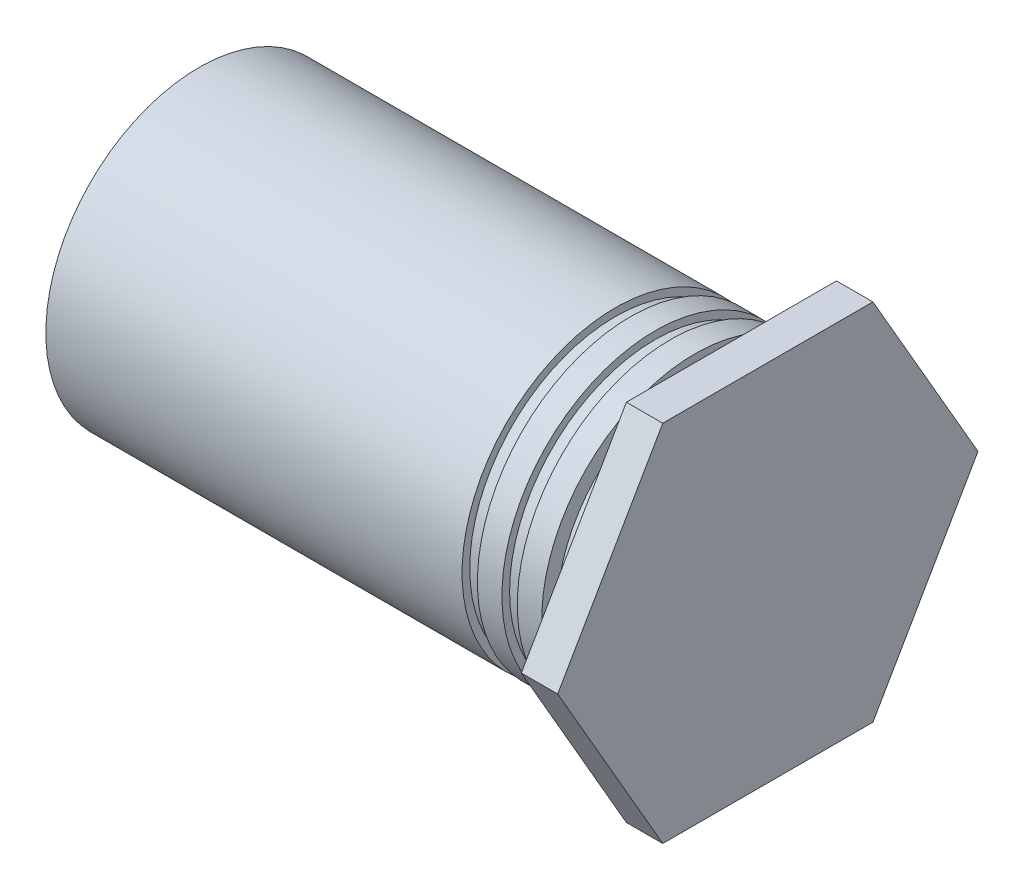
ISO-10303-21;
HEADER;
FILE_DESCRIPTION(('STEP AP214'),'2;1');
FILE_NAME('part.step','',(''),(''),'','','');
FILE_SCHEMA(('AUTOMOTIVE_DESIGN { 1 0 10303 214 1 1 1 1 }'));
ENDSEC;
DATA;
#1=APPLICATION_CONTEXT('core data for automotive mechanical design processes');
#2=APPLICATION_PROTOCOL_DEFINITION('international standard','automotive_design',2000,#1);
#3=PRODUCT_CONTEXT('',#1,'mechanical');
#4=PRODUCT('Part','Part','',(#3));
#5=PRODUCT_RELATED_PRODUCT_CATEGORY('part','',(#4));
#6=PRODUCT_DEFINITION_FORMATION('','',#4);
#7=PRODUCT_DEFINITION_CONTEXT('part definition',#1,'design');
#8=PRODUCT_DEFINITION('design','',#6,#7);
#9=PRODUCT_DEFINITION_SHAPE('','',#8);
#10=(LENGTH_UNIT() NAMED_UNIT(*) SI_UNIT(.MILLI.,.METRE.));
#11=(NAMED_UNIT(*) PLANE_ANGLE_UNIT() SI_UNIT($,.RADIAN.));
#12=(NAMED_UNIT(*) SI_UNIT($,.STERADIAN.) SOLID_ANGLE_UNIT());
#13=UNCERTAINTY_MEASURE_WITH_UNIT(LENGTH_MEASURE(1.E-05),#10,'distance_accuracy_value','');
#14=(GEOMETRIC_REPRESENTATION_CONTEXT(3) GLOBAL_UNCERTAINTY_ASSIGNED_CONTEXT((#13)) GLOBAL_UNIT_ASSIGNED_CONTEXT((#10,
#11,#12)) REPRESENTATION_CONTEXT('',''));
#15=CARTESIAN_POINT('',(0.,0.,0.));
#16=DIRECTION('',(0.,0.,1.));
#17=DIRECTION('',(1.,0.,0.));
#18=AXIS2_PLACEMENT_3D('',#15,#16,#17);
#19=CARTESIAN_POINT('',(0.640000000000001,0.,0.));
#20=DIRECTION('',(1.,0.,0.));
#21=DIRECTION('',(0.,1.,0.));
#22=AXIS2_PLACEMENT_3D('',#19,#20,#21);
#23=PLANE('',#22);
#24=DIRECTION('',(0.,0.866025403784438,-0.5));
#25=VECTOR('',#24,1.);
#26=CARTESIAN_POINT('',(0.64,-1.60000000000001,-2.7712812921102));
#27=LINE('',#26,#25);
#28=CARTESIAN_POINT('',(0.640000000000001,0.,-3.69504172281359));
#29=VERTEX_POINT('',#28);
#30=CARTESIAN_POINT('',(0.64,-3.19999999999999,-1.8475208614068));
#31=VERTEX_POINT('',#30);
#32=EDGE_CURVE('E998',#29,#31,#27,.F.);
#33=ORIENTED_EDGE('',*,*,#32,.F.);
#34=DIRECTION('',(0.,0.866025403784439,0.5));
#35=VECTOR('',#34,1.);
#36=CARTESIAN_POINT('',(0.640000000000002,1.59999999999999,-2.77128129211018));
#37=LINE('',#36,#35);
#38=CARTESIAN_POINT('',(0.640000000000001,3.2,-1.84752086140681));
#39=VERTEX_POINT('',#38);
#40=EDGE_CURVE('E990',#39,#29,#37,.F.);
#41=ORIENTED_EDGE('',*,*,#40,.F.);
#42=DIRECTION('',(0.,0.,1.));
#43=VECTOR('',#42,1.);
#44=CARTESIAN_POINT('',(0.640000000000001,3.2,0.));
#45=LINE('',#44,#43);
#46=CARTESIAN_POINT('',(0.640000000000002,3.2,1.8475208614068));
#47=VERTEX_POINT('',#46);
#48=EDGE_CURVE('E982',#47,#39,#45,.F.);
#49=ORIENTED_EDGE('',*,*,#48,.F.);
#50=DIRECTION('',(0.,-0.866025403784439,0.5));
#51=VECTOR('',#50,1.);
#52=CARTESIAN_POINT('',(0.640000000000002,1.6,2.7712812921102));
#53=LINE('',#52,#51);
#54=CARTESIAN_POINT('',(0.640000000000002,0.,3.6950417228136));
#55=VERTEX_POINT('',#54);
#56=EDGE_CURVE('E974',#55,#47,#53,.F.);
#57=ORIENTED_EDGE('',*,*,#56,.F.);
#58=DIRECTION('',(0.,-0.866025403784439,-0.5));
#59=VECTOR('',#58,1.);
#60=CARTESIAN_POINT('',(0.640000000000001,-1.6,2.7712812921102));
#61=LINE('',#60,#59);
#62=CARTESIAN_POINT('',(0.640000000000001,-3.2,1.8475208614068));
#63=VERTEX_POINT('',#62);
#64=EDGE_CURVE('E1010',#63,#55,#61,.F.);
#65=ORIENTED_EDGE('',*,*,#64,.F.);
#66=DIRECTION('',(0.,0.,-1.));
#67=VECTOR('',#66,1.);
#68=CARTESIAN_POINT('',(0.64,-3.19999999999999,0.));
#69=LINE('',#68,#67);
#70=EDGE_CURVE('E1006',#31,#63,#69,.F.);
#71=ORIENTED_EDGE('',*,*,#70,.F.);
#72=EDGE_LOOP('',(#33,#41,#49,#57,#65,#71));
#73=FACE_BOUND('',#72,.T.);
#74=ADVANCED_FACE('F18',(#73),#23,.T.);
#75=CARTESIAN_POINT('',(0.,-1.6,2.7712812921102));
#76=DIRECTION('',(0.,-0.5,0.866025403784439));
#77=DIRECTION('',(0.,-0.866025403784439,-0.5));
#78=AXIS2_PLACEMENT_3D('',#75,#76,#77);
#79=PLANE('',#78);
#80=DIRECTION('',(0.,-0.866025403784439,-0.5));
#81=VECTOR('',#80,1.);
#82=CARTESIAN_POINT('',(0.,0.,3.6950417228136));
#83=LINE('',#82,#81);
#84=CARTESIAN_POINT('',(0.,0.,3.6950417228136));
#85=VERTEX_POINT('',#84);
#86=CARTESIAN_POINT('',(0.,-3.2,1.8475208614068));
#87=VERTEX_POINT('',#86);
#88=EDGE_CURVE('E963',#85,#87,#83,.T.);
#89=ORIENTED_EDGE('',*,*,#88,.T.);
#90=DIRECTION('',(1.,0.,0.));
#91=VECTOR('',#90,1.);
#92=CARTESIAN_POINT('',(0.,-3.2,1.8475208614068));
#93=LINE('',#92,#91);
#94=EDGE_CURVE('E1002',#63,#87,#93,.F.);
#95=ORIENTED_EDGE('',*,*,#94,.F.);
#96=ORIENTED_EDGE('',*,*,#64,.T.);
#97=DIRECTION('',(1.,0.,0.));
#98=VECTOR('',#97,1.);
#99=CARTESIAN_POINT('',(0.,0.,3.6950417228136));
#100=LINE('',#99,#98);
#101=EDGE_CURVE('E966',#85,#55,#100,.T.);
#102=ORIENTED_EDGE('',*,*,#101,.F.);
#103=EDGE_LOOP('',(#89,#95,#96,#102));
#104=FACE_BOUND('',#103,.T.);
#105=ADVANCED_FACE('F4106',(#104),#79,.T.);
#106=CARTESIAN_POINT('',(0.,-3.19999999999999,0.));
#107=DIRECTION('',(0.,-1.,0.));
#108=DIRECTION('',(0.,0.,-1.));
#109=AXIS2_PLACEMENT_3D('',#106,#107,#108);
#110=PLANE('',#109);
#111=DIRECTION('',(0.,0.,1.));
#112=VECTOR('',#111,1.);
#113=CARTESIAN_POINT('',(0.,-3.19999999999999,0.));
#114=LINE('',#113,#112);
#115=CARTESIAN_POINT('',(0.,-3.19999999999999,-1.8475208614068));
#116=VERTEX_POINT('',#115);
#117=EDGE_CURVE('E960',#87,#116,#114,.F.);
#118=ORIENTED_EDGE('',*,*,#117,.T.);
#119=DIRECTION('',(1.,0.,0.));
#120=VECTOR('',#119,1.);
#121=CARTESIAN_POINT('',(0.,-3.19999999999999,-1.84752086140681));
#122=LINE('',#121,#120);
#123=EDGE_CURVE('E994',#31,#116,#122,.F.);
#124=ORIENTED_EDGE('',*,*,#123,.F.);
#125=ORIENTED_EDGE('',*,*,#70,.T.);
#126=ORIENTED_EDGE('',*,*,#94,.T.);
#127=EDGE_LOOP('',(#118,#124,#125,#126));
#128=FACE_BOUND('',#127,.T.);
#129=ADVANCED_FACE('F4096',(#128),#110,.T.);
#130=CARTESIAN_POINT('',(0.,-1.60000000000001,-2.7712812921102));
#131=DIRECTION('',(0.,-0.500000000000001,-0.866025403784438));
#132=DIRECTION('',(0.,0.866025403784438,-0.5));
#133=AXIS2_PLACEMENT_3D('',#130,#131,#132);
#134=PLANE('',#133);
#135=DIRECTION('',(0.,0.866025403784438,-0.500000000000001));
#136=VECTOR('',#135,1.);
#137=CARTESIAN_POINT('',(0.,-3.19999999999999,-1.8475208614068));
#138=LINE('',#137,#136);
#139=CARTESIAN_POINT('',(0.,0.,-3.69504172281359));
#140=VERTEX_POINT('',#139);
#141=EDGE_CURVE('E957',#116,#140,#138,.T.);
#142=ORIENTED_EDGE('',*,*,#141,.T.);
#143=DIRECTION('',(1.,0.,0.));
#144=VECTOR('',#143,1.);
#145=CARTESIAN_POINT('',(0.,0.,-3.69504172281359));
#146=LINE('',#145,#144);
#147=EDGE_CURVE('E986',#29,#140,#146,.F.);
#148=ORIENTED_EDGE('',*,*,#147,.F.);
#149=ORIENTED_EDGE('',*,*,#32,.T.);
#150=ORIENTED_EDGE('',*,*,#123,.T.);
#151=EDGE_LOOP('',(#142,#148,#149,#150));
#152=FACE_BOUND('',#151,.T.);
#153=ADVANCED_FACE('F4086',(#152),#134,.T.);
#154=CARTESIAN_POINT('',(0.,1.59999999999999,-2.77128129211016));
#155=DIRECTION('',(0.,0.5,-0.866025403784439));
#156=DIRECTION('',(0.,0.866025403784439,0.5));
#157=AXIS2_PLACEMENT_3D('',#154,#155,#156);
#158=PLANE('',#157);
#159=DIRECTION('',(0.,0.866025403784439,0.5));
#160=VECTOR('',#159,1.);
#161=CARTESIAN_POINT('',(0.,0.,-3.69504172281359));
#162=LINE('',#161,#160);
#163=CARTESIAN_POINT('',(0.,3.2,-1.84752086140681));
#164=VERTEX_POINT('',#163);
#165=EDGE_CURVE('E954',#140,#164,#162,.T.);
#166=ORIENTED_EDGE('',*,*,#165,.T.);
#167=DIRECTION('',(1.,0.,0.));
#168=VECTOR('',#167,1.);
#169=CARTESIAN_POINT('',(0.,3.2,-1.84752086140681));
#170=LINE('',#169,#168);
#171=EDGE_CURVE('E978',#39,#164,#170,.F.);
#172=ORIENTED_EDGE('',*,*,#171,.F.);
#173=ORIENTED_EDGE('',*,*,#40,.T.);
#174=ORIENTED_EDGE('',*,*,#147,.T.);
#175=EDGE_LOOP('',(#166,#172,#173,#174));
#176=FACE_BOUND('',#175,.T.);
#177=ADVANCED_FACE('F4076',(#176),#158,.T.);
#178=CARTESIAN_POINT('',(0.,3.2,0.));
#179=DIRECTION('',(0.,1.,0.));
#180=DIRECTION('',(0.,0.,1.));
#181=AXIS2_PLACEMENT_3D('',#178,#179,#180);
#182=PLANE('',#181);
#183=DIRECTION('',(0.,0.,1.));
#184=VECTOR('',#183,1.);
#185=CARTESIAN_POINT('',(0.,3.2,0.));
#186=LINE('',#185,#184);
#187=CARTESIAN_POINT('',(0.,3.2,1.8475208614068));
#188=VERTEX_POINT('',#187);
#189=EDGE_CURVE('E951',#164,#188,#186,.T.);
#190=ORIENTED_EDGE('',*,*,#189,.T.);
#191=DIRECTION('',(1.,0.,0.));
#192=VECTOR('',#191,1.);
#193=CARTESIAN_POINT('',(0.,3.2,1.8475208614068));
#194=LINE('',#193,#192);
#195=EDGE_CURVE('E970',#47,#188,#194,.F.);
#196=ORIENTED_EDGE('',*,*,#195,.F.);
#197=ORIENTED_EDGE('',*,*,#48,.T.);
#198=ORIENTED_EDGE('',*,*,#171,.T.);
#199=EDGE_LOOP('',(#190,#196,#197,#198));
#200=FACE_BOUND('',#199,.T.);
#201=ADVANCED_FACE('F4066',(#200),#182,.T.);
#202=CARTESIAN_POINT('',(0.,1.6,2.7712812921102));
#203=DIRECTION('',(0.,0.5,0.866025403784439));
#204=DIRECTION('',(0.,-0.866025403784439,0.5));
#205=AXIS2_PLACEMENT_3D('',#202,#203,#204);
#206=PLANE('',#205);
#207=DIRECTION('',(0.,-0.866025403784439,0.499999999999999));
#208=VECTOR('',#207,1.);
#209=CARTESIAN_POINT('',(0.,3.2,1.8475208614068));
#210=LINE('',#209,#208);
#211=EDGE_CURVE('E946',#188,#85,#210,.T.);
#212=ORIENTED_EDGE('',*,*,#211,.T.);
#213=ORIENTED_EDGE('',*,*,#101,.T.);
#214=ORIENTED_EDGE('',*,*,#56,.T.);
#215=ORIENTED_EDGE('',*,*,#195,.T.);
#216=EDGE_LOOP('',(#212,#213,#214,#215));
#217=FACE_BOUND('',#216,.T.);
#218=ADVANCED_FACE('F4056',(#217),#206,.T.);
#219=CARTESIAN_POINT('',(0.,0.,0.));
#220=DIRECTION('',(1.,0.,0.));
#221=DIRECTION('',(0.,1.,0.));
#222=AXIS2_PLACEMENT_3D('',#219,#220,#221);
#223=PLANE('',#222);
#224=CARTESIAN_POINT('',(0.,0.,0.));
#225=DIRECTION('',(1.,0.,0.));
#226=DIRECTION('',(0.,0.,-1.));
#227=AXIS2_PLACEMENT_3D('',#224,#225,#226);
#228=CIRCLE('',#227,2.4255);
#229=CARTESIAN_POINT('',(0.,0.,-2.4255));
#230=VERTEX_POINT('',#229);
#231=EDGE_CURVE('E950',#230,#230,#228,.F.);
#232=ORIENTED_EDGE('',*,*,#231,.F.);
#233=EDGE_LOOP('',(#232));
#234=FACE_BOUND('',#233,.T.);
#235=ORIENTED_EDGE('',*,*,#189,.F.);
#236=ORIENTED_EDGE('',*,*,#165,.F.);
#237=ORIENTED_EDGE('',*,*,#141,.F.);
#238=ORIENTED_EDGE('',*,*,#117,.F.);
#239=ORIENTED_EDGE('',*,*,#88,.F.);
#240=ORIENTED_EDGE('',*,*,#211,.F.);
#241=EDGE_LOOP('',(#235,#236,#237,#238,#239,#240));
#242=FACE_BOUND('',#241,.T.);
#243=ADVANCED_FACE('F4046',(#234,#242),#223,.F.);
#244=CARTESIAN_POINT('',(-0.320000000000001,0.,0.));
#245=DIRECTION('',(1.,0.,0.));
#246=DIRECTION('',(0.,0.,-1.));
#247=AXIS2_PLACEMENT_3D('',#244,#245,#246);
#248=CYLINDRICAL_SURFACE('',#247,2.4255);
#249=CARTESIAN_POINT('',(-0.640000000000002,0.,0.));
#250=DIRECTION('',(1.,0.,0.));
#251=DIRECTION('',(0.,0.,-1.));
#252=AXIS2_PLACEMENT_3D('',#249,#250,#251);
#253=CIRCLE('',#252,2.4255);
#254=CARTESIAN_POINT('',(-0.640000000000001,0.,-2.4255));
#255=VERTEX_POINT('',#254);
#256=EDGE_CURVE('E1058',#255,#255,#253,.F.);
#257=ORIENTED_EDGE('',*,*,#256,.F.);
#258=EDGE_LOOP('',(#257));
#259=FACE_BOUND('',#258,.T.);
#260=ORIENTED_EDGE('',*,*,#231,.T.);
#261=EDGE_LOOP('',(#260));
#262=FACE_BOUND('',#261,.T.);
#263=ADVANCED_FACE('F4036',(#259,#262),#248,.T.);
#264=CARTESIAN_POINT('',(-0.640000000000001,0.,1.3475));
#265=DIRECTION('',(1.,0.,0.));
#266=DIRECTION('',(0.,0.,-1.));
#267=AXIS2_PLACEMENT_3D('',#264,#265,#266);
#268=PLANE('',#267);
#269=CARTESIAN_POINT('',(-0.640000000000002,0.,0.));
#270=DIRECTION('',(1.,0.,0.));
#271=DIRECTION('',(0.,0.,-1.));
#272=AXIS2_PLACEMENT_3D('',#269,#270,#271);
#273=CIRCLE('',#272,2.695);
#274=CARTESIAN_POINT('',(-0.640000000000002,0.,-2.695));
#275=VERTEX_POINT('',#274);
#276=EDGE_CURVE('E1054',#275,#275,#273,.F.);
#277=ORIENTED_EDGE('',*,*,#276,.F.);
#278=EDGE_LOOP('',(#277));
#279=FACE_BOUND('',#278,.T.);
#280=ORIENTED_EDGE('',*,*,#256,.T.);
#281=EDGE_LOOP('',(#280));
#282=FACE_BOUND('',#281,.T.);
#283=ADVANCED_FACE('F4026',(#279,#282),#268,.T.);
#284=CARTESIAN_POINT('',(-5.00000000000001,0.,0.));
#285=DIRECTION('',(1.,0.,0.));
#286=DIRECTION('',(0.,0.,-1.));
#287=AXIS2_PLACEMENT_3D('',#284,#285,#286);
#288=CYLINDRICAL_SURFACE('',#287,2.695);
#289=CARTESIAN_POINT('',(-1.0712,0.,0.));
#290=DIRECTION('',(1.,0.,0.));
#291=DIRECTION('',(0.,0.,-1.));
#292=AXIS2_PLACEMENT_3D('',#289,#290,#291);
#293=CIRCLE('',#292,2.695);
#294=CARTESIAN_POINT('',(-1.0712,0.,-2.69499999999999));
#295=VERTEX_POINT('',#294);
#296=EDGE_CURVE('E1050',#295,#295,#293,.T.);
#297=ORIENTED_EDGE('',*,*,#296,.T.);
#298=EDGE_LOOP('',(#297));
#299=FACE_BOUND('',#298,.T.);
#300=ORIENTED_EDGE('',*,*,#276,.T.);
#301=EDGE_LOOP('',(#300));
#302=FACE_BOUND('',#301,.T.);
#303=ADVANCED_FACE('F4016',(#299,#302),#288,.T.);
#304=CARTESIAN_POINT('',(-1.0712,0.,2.627625));
#305=DIRECTION('',(1.,0.,0.));
#306=DIRECTION('',(0.,0.,-1.));
#307=AXIS2_PLACEMENT_3D('',#304,#305,#306);
#308=PLANE('',#307);
#309=ORIENTED_EDGE('',*,*,#296,.F.);
#310=EDGE_LOOP('',(#309));
#311=FACE_BOUND('',#310,.T.);
#312=CARTESIAN_POINT('',(-1.0712,0.,0.));
#313=DIRECTION('',(1.,0.,0.));
#314=DIRECTION('',(0.,0.,-1.));
#315=AXIS2_PLACEMENT_3D('',#312,#313,#314);
#316=CIRCLE('',#315,2.56025);
#317=CARTESIAN_POINT('',(-1.0712,0.,-2.56024999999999));
#318=VERTEX_POINT('',#317);
#319=EDGE_CURVE('E1046',#318,#318,#316,.F.);
#320=ORIENTED_EDGE('',*,*,#319,.F.);
#321=EDGE_LOOP('',(#320));
#322=FACE_BOUND('',#321,.T.);
#323=ADVANCED_FACE('F4006',(#311,#322),#308,.F.);
#324=CARTESIAN_POINT('',(-1.20595,0.,0.));
#325=DIRECTION('',(1.,0.,0.));
#326=DIRECTION('',(0.,0.,-1.));
#327=AXIS2_PLACEMENT_3D('',#324,#325,#326);
#328=CYLINDRICAL_SURFACE('',#327,2.56025);
#329=CARTESIAN_POINT('',(-1.3407,0.,0.));
#330=DIRECTION('',(1.,0.,0.));
#331=DIRECTION('',(0.,0.,-1.));
#332=AXIS2_PLACEMENT_3D('',#329,#330,#331);
#333=CIRCLE('',#332,2.56025);
#334=CARTESIAN_POINT('',(-1.3407,0.,-2.56025));
#335=VERTEX_POINT('',#334);
#336=EDGE_CURVE('E945',#335,#335,#333,.T.);
#337=ORIENTED_EDGE('',*,*,#336,.T.);
#338=EDGE_LOOP('',(#337));
#339=FACE_BOUND('',#338,.T.);
#340=ORIENTED_EDGE('',*,*,#319,.T.);
#341=EDGE_LOOP('',(#340));
#342=FACE_BOUND('',#341,.T.);
#343=ADVANCED_FACE('F3996',(#339,#342),#328,.T.);
#344=CARTESIAN_POINT('',(-3.11999999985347,0.,0.));
#345=DIRECTION('',(-1.,0.,0.));
#346=DIRECTION('',(0.,0.,1.));
#347=AXIS2_PLACEMENT_3D('',#344,#345,#346);
#348=CONICAL_SURFACE('',#347,0.973999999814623,1.04719755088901);
#349=CARTESIAN_POINT('',(-3.12,0.,0.));
#350=DIRECTION('',(-1.,0.,0.));
#351=DIRECTION('',(0.,0.,1.));
#352=AXIS2_PLACEMENT_3D('',#349,#350,#351);
#353=CIRCLE('',#352,0.974);
#354=CARTESIAN_POINT('',(-3.12,0.,0.974000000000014));
#355=VERTEX_POINT('',#354);
#356=EDGE_CURVE('E940',#355,#355,#353,.T.);
#357=ORIENTED_EDGE('',*,*,#356,.T.);
#358=EDGE_LOOP('',(#357));
#359=FACE_BOUND('',#358,.T.);
#360=CARTESIAN_POINT('',(-2.55766083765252,0.,-2.55795384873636E-10));
#361=VERTEX_POINT('',#360);
#362=VERTEX_LOOP('',#361);
#363=FACE_BOUND('',#362,.T.);
#364=ADVANCED_FACE('F3986',(#359,#363),#348,.F.);
#365=CARTESIAN_POINT('',(-1.3407,0.,2.627625));
#366=DIRECTION('',(-1.,0.,0.));
#367=DIRECTION('',(0.,0.,1.));
#368=AXIS2_PLACEMENT_3D('',#365,#366,#367);
#369=PLANE('',#368);
#370=ORIENTED_EDGE('',*,*,#336,.F.);
#371=EDGE_LOOP('',(#370));
#372=FACE_BOUND('',#371,.T.);
#373=CARTESIAN_POINT('',(-1.3407,0.,0.));
#374=DIRECTION('',(1.,0.,0.));
#375=DIRECTION('',(0.,0.,-1.));
#376=AXIS2_PLACEMENT_3D('',#373,#374,#375);
#377=CIRCLE('',#376,2.695);
#378=CARTESIAN_POINT('',(-1.3407,0.,-2.695));
#379=VERTEX_POINT('',#378);
#380=EDGE_CURVE('E944',#379,#379,#377,.F.);
#381=ORIENTED_EDGE('',*,*,#380,.F.);
#382=EDGE_LOOP('',(#381));
#383=FACE_BOUND('',#382,.T.);
#384=ADVANCED_FACE('F3976',(#372,#383),#369,.F.);
#385=CARTESIAN_POINT('',(-3.64,0.,0.));
#386=DIRECTION('',(-1.,0.,0.));
#387=DIRECTION('',(0.,0.,1.));
#388=AXIS2_PLACEMENT_3D('',#385,#386,#387);
#389=CYLINDRICAL_SURFACE('',#388,0.974);
#390=ORIENTED_EDGE('',*,*,#356,.F.);
#391=EDGE_LOOP('',(#390));
#392=FACE_BOUND('',#391,.T.);
#393=CARTESIAN_POINT('',(-4.16000000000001,0.,0.));
#394=DIRECTION('',(-1.,0.,0.));
#395=DIRECTION('',(0.,0.,1.));
#396=AXIS2_PLACEMENT_3D('',#393,#394,#395);
#397=CIRCLE('',#396,0.974);
#398=CARTESIAN_POINT('',(-4.16000000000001,0.,0.974));
#399=VERTEX_POINT('',#398);
#400=EDGE_CURVE('E1036',#399,#399,#397,.T.);
#401=ORIENTED_EDGE('',*,*,#400,.T.);
#402=EDGE_LOOP('',(#401));
#403=FACE_BOUND('',#402,.T.);
#404=ADVANCED_FACE('F3966',(#392,#403),#389,.F.);
#405=CARTESIAN_POINT('',(-5.00000000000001,0.,0.));
#406=DIRECTION('',(1.,0.,0.));
#407=DIRECTION('',(0.,0.,-1.));
#408=AXIS2_PLACEMENT_3D('',#405,#406,#407);
#409=CYLINDRICAL_SURFACE('',#408,2.695);
#410=CARTESIAN_POINT('',(-1.7719,0.,0.));
#411=DIRECTION('',(1.,0.,0.));
#412=DIRECTION('',(0.,0.,-1.));
#413=AXIS2_PLACEMENT_3D('',#410,#411,#412);
#414=CIRCLE('',#413,2.695);
#415=CARTESIAN_POINT('',(-1.7719,0.,-2.69499999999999));
#416=VERTEX_POINT('',#415);
#417=EDGE_CURVE('E1032',#416,#416,#414,.T.);
#418=ORIENTED_EDGE('',*,*,#417,.T.);
#419=EDGE_LOOP('',(#418));
#420=FACE_BOUND('',#419,.T.);
#421=ORIENTED_EDGE('',*,*,#380,.T.);
#422=EDGE_LOOP('',(#421));
#423=FACE_BOUND('',#422,.T.);
#424=ADVANCED_FACE('F3956',(#420,#423),#409,.T.);
#425=CARTESIAN_POINT('',(-4.16000000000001,0.,-0.625000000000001));
#426=DIRECTION('',(1.,0.,0.));
#427=DIRECTION('',(0.,0.,-1.));
#428=AXIS2_PLACEMENT_3D('',#425,#426,#427);
#429=PLANE('',#428);
#430=ORIENTED_EDGE('',*,*,#400,.F.);
#431=EDGE_LOOP('',(#430));
#432=FACE_BOUND('',#431,.T.);
#433=CARTESIAN_POINT('',(-4.16000000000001,0.,0.));
#434=DIRECTION('',(1.,0.,0.));
#435=DIRECTION('',(0.,0.,-1.));
#436=AXIS2_PLACEMENT_3D('',#433,#434,#435);
#437=CIRCLE('',#436,1.0065);
#438=CARTESIAN_POINT('',(-4.16000000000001,0.,-1.0065));
#439=VERTEX_POINT('',#438);
#440=EDGE_CURVE('E1028',#439,#439,#437,.F.);
#441=ORIENTED_EDGE('',*,*,#440,.T.);
#442=EDGE_LOOP('',(#441));
#443=FACE_BOUND('',#442,.T.);
#444=ADVANCED_FACE('F3946',(#432,#443),#429,.F.);
#445=CARTESIAN_POINT('',(-1.7719,0.,2.62762500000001));
#446=DIRECTION('',(1.,0.,0.));
#447=DIRECTION('',(0.,0.,-1.));
#448=AXIS2_PLACEMENT_3D('',#445,#446,#447);
#449=PLANE('',#448);
#450=ORIENTED_EDGE('',*,*,#417,.F.);
#451=EDGE_LOOP('',(#450));
#452=FACE_BOUND('',#451,.T.);
#453=CARTESIAN_POINT('',(-1.7719,0.,0.));
#454=DIRECTION('',(1.,0.,0.));
#455=DIRECTION('',(0.,0.,-1.));
#456=AXIS2_PLACEMENT_3D('',#453,#454,#455);
#457=CIRCLE('',#456,2.56025);
#458=CARTESIAN_POINT('',(-1.7719,0.,-2.56024999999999));
#459=VERTEX_POINT('',#458);
#460=EDGE_CURVE('E939',#459,#459,#457,.F.);
#461=ORIENTED_EDGE('',*,*,#460,.F.);
#462=EDGE_LOOP('',(#461));
#463=FACE_BOUND('',#462,.T.);
#464=ADVANCED_FACE('F3936',(#452,#463),#449,.F.);
#465=CARTESIAN_POINT('',(-6.63825000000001,0.,0.));
#466=DIRECTION('',(1.,0.,0.));
#467=DIRECTION('',(0.,0.,-1.));
#468=AXIS2_PLACEMENT_3D('',#465,#466,#467);
#469=CYLINDRICAL_SURFACE('',#468,1.0065);
#470=ORIENTED_EDGE('',*,*,#440,.F.);
#471=EDGE_LOOP('',(#470));
#472=FACE_BOUND('',#471,.T.);
#473=CARTESIAN_POINT('',(-9.11650000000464,0.,0.));
#474=DIRECTION('',(-1.,0.,0.));
#475=DIRECTION('',(0.,0.,1.));
#476=AXIS2_PLACEMENT_3D('',#473,#474,#475);
#477=CIRCLE('',#476,1.00650000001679);
#478=CARTESIAN_POINT('',(-9.11650000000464,0.,1.0065000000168));
#479=VERTEX_POINT('',#478);
#480=EDGE_CURVE('E929',#479,#479,#477,.T.);
#481=ORIENTED_EDGE('',*,*,#480,.T.);
#482=EDGE_LOOP('',(#481));
#483=FACE_BOUND('',#482,.T.);
#484=ADVANCED_FACE('F3926',(#472,#483),#469,.F.);
#485=CARTESIAN_POINT('',(-1.90665,0.,0.));
#486=DIRECTION('',(1.,0.,0.));
#487=DIRECTION('',(0.,0.,-1.));
#488=AXIS2_PLACEMENT_3D('',#485,#486,#487);
#489=CYLINDRICAL_SURFACE('',#488,2.56025);
#490=CARTESIAN_POINT('',(-2.0414,0.,0.));
#491=DIRECTION('',(1.,0.,0.));
#492=DIRECTION('',(0.,0.,-1.));
#493=AXIS2_PLACEMENT_3D('',#490,#491,#492);
#494=CIRCLE('',#493,2.56025);
#495=CARTESIAN_POINT('',(-2.0414,0.,-2.56025));
#496=VERTEX_POINT('',#495);
#497=EDGE_CURVE('E938',#496,#496,#494,.T.);
#498=ORIENTED_EDGE('',*,*,#497,.T.);
#499=EDGE_LOOP('',(#498));
#500=FACE_BOUND('',#499,.T.);
#501=ORIENTED_EDGE('',*,*,#460,.T.);
#502=EDGE_LOOP('',(#501));
#503=FACE_BOUND('',#502,.T.);
#504=ADVANCED_FACE('F3916',(#500,#503),#489,.T.);
#505=CARTESIAN_POINT('',(-9.36000000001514,0.,0.));
#506=DIRECTION('',(-1.,0.,0.));
#507=DIRECTION('',(0.,0.,1.));
#508=AXIS2_PLACEMENT_3D('',#505,#506,#507);
#509=CONICAL_SURFACE('',#508,1.25000000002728,0.785398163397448);
#510=ORIENTED_EDGE('',*,*,#480,.F.);
#511=EDGE_LOOP('',(#510));
#512=FACE_BOUND('',#511,.T.);
#513=CARTESIAN_POINT('',(-9.36000000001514,0.,0.));
#514=DIRECTION('',(-1.,0.,0.));
#515=DIRECTION('',(0.,0.,1.));
#516=AXIS2_PLACEMENT_3D('',#513,#514,#515);
#517=CIRCLE('',#516,1.25000000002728);
#518=CARTESIAN_POINT('',(-9.36000000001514,0.,1.25000000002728));
#519=VERTEX_POINT('',#518);
#520=EDGE_CURVE('E1018',#519,#519,#517,.F.);
#521=ORIENTED_EDGE('',*,*,#520,.F.);
#522=EDGE_LOOP('',(#521));
#523=FACE_BOUND('',#522,.T.);
#524=ADVANCED_FACE('F3906',(#512,#523),#509,.F.);
#525=CARTESIAN_POINT('',(-2.0414,0.,2.627625));
#526=DIRECTION('',(-1.,0.,0.));
#527=DIRECTION('',(0.,0.,1.));
#528=AXIS2_PLACEMENT_3D('',#525,#526,#527);
#529=PLANE('',#528);
#530=ORIENTED_EDGE('',*,*,#497,.F.);
#531=EDGE_LOOP('',(#530));
#532=FACE_BOUND('',#531,.T.);
#533=CARTESIAN_POINT('',(-2.0414,0.,0.));
#534=DIRECTION('',(1.,0.,0.));
#535=DIRECTION('',(0.,0.,-1.));
#536=AXIS2_PLACEMENT_3D('',#533,#534,#535);
#537=CIRCLE('',#536,2.695);
#538=CARTESIAN_POINT('',(-2.0414,0.,-2.695));
#539=VERTEX_POINT('',#538);
#540=EDGE_CURVE('E30',#539,#539,#537,.F.);
#541=ORIENTED_EDGE('',*,*,#540,.F.);
#542=EDGE_LOOP('',(#541));
#543=FACE_BOUND('',#542,.T.);
#544=ADVANCED_FACE('F3897',(#532,#543),#529,.F.);
#545=CARTESIAN_POINT('',(-9.36000000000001,0.,1.3475));
#546=DIRECTION('',(-1.,0.,0.));
#547=DIRECTION('',(0.,0.,1.));
#548=AXIS2_PLACEMENT_3D('',#545,#546,#547);
#549=PLANE('',#548);
#550=CARTESIAN_POINT('',(-9.36000000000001,0.,0.));
#551=DIRECTION('',(1.,0.,0.));
#552=DIRECTION('',(0.,0.,-1.));
#553=AXIS2_PLACEMENT_3D('',#550,#551,#552);
#554=CIRCLE('',#553,2.695);
#555=CARTESIAN_POINT('',(-9.36000000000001,0.,-2.695));
#556=VERTEX_POINT('',#555);
#557=EDGE_CURVE('E11',#556,#556,#554,.T.);
#558=ORIENTED_EDGE('',*,*,#557,.F.);
#559=EDGE_LOOP('',(#558));
#560=FACE_BOUND('',#559,.T.);
#561=ORIENTED_EDGE('',*,*,#520,.T.);
#562=EDGE_LOOP('',(#561));
#563=FACE_BOUND('',#562,.T.);
#564=ADVANCED_FACE('F3888',(#560,#563),#549,.T.);
#565=CARTESIAN_POINT('',(-5.00000000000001,0.,0.));
#566=DIRECTION('',(1.,0.,0.));
#567=DIRECTION('',(0.,0.,-1.));
#568=AXIS2_PLACEMENT_3D('',#565,#566,#567);
#569=CYLINDRICAL_SURFACE('',#568,2.695);
#570=ORIENTED_EDGE('',*,*,#540,.T.);
#571=EDGE_LOOP('',(#570));
#572=FACE_BOUND('',#571,.T.);
#573=ORIENTED_EDGE('',*,*,#557,.T.);
#574=EDGE_LOOP('',(#573));
#575=FACE_BOUND('',#574,.T.);
#576=ADVANCED_FACE('F387',(#572,#575),#569,.T.);
#577=CLOSED_SHELL('',(#74,#105,#129,#153,#177,#201,#218,#243,#263,#283,#303,#323,#343,#364,#384,
#404,#424,#444,#464,#484,#504,#524,#544,#564,#576));
#578=CARTESIAN_POINT('',(0.320000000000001,0.768504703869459,2.9326462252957));
#579=DIRECTION('',(1.,0.,0.));
#580=DIRECTION('',(0.,1.,0.));
#581=AXIS2_PLACEMENT_3D('',#578,#579,#580);
#582=PLANE('',#581);
#583=CARTESIAN_POINT('',(0.320000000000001,0.742865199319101,2.96852143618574));
#584=CARTESIAN_POINT('',(0.320000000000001,0.742096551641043,2.96836479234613));
#585=CARTESIAN_POINT('',(0.320000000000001,0.741327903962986,2.96820814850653));
#586=B_SPLINE_CURVE_WITH_KNOTS('',2,(#583,#584,#585),.UNSPECIFIED.,.F.,.F.,(3,3),(0.,1.),.UNSPECIFIED.);
#587=CARTESIAN_POINT('',(0.320000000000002,0.742865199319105,2.96852143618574));
#588=VERTEX_POINT('',#587);
#589=CARTESIAN_POINT('',(0.320000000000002,0.741327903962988,2.96820814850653));
#590=VERTEX_POINT('',#589);
#591=EDGE_CURVE('E392',#588,#590,#586,.T.);
#592=ORIENTED_EDGE('',*,*,#591,.T.);
#593=DIRECTION('',(0.,0.,1.));
#594=VECTOR('',#593,1.);
#595=CARTESIAN_POINT('',(0.320000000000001,0.741327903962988,2.93476651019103));
#596=LINE('',#595,#594);
#597=CARTESIAN_POINT('',(0.320000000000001,0.741327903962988,2.90132487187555));
#598=VERTEX_POINT('',#597);
#599=EDGE_CURVE('E669',#590,#598,#596,.F.);
#600=ORIENTED_EDGE('',*,*,#599,.T.);
#601=DIRECTION('',(0.,1.,0.));
#602=VECTOR('',#601,1.);
#603=CARTESIAN_POINT('',(0.320000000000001,0.749134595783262,2.90132487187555));
#604=LINE('',#603,#602);
#605=CARTESIAN_POINT('',(0.320000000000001,0.756941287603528,2.90132487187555));
#606=VERTEX_POINT('',#605);
#607=EDGE_CURVE('E567',#598,#606,#604,.T.);
#608=ORIENTED_EDGE('',*,*,#607,.T.);
#609=DIRECTION('',(0.,0.,1.));
#610=VECTOR('',#609,1.);
#611=CARTESIAN_POINT('',(0.320000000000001,0.756941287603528,2.91466509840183));
#612=LINE('',#611,#610);
#613=CARTESIAN_POINT('',(0.320000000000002,0.756941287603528,2.92800532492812));
#614=VERTEX_POINT('',#613);
#615=EDGE_CURVE('E487',#606,#614,#612,.T.);
#616=ORIENTED_EDGE('',*,*,#615,.T.);
#617=DIRECTION('',(0.,1.,0.));
#618=VECTOR('',#617,1.);
#619=CARTESIAN_POINT('',(0.320000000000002,0.760613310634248,2.92800532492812));
#620=LINE('',#619,#618);
#621=CARTESIAN_POINT('',(0.320000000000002,0.766704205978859,2.92800532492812));
#622=VERTEX_POINT('',#621);
#623=EDGE_CURVE('E495',#614,#622,#620,.T.);
#624=ORIENTED_EDGE('',*,*,#623,.T.);
#625=DIRECTION('',(0.,0.945042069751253,-0.326948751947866));
#626=VECTOR('',#625,1.);
#627=CARTESIAN_POINT('',(0.320000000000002,0.770358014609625,2.92674124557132));
#628=LINE('',#627,#626);
#629=CARTESIAN_POINT('',(0.320000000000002,0.774011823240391,2.92547716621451));
#630=VERTEX_POINT('',#629);
#631=EDGE_CURVE('E502',#622,#630,#628,.T.);
#632=ORIENTED_EDGE('',*,*,#631,.T.);
#633=DIRECTION('',(0.,0.525198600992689,-0.85097968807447));
#634=VECTOR('',#633,1.);
#635=CARTESIAN_POINT('',(0.320000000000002,0.775949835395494,2.92233700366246));
#636=LINE('',#635,#634);
#637=CARTESIAN_POINT('',(0.320000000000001,0.777887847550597,2.91919684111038));
#638=VERTEX_POINT('',#637);
#639=EDGE_CURVE('E508',#630,#638,#636,.T.);
#640=ORIENTED_EDGE('',*,*,#639,.T.);
#641=CARTESIAN_POINT('',(0.320000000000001,0.777887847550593,2.91919684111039));
#642=CARTESIAN_POINT('',(0.320000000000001,0.778044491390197,2.91826426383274));
#643=CARTESIAN_POINT('',(0.320000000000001,0.778201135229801,2.9173316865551));
#644=B_SPLINE_CURVE_WITH_KNOTS('',2,(#641,#642,#643),.UNSPECIFIED.,.F.,.F.,(3,3),(0.,1.),.UNSPECIFIED.);
#645=CARTESIAN_POINT('',(0.320000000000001,0.778201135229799,2.91733168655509));
#646=VERTEX_POINT('',#645);
#647=EDGE_CURVE('E520',#638,#646,#644,.T.);
#648=ORIENTED_EDGE('',*,*,#647,.T.);
#649=CARTESIAN_POINT('',(0.320000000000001,0.778201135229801,2.9173316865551));
#650=CARTESIAN_POINT('',(0.320000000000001,0.778459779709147,2.91636632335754));
#651=CARTESIAN_POINT('',(0.320000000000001,0.778718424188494,2.91540096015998));
#652=B_SPLINE_CURVE_WITH_KNOTS('',2,(#649,#650,#651),.UNSPECIFIED.,.F.,.F.,(3,3),(0.,1.),.UNSPECIFIED.);
#653=CARTESIAN_POINT('',(0.320000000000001,0.778718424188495,2.91540096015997));
#654=VERTEX_POINT('',#653);
#655=EDGE_CURVE('E680',#646,#654,#652,.T.);
#656=ORIENTED_EDGE('',*,*,#655,.T.);
#657=CARTESIAN_POINT('',(0.320000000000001,0.778718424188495,2.91540096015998));
#658=DIRECTION('',(0.,0.30786147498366,-0.951431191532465));
#659=VECTOR('',#658,1.);
#660=LINE('',#657,#659);
#661=CARTESIAN_POINT('',(0.320000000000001,0.783256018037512,2.90146047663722));
#662=VERTEX_POINT('',#661);
#663=EDGE_CURVE('E2199',#654,#662,#660,.T.);
#664=ORIENTED_EDGE('',*,*,#663,.T.);
#665=CARTESIAN_POINT('',(0.320000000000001,0.783326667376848,2.90132487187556));
#666=DIRECTION('',(0.,1.,0.));
#667=VECTOR('',#666,1.);
#668=LINE('',#665,#667);
#669=CARTESIAN_POINT('',(0.320000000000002,0.800160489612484,2.90144502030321));
#670=VERTEX_POINT('',#669);
#671=EDGE_CURVE('E358',#662,#670,#668,.T.);
#672=ORIENTED_EDGE('',*,*,#671,.T.);
#673=CARTESIAN_POINT('',(0.320000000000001,0.800116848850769,2.90156516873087));
#674=DIRECTION('',(0.,-0.386368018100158,0.922344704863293));
#675=VECTOR('',#674,1.);
#676=LINE('',#673,#675);
#677=CARTESIAN_POINT('',(0.320000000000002,0.798047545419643,2.90650504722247));
#678=VERTEX_POINT('',#677);
#679=EDGE_CURVE('E308',#670,#678,#676,.T.);
#680=ORIENTED_EDGE('',*,*,#679,.T.);
#681=DIRECTION('',(0.,-0.234667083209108,0.972075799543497));
#682=VECTOR('',#681,1.);
#683=CARTESIAN_POINT('',(0.320000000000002,0.796998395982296,2.91085100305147));
#684=LINE('',#683,#682);
#685=CARTESIAN_POINT('',(0.320000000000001,0.795949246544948,2.91519695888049));
#686=VERTEX_POINT('',#685);
#687=EDGE_CURVE('E294',#678,#686,#684,.T.);
#688=ORIENTED_EDGE('',*,*,#687,.T.);
#689=DIRECTION('',(0.,-0.197184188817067,0.980366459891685));
#690=VECTOR('',#689,1.);
#691=CARTESIAN_POINT('',(0.320000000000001,0.7956906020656,2.91648289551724));
#692=LINE('',#691,#690);
#693=CARTESIAN_POINT('',(0.320000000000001,0.795431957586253,2.91776883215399));
#694=VERTEX_POINT('',#693);
#695=EDGE_CURVE('E287',#686,#694,#692,.T.);
#696=ORIENTED_EDGE('',*,*,#695,.T.);
#697=DIRECTION('',(0.,-0.217933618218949,0.975963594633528));
#698=VECTOR('',#697,1.);
#699=CARTESIAN_POINT('',(0.320000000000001,0.795180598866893,2.91889448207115));
#700=LINE('',#699,#698);
#701=CARTESIAN_POINT('',(0.320000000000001,0.794929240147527,2.9200201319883));
#702=VERTEX_POINT('',#701);
#703=EDGE_CURVE('E280',#694,#702,#700,.T.);
#704=ORIENTED_EDGE('',*,*,#703,.T.);
#705=DIRECTION('',(0.,-0.597049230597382,0.802204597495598));
#706=VECTOR('',#705,1.);
#707=CARTESIAN_POINT('',(0.320000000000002,0.789851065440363,2.92684324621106));
#708=LINE('',#707,#706);
#709=CARTESIAN_POINT('',(0.320000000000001,0.784772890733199,2.93366636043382));
#710=VERTEX_POINT('',#709);
#711=EDGE_CURVE('E268',#702,#710,#708,.T.);
#712=ORIENTED_EDGE('',*,*,#711,.T.);
#713=CARTESIAN_POINT('',(0.320000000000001,0.784772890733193,2.93366636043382));
#714=CARTESIAN_POINT('',(0.320000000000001,0.783960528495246,2.93410714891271));
#715=CARTESIAN_POINT('',(0.320000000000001,0.7831481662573,2.9345479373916));
#716=B_SPLINE_CURVE_WITH_KNOTS('',2,(#713,#714,#715),.UNSPECIFIED.,.F.,.F.,(3,3),(0.,1.),.UNSPECIFIED.);
#717=CARTESIAN_POINT('',(0.320000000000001,0.783041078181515,2.93455817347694));
#718=VERTEX_POINT('',#717);
#719=EDGE_CURVE('E237',#710,#718,#716,.T.);
#720=ORIENTED_EDGE('',*,*,#719,.T.);
#721=DIRECTION('',(0.,-0.955558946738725,-0.294800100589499));
#722=VECTOR('',#721,1.);
#723=CARTESIAN_POINT('',(0.320000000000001,0.785202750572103,2.93559708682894));
#724=LINE('',#723,#722);
#725=CARTESIAN_POINT('',(0.320000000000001,0.785202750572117,2.93559708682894));
#726=VERTEX_POINT('',#725);
#727=EDGE_CURVE('E230',#718,#726,#724,.F.);
#728=ORIENTED_EDGE('',*,*,#727,.T.);
#729=DIRECTION('',(0.,0.827726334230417,0.561131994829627));
#730=VECTOR('',#729,1.);
#731=CARTESIAN_POINT('',(0.320000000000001,0.78919534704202,2.9383037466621));
#732=LINE('',#731,#730);
#733=CARTESIAN_POINT('',(0.320000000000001,0.793187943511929,2.94101040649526));
#734=VERTEX_POINT('',#733);
#735=EDGE_CURVE('E217',#726,#734,#732,.T.);
#736=ORIENTED_EDGE('',*,*,#735,.T.);
#737=DIRECTION('',(0.,0.460670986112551,0.887570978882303));
#738=VECTOR('',#737,1.);
#739=CARTESIAN_POINT('',(0.320000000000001,0.795125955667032,2.94474435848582));
#740=LINE('',#739,#738);
#741=CARTESIAN_POINT('',(0.320000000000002,0.797063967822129,2.94847831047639));
#742=VERTEX_POINT('',#741);
#743=EDGE_CURVE('E204',#734,#742,#740,.T.);
#744=ORIENTED_EDGE('',*,*,#743,.T.);
#745=DIRECTION('',(0.,0.,1.));
#746=VECTOR('',#745,1.);
#747=CARTESIAN_POINT('',(0.320000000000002,0.797063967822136,2.94972417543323));
#748=LINE('',#747,#746);
#749=CARTESIAN_POINT('',(0.320000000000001,0.797063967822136,2.9544089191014));
#750=VERTEX_POINT('',#749);
#751=EDGE_CURVE('E189',#742,#750,#748,.T.);
#752=ORIENTED_EDGE('',*,*,#751,.T.);
#753=DIRECTION('',(0.,-0.482399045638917,0.875951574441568));
#754=VECTOR('',#753,1.);
#755=CARTESIAN_POINT('',(0.320000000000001,0.79425530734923,2.95950895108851));
#756=LINE('',#755,#754);
#757=CARTESIAN_POINT('',(0.320000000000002,0.791446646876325,2.96460898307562));
#758=VERTEX_POINT('',#757);
#759=EDGE_CURVE('E156',#750,#758,#756,.T.);
#760=ORIENTED_EDGE('',*,*,#759,.T.);
#761=CARTESIAN_POINT('',(0.320000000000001,0.791446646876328,2.96460898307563));
#762=CARTESIAN_POINT('',(0.320000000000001,0.790991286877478,2.96496234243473));
#763=CARTESIAN_POINT('',(0.320000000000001,0.790535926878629,2.96531570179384));
#764=B_SPLINE_CURVE_WITH_KNOTS('',2,(#761,#762,#763),.UNSPECIFIED.,.F.,.F.,(3,3),(0.,1.),.UNSPECIFIED.);
#765=CARTESIAN_POINT('',(0.320000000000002,0.79053848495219,2.96531371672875));
#766=VERTEX_POINT('',#765);
#767=EDGE_CURVE('E147',#758,#766,#764,.T.);
#768=ORIENTED_EDGE('',*,*,#767,.T.);
#769=CARTESIAN_POINT('',(0.320000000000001,0.790535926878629,2.96531570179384));
#770=CARTESIAN_POINT('',(0.320000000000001,0.789905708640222,2.96573099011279));
#771=CARTESIAN_POINT('',(0.320000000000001,0.789275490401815,2.96614627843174));
#772=B_SPLINE_CURVE_WITH_KNOTS('',2,(#769,#770,#771),.UNSPECIFIED.,.F.,.F.,(3,3),(0.,1.),.UNSPECIFIED.);
#773=CARTESIAN_POINT('',(0.320000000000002,0.789275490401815,2.96614627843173));
#774=VERTEX_POINT('',#773);
#775=EDGE_CURVE('E152',#766,#774,#772,.T.);
#776=ORIENTED_EDGE('',*,*,#775,.T.);
#777=DIRECTION('',(0.,-0.924845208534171,0.380343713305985));
#778=VECTOR('',#777,1.);
#779=CARTESIAN_POINT('',(0.320000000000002,0.785519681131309,2.96769085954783));
#780=LINE('',#779,#778);
#781=CARTESIAN_POINT('',(0.320000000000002,0.781763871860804,2.96923544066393));
#782=VERTEX_POINT('',#781);
#783=EDGE_CURVE('E2106',#774,#782,#780,.T.);
#784=ORIENTED_EDGE('',*,*,#783,.T.);
#785=DIRECTION('',(0.,-0.991604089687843,0.129310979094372));
#786=VECTOR('',#785,1.);
#787=CARTESIAN_POINT('',(0.320000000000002,0.776288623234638,2.96994944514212));
#788=LINE('',#787,#786);
#789=CARTESIAN_POINT('',(0.320000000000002,0.770813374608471,2.97066344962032));
#790=VERTEX_POINT('',#789);
#791=EDGE_CURVE('E2095',#782,#790,#788,.T.);
#792=ORIENTED_EDGE('',*,*,#791,.T.);
#793=DIRECTION('',(0.,1.,0.));
#794=VECTOR('',#793,1.);
#795=CARTESIAN_POINT('',(0.320000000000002,0.768991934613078,2.97066344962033));
#796=LINE('',#795,#794);
#797=CARTESIAN_POINT('',(0.320000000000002,0.761094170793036,2.97066344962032));
#798=VERTEX_POINT('',#797);
#799=EDGE_CURVE('E2083',#790,#798,#796,.F.);
#800=ORIENTED_EDGE('',*,*,#799,.T.);
#801=DIRECTION('',(0.,-0.993166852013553,-0.116703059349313));
#802=VECTOR('',#801,1.);
#803=CARTESIAN_POINT('',(0.320000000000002,0.751979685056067,2.96959244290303));
#804=LINE('',#803,#802);
#805=EDGE_CURVE('E2078',#798,#588,#804,.T.);
#806=ORIENTED_EDGE('',*,*,#805,.T.);
#807=EDGE_LOOP('',(#592,#600,#608,#616,#624,#632,#640,#648,#656,#664,#672,#680,#688,#696,#704,
#712,#720,#728,#736,#744,#752,#760,#768,#776,#784,#792,#800,#806));
#808=FACE_BOUND('',#807,.T.);
#809=DIRECTION('',(0.,0.962946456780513,0.269692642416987));
#810=VECTOR('',#809,1.);
#811=CARTESIAN_POINT('',(0.320000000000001,0.771567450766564,2.94024175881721));
#812=LINE('',#811,#810);
#813=CARTESIAN_POINT('',(0.320000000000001,0.767418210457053,2.93907968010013));
#814=VERTEX_POINT('',#813);
#815=CARTESIAN_POINT('',(0.320000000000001,0.775716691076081,2.94140383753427));
#816=VERTEX_POINT('',#815);
#817=EDGE_CURVE('E597',#814,#816,#812,.T.);
#818=ORIENTED_EDGE('',*,*,#817,.F.);
#819=DIRECTION('',(0.,1.,0.));
#820=VECTOR('',#819,1.);
#821=CARTESIAN_POINT('',(0.320000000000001,0.761010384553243,2.93907968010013));
#822=LINE('',#821,#820);
#823=CARTESIAN_POINT('',(0.320000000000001,0.757334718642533,2.93907968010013));
#824=VERTEX_POINT('',#823);
#825=EDGE_CURVE('E479',#824,#814,#822,.T.);
#826=ORIENTED_EDGE('',*,*,#825,.F.);
#827=CARTESIAN_POINT('',(0.320000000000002,0.757334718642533,2.95842701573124));
#828=DIRECTION('',(0.,0.,-1.));
#829=VECTOR('',#828,1.);
#830=LINE('',#827,#829);
#831=CARTESIAN_POINT('',(0.320000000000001,0.757430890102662,2.95844695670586));
#832=VERTEX_POINT('',#831);
#833=EDGE_CURVE('E475',#832,#824,#830,.T.);
#834=ORIENTED_EDGE('',*,*,#833,.F.);
#835=CARTESIAN_POINT('',(0.320000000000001,0.763775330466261,2.95915194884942));
#836=DIRECTION('',(0.,-0.99404334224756,-0.108985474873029));
#837=VECTOR('',#836,1.);
#838=LINE('',#835,#837);
#839=CARTESIAN_POINT('',(0.320000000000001,0.76377533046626,2.95915194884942));
#840=VERTEX_POINT('',#839);
#841=EDGE_CURVE('E908',#840,#832,#838,.T.);
#842=ORIENTED_EDGE('',*,*,#841,.F.);
#843=DIRECTION('',(0.,1.,0.));
#844=VECTOR('',#843,1.);
#845=CARTESIAN_POINT('',(0.320000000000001,0.767294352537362,2.95915194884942));
#846=LINE('',#845,#844);
#847=CARTESIAN_POINT('',(0.320000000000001,0.768642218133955,2.95915194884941));
#848=VERTEX_POINT('',#847);
#849=EDGE_CURVE('E661',#848,#840,#846,.F.);
#850=ORIENTED_EDGE('',*,*,#849,.F.);
#851=DIRECTION('',(0.,-0.945767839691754,0.324843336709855));
#852=VECTOR('',#851,1.);
#853=CARTESIAN_POINT('',(0.320000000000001,0.772714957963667,2.95775308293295));
#854=LINE('',#853,#852);
#855=CARTESIAN_POINT('',(0.320000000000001,0.776787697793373,2.95635421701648));
#856=VERTEX_POINT('',#855);
#857=EDGE_CURVE('E649',#856,#848,#854,.T.);
#858=ORIENTED_EDGE('',*,*,#857,.F.);
#859=DIRECTION('',(0.,-0.532578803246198,0.846380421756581));
#860=VECTOR('',#859,1.);
#861=CARTESIAN_POINT('',(0.320000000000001,0.778543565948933,2.95356377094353));
#862=LINE('',#861,#860);
#863=CARTESIAN_POINT('',(0.320000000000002,0.780299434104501,2.95077332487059));
#864=VERTEX_POINT('',#863);
#865=EDGE_CURVE('E636',#864,#856,#862,.T.);
#866=ORIENTED_EDGE('',*,*,#865,.F.);
#867=DIRECTION('',(0.,0.,1.));
#868=VECTOR('',#867,1.);
#869=CARTESIAN_POINT('',(0.320000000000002,0.780299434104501,2.94799016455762));
#870=LINE('',#869,#868);
#871=CARTESIAN_POINT('',(0.320000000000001,0.780299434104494,2.94706487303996));
#872=VERTEX_POINT('',#871);
#873=EDGE_CURVE('E623',#872,#864,#870,.T.);
#874=ORIENTED_EDGE('',*,*,#873,.F.);
#875=DIRECTION('',(0.,0.629198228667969,0.777244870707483));
#876=VECTOR('',#875,1.);
#877=CARTESIAN_POINT('',(0.320000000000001,0.778008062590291,2.94423435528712));
#878=LINE('',#877,#876);
#879=EDGE_CURVE('E610',#816,#872,#878,.T.);
#880=ORIENTED_EDGE('',*,*,#879,.F.);
#881=EDGE_LOOP('',(#818,#826,#834,#842,#850,#858,#866,#874,#880));
#882=FACE_BOUND('',#881,.T.);
#883=ADVANCED_FACE('F149',(#808,#882),#582,.T.);
#884=CARTESIAN_POINT('',(0.320000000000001,0.760751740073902,2.95882044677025));
#885=DIRECTION('',(0.,-0.108985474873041,0.994043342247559));
#886=DIRECTION('',(0.,-0.994043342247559,-0.108985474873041));
#887=AXIS2_PLACEMENT_3D('',#884,#885,#886);
#888=PLANE('',#887);
#889=ORIENTED_EDGE('',*,*,#841,.T.);
#890=CARTESIAN_POINT('',(0.344572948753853,0.757334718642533,2.95842701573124));
#891=DIRECTION('',(-1.,0.,0.));
#892=VECTOR('',#891,1.);
#893=LINE('',#890,#892);
#894=CARTESIAN_POINT('',(0.344572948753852,0.757434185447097,2.95843719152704));
#895=VERTEX_POINT('',#894);
#896=EDGE_CURVE('E444',#895,#832,#893,.T.);
#897=ORIENTED_EDGE('',*,*,#896,.F.);
#898=DIRECTION('',(0.,-0.994043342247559,-0.108985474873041));
#899=VECTOR('',#898,1.);
#900=CARTESIAN_POINT('',(0.344572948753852,0.760751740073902,2.95882044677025));
#901=LINE('',#900,#899);
#902=CARTESIAN_POINT('',(0.344572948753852,0.763775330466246,2.95915194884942));
#903=VERTEX_POINT('',#902);
#904=EDGE_CURVE('E655',#895,#903,#901,.F.);
#905=ORIENTED_EDGE('',*,*,#904,.T.);
#906=DIRECTION('',(1.,0.,0.));
#907=VECTOR('',#906,1.);
#908=CARTESIAN_POINT('',(0.320000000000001,0.76377533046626,2.95915194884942));
#909=LINE('',#908,#907);
#910=EDGE_CURVE('E658',#840,#903,#909,.T.);
#911=ORIENTED_EDGE('',*,*,#910,.F.);
#912=EDGE_LOOP('',(#889,#897,#905,#911));
#913=FACE_BOUND('',#912,.T.);
#914=ADVANCED_FACE('F384',(#913),#888,.T.);
#915=CARTESIAN_POINT('',(0.320000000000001,0.767294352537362,2.95915194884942));
#916=DIRECTION('',(0.,0.,1.));
#917=DIRECTION('',(1.,0.,0.));
#918=AXIS2_PLACEMENT_3D('',#915,#916,#917);
#919=PLANE('',#918);
#920=ORIENTED_EDGE('',*,*,#849,.T.);
#921=ORIENTED_EDGE('',*,*,#910,.T.);
#922=DIRECTION('',(0.,1.,0.));
#923=VECTOR('',#922,1.);
#924=CARTESIAN_POINT('',(0.344572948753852,0.768504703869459,2.95915194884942));
#925=LINE('',#924,#923);
#926=CARTESIAN_POINT('',(0.344572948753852,0.768642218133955,2.95915194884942));
#927=VERTEX_POINT('',#926);
#928=EDGE_CURVE('E642',#903,#927,#925,.T.);
#929=ORIENTED_EDGE('',*,*,#928,.T.);
#930=DIRECTION('',(1.,0.,0.));
#931=VECTOR('',#930,1.);
#932=CARTESIAN_POINT('',(0.320000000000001,0.768642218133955,2.95915194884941));
#933=LINE('',#932,#931);
#934=EDGE_CURVE('E645',#848,#927,#933,.T.);
#935=ORIENTED_EDGE('',*,*,#934,.F.);
#936=EDGE_LOOP('',(#920,#921,#929,#935));
#937=FACE_BOUND('',#936,.T.);
#938=ADVANCED_FACE('F3857',(#937),#919,.T.);
#939=CARTESIAN_POINT('',(0.320000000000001,0.772714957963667,2.95775308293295));
#940=DIRECTION('',(0.,0.324843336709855,0.945767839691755));
#941=DIRECTION('',(0.,-0.945767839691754,0.324843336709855));
#942=AXIS2_PLACEMENT_3D('',#939,#940,#941);
#943=PLANE('',#942);
#944=ORIENTED_EDGE('',*,*,#857,.T.);
#945=ORIENTED_EDGE('',*,*,#934,.T.);
#946=DIRECTION('',(0.,0.945767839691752,-0.324843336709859));
#947=VECTOR('',#946,1.);
#948=CARTESIAN_POINT('',(0.344572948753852,0.768642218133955,2.95915194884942));
#949=LINE('',#948,#947);
#950=CARTESIAN_POINT('',(0.344572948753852,0.776787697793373,2.95635421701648));
#951=VERTEX_POINT('',#950);
#952=EDGE_CURVE('E629',#927,#951,#949,.T.);
#953=ORIENTED_EDGE('',*,*,#952,.T.);
#954=DIRECTION('',(1.,0.,0.));
#955=VECTOR('',#954,1.);
#956=CARTESIAN_POINT('',(0.320000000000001,0.776787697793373,2.95635421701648));
#957=LINE('',#956,#955);
#958=EDGE_CURVE('E632',#856,#951,#957,.T.);
#959=ORIENTED_EDGE('',*,*,#958,.F.);
#960=EDGE_LOOP('',(#944,#945,#953,#959));
#961=FACE_BOUND('',#960,.T.);
#962=ADVANCED_FACE('F3847',(#961),#943,.T.);
#963=CARTESIAN_POINT('',(0.320000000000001,0.778543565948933,2.95356377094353));
#964=DIRECTION('',(0.,0.846380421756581,0.532578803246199));
#965=DIRECTION('',(0.,-0.532578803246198,0.846380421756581));
#966=AXIS2_PLACEMENT_3D('',#963,#964,#965);
#967=PLANE('',#966);
#968=ORIENTED_EDGE('',*,*,#865,.T.);
#969=ORIENTED_EDGE('',*,*,#958,.T.);
#970=DIRECTION('',(0.,0.532578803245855,-0.846380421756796));
#971=VECTOR('',#970,1.);
#972=CARTESIAN_POINT('',(0.344572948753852,0.776787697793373,2.95635421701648));
#973=LINE('',#972,#971);
#974=CARTESIAN_POINT('',(0.344572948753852,0.780299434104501,2.95077332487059));
#975=VERTEX_POINT('',#974);
#976=EDGE_CURVE('E616',#951,#975,#973,.T.);
#977=ORIENTED_EDGE('',*,*,#976,.T.);
#978=DIRECTION('',(-1.,0.,0.));
#979=VECTOR('',#978,1.);
#980=CARTESIAN_POINT('',(0.320000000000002,0.780299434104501,2.95077332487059));
#981=LINE('',#980,#979);
#982=EDGE_CURVE('E619',#864,#975,#981,.F.);
#983=ORIENTED_EDGE('',*,*,#982,.F.);
#984=EDGE_LOOP('',(#968,#969,#977,#983));
#985=FACE_BOUND('',#984,.T.);
#986=ADVANCED_FACE('F3837',(#985),#967,.T.);
#987=CARTESIAN_POINT('',(0.320000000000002,0.780299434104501,2.94799016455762));
#988=DIRECTION('',(0.,1.,0.));
#989=DIRECTION('',(-1.,0.,0.));
#990=AXIS2_PLACEMENT_3D('',#987,#988,#989);
#991=PLANE('',#990);
#992=ORIENTED_EDGE('',*,*,#873,.T.);
#993=ORIENTED_EDGE('',*,*,#982,.T.);
#994=DIRECTION('',(0.,0.,1.));
#995=VECTOR('',#994,1.);
#996=CARTESIAN_POINT('',(0.344572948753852,0.780299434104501,2.9326462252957));
#997=LINE('',#996,#995);
#998=CARTESIAN_POINT('',(0.344572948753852,0.780299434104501,2.94706487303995));
#999=VERTEX_POINT('',#998);
#1000=EDGE_CURVE('E603',#975,#999,#997,.F.);
#1001=ORIENTED_EDGE('',*,*,#1000,.T.);
#1002=DIRECTION('',(1.,0.,0.));
#1003=VECTOR('',#1002,1.);
#1004=CARTESIAN_POINT('',(0.320000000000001,0.780299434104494,2.94706487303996));
#1005=LINE('',#1004,#1003);
#1006=EDGE_CURVE('E606',#872,#999,#1005,.T.);
#1007=ORIENTED_EDGE('',*,*,#1006,.F.);
#1008=EDGE_LOOP('',(#992,#993,#1001,#1007));
#1009=FACE_BOUND('',#1008,.T.);
#1010=ADVANCED_FACE('F3827',(#1009),#991,.T.);
#1011=CARTESIAN_POINT('',(0.320000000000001,0.778008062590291,2.94423435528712));
#1012=DIRECTION('',(0.,0.777244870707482,-0.629198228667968));
#1013=DIRECTION('',(0.,0.629198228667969,0.777244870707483));
#1014=AXIS2_PLACEMENT_3D('',#1011,#1012,#1013);
#1015=PLANE('',#1014);
#1016=ORIENTED_EDGE('',*,*,#879,.T.);
#1017=ORIENTED_EDGE('',*,*,#1006,.T.);
#1018=DIRECTION('',(0.,-0.629198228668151,-0.777244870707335));
#1019=VECTOR('',#1018,1.);
#1020=CARTESIAN_POINT('',(0.344572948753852,0.780299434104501,2.94706487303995));
#1021=LINE('',#1020,#1019);
#1022=CARTESIAN_POINT('',(0.344572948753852,0.775716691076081,2.94140383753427));
#1023=VERTEX_POINT('',#1022);
#1024=EDGE_CURVE('E591',#999,#1023,#1021,.T.);
#1025=ORIENTED_EDGE('',*,*,#1024,.T.);
#1026=DIRECTION('',(1.,0.,0.));
#1027=VECTOR('',#1026,1.);
#1028=CARTESIAN_POINT('',(0.320000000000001,0.775716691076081,2.94140383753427));
#1029=LINE('',#1028,#1027);
#1030=EDGE_CURVE('E484',#816,#1023,#1029,.T.);
#1031=ORIENTED_EDGE('',*,*,#1030,.F.);
#1032=EDGE_LOOP('',(#1016,#1017,#1025,#1031));
#1033=FACE_BOUND('',#1032,.T.);
#1034=ADVANCED_FACE('F3818',(#1033),#1015,.T.);
#1035=CARTESIAN_POINT('',(0.320000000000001,0.771567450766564,2.94024175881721));
#1036=DIRECTION('',(0.,0.269692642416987,-0.962946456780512));
#1037=DIRECTION('',(0.,0.962946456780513,0.269692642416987));
#1038=AXIS2_PLACEMENT_3D('',#1035,#1036,#1037);
#1039=PLANE('',#1038);
#1040=ORIENTED_EDGE('',*,*,#817,.T.);
#1041=ORIENTED_EDGE('',*,*,#1030,.T.);
#1042=DIRECTION('',(0.,-0.962946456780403,-0.269692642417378));
#1043=VECTOR('',#1042,1.);
#1044=CARTESIAN_POINT('',(0.344572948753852,0.775716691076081,2.94140383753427));
#1045=LINE('',#1044,#1043);
#1046=CARTESIAN_POINT('',(0.344572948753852,0.767418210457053,2.93907968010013));
#1047=VERTEX_POINT('',#1046);
#1048=EDGE_CURVE('E580',#1023,#1047,#1045,.T.);
#1049=ORIENTED_EDGE('',*,*,#1048,.T.);
#1050=DIRECTION('',(-1.,0.,0.));
#1051=VECTOR('',#1050,1.);
#1052=CARTESIAN_POINT('',(0.320000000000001,0.767418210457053,2.93907968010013));
#1053=LINE('',#1052,#1051);
#1054=EDGE_CURVE('E483',#814,#1047,#1053,.F.);
#1055=ORIENTED_EDGE('',*,*,#1054,.F.);
#1056=EDGE_LOOP('',(#1040,#1041,#1049,#1055));
#1057=FACE_BOUND('',#1056,.T.);
#1058=ADVANCED_FACE('F3809',(#1057),#1039,.T.);
#1059=CARTESIAN_POINT('',(0.320000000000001,0.761010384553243,2.93907968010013));
#1060=DIRECTION('',(0.,0.,-1.));
#1061=DIRECTION('',(-1.,0.,0.));
#1062=AXIS2_PLACEMENT_3D('',#1059,#1060,#1061);
#1063=PLANE('',#1062);
#1064=ORIENTED_EDGE('',*,*,#825,.T.);
#1065=ORIENTED_EDGE('',*,*,#1054,.T.);
#1066=DIRECTION('',(0.,1.,0.));
#1067=VECTOR('',#1066,1.);
#1068=CARTESIAN_POINT('',(0.344572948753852,0.768504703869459,2.93907968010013));
#1069=LINE('',#1068,#1067);
#1070=CARTESIAN_POINT('',(0.344572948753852,0.757334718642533,2.93907968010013));
#1071=VERTEX_POINT('',#1070);
#1072=EDGE_CURVE('E575',#1047,#1071,#1069,.F.);
#1073=ORIENTED_EDGE('',*,*,#1072,.T.);
#1074=DIRECTION('',(1.,0.,0.));
#1075=VECTOR('',#1074,1.);
#1076=CARTESIAN_POINT('',(0.320000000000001,0.757334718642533,2.93907968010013));
#1077=LINE('',#1076,#1075);
#1078=EDGE_CURVE('E570',#824,#1071,#1077,.T.);
#1079=ORIENTED_EDGE('',*,*,#1078,.F.);
#1080=EDGE_LOOP('',(#1064,#1065,#1073,#1079));
#1081=FACE_BOUND('',#1080,.T.);
#1082=ADVANCED_FACE('F461',(#1081),#1063,.T.);
#1083=CARTESIAN_POINT('',(0.320000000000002,0.757334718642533,2.94872238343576));
#1084=DIRECTION('',(0.,-1.,0.));
#1085=DIRECTION('',(1.,0.,0.));
#1086=AXIS2_PLACEMENT_3D('',#1083,#1084,#1085);
#1087=PLANE('',#1086);
#1088=ORIENTED_EDGE('',*,*,#833,.T.);
#1089=ORIENTED_EDGE('',*,*,#1078,.T.);
#1090=DIRECTION('',(0.,0.,1.));
#1091=VECTOR('',#1090,1.);
#1092=CARTESIAN_POINT('',(0.344572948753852,0.757334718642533,2.94872238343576));
#1093=LINE('',#1092,#1091);
#1094=EDGE_CURVE('E579',#1071,#895,#1093,.T.);
#1095=ORIENTED_EDGE('',*,*,#1094,.T.);
#1096=ORIENTED_EDGE('',*,*,#896,.T.);
#1097=EDGE_LOOP('',(#1088,#1089,#1095,#1096));
#1098=FACE_BOUND('',#1097,.T.);
#1099=ADVANCED_FACE('F450',(#1098),#1087,.T.);
#1100=CARTESIAN_POINT('',(0.320000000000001,0.749134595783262,2.90132487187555));
#1101=DIRECTION('',(0.,0.,-1.));
#1102=DIRECTION('',(-1.,0.,0.));
#1103=AXIS2_PLACEMENT_3D('',#1100,#1101,#1102);
#1104=PLANE('',#1103);
#1105=DIRECTION('',(-1.,0.,0.));
#1106=VECTOR('',#1105,1.);
#1107=CARTESIAN_POINT('',(0.320000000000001,0.756941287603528,2.90132487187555));
#1108=LINE('',#1107,#1106);
#1109=CARTESIAN_POINT('',(0.344572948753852,0.756941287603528,2.90132487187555));
#1110=VERTEX_POINT('',#1109);
#1111=EDGE_CURVE('E492',#1110,#606,#1108,.T.);
#1112=ORIENTED_EDGE('',*,*,#1111,.T.);
#1113=ORIENTED_EDGE('',*,*,#607,.F.);
#1114=DIRECTION('',(1.,0.,0.));
#1115=VECTOR('',#1114,1.);
#1116=CARTESIAN_POINT('',(0.320000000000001,0.741327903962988,2.90132487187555));
#1117=LINE('',#1116,#1115);
#1118=CARTESIAN_POINT('',(0.344572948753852,0.741327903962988,2.90132487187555));
#1119=VERTEX_POINT('',#1118);
#1120=EDGE_CURVE('E673',#598,#1119,#1117,.T.);
#1121=ORIENTED_EDGE('',*,*,#1120,.T.);
#1122=DIRECTION('',(0.,1.,0.));
#1123=VECTOR('',#1122,1.);
#1124=CARTESIAN_POINT('',(0.344572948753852,0.768504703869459,2.90132487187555));
#1125=LINE('',#1124,#1123);
#1126=EDGE_CURVE('E561',#1119,#1110,#1125,.T.);
#1127=ORIENTED_EDGE('',*,*,#1126,.T.);
#1128=EDGE_LOOP('',(#1112,#1113,#1121,#1127));
#1129=FACE_BOUND('',#1128,.T.);
#1130=ADVANCED_FACE('F460',(#1129),#1104,.F.);
#1131=CARTESIAN_POINT('',(0.320000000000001,0.756941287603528,2.91466509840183));
#1132=DIRECTION('',(0.,1.,0.));
#1133=DIRECTION('',(-1.,0.,0.));
#1134=AXIS2_PLACEMENT_3D('',#1131,#1132,#1133);
#1135=PLANE('',#1134);
#1136=DIRECTION('',(-1.,0.,0.));
#1137=VECTOR('',#1136,1.);
#1138=CARTESIAN_POINT('',(0.320000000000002,0.756941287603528,2.92800532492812));
#1139=LINE('',#1138,#1137);
#1140=CARTESIAN_POINT('',(0.344572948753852,0.756941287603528,2.92800532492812));
#1141=VERTEX_POINT('',#1140);
#1142=EDGE_CURVE('E491',#1141,#614,#1139,.T.);
#1143=ORIENTED_EDGE('',*,*,#1142,.T.);
#1144=ORIENTED_EDGE('',*,*,#615,.F.);
#1145=ORIENTED_EDGE('',*,*,#1111,.F.);
#1146=DIRECTION('',(0.,0.,1.));
#1147=VECTOR('',#1146,1.);
#1148=CARTESIAN_POINT('',(0.344572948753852,0.756941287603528,2.9326462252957));
#1149=LINE('',#1148,#1147);
#1150=EDGE_CURVE('E550',#1110,#1141,#1149,.T.);
#1151=ORIENTED_EDGE('',*,*,#1150,.T.);
#1152=EDGE_LOOP('',(#1143,#1144,#1145,#1151));
#1153=FACE_BOUND('',#1152,.T.);
#1154=ADVANCED_FACE('F732',(#1153),#1135,.F.);
#1155=CARTESIAN_POINT('',(0.320000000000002,0.760613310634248,2.92800532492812));
#1156=DIRECTION('',(0.,0.,-1.));
#1157=DIRECTION('',(-1.,0.,0.));
#1158=AXIS2_PLACEMENT_3D('',#1155,#1156,#1157);
#1159=PLANE('',#1158);
#1160=DIRECTION('',(1.,0.,0.));
#1161=VECTOR('',#1160,1.);
#1162=CARTESIAN_POINT('',(0.320000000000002,0.766704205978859,2.92800532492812));
#1163=LINE('',#1162,#1161);
#1164=CARTESIAN_POINT('',(0.344572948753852,0.766704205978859,2.92800532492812));
#1165=VERTEX_POINT('',#1164);
#1166=EDGE_CURVE('E499',#1165,#622,#1163,.F.);
#1167=ORIENTED_EDGE('',*,*,#1166,.T.);
#1168=ORIENTED_EDGE('',*,*,#623,.F.);
#1169=ORIENTED_EDGE('',*,*,#1142,.F.);
#1170=DIRECTION('',(0.,1.,0.));
#1171=VECTOR('',#1170,1.);
#1172=CARTESIAN_POINT('',(0.344572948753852,0.768504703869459,2.92800532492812));
#1173=LINE('',#1172,#1171);
#1174=EDGE_CURVE('E539',#1141,#1165,#1173,.T.);
#1175=ORIENTED_EDGE('',*,*,#1174,.T.);
#1176=EDGE_LOOP('',(#1167,#1168,#1169,#1175));
#1177=FACE_BOUND('',#1176,.T.);
#1178=ADVANCED_FACE('F730',(#1177),#1159,.F.);
#1179=CARTESIAN_POINT('',(0.320000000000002,0.770358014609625,2.92674124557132));
#1180=DIRECTION('',(0.,-0.326948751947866,-0.945042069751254));
#1181=DIRECTION('',(0.,0.945042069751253,-0.326948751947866));
#1182=AXIS2_PLACEMENT_3D('',#1179,#1180,#1181);
#1183=PLANE('',#1182);
#1184=DIRECTION('',(1.,0.,0.));
#1185=VECTOR('',#1184,1.);
#1186=CARTESIAN_POINT('',(0.320000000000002,0.774011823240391,2.92547716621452));
#1187=LINE('',#1186,#1185);
#1188=CARTESIAN_POINT('',(0.344572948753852,0.774011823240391,2.92547716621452));
#1189=VERTEX_POINT('',#1188);
#1190=EDGE_CURVE('E506',#1189,#630,#1187,.F.);
#1191=ORIENTED_EDGE('',*,*,#1190,.T.);
#1192=ORIENTED_EDGE('',*,*,#631,.F.);
#1193=ORIENTED_EDGE('',*,*,#1166,.F.);
#1194=DIRECTION('',(0.,0.945042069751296,-0.326948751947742));
#1195=VECTOR('',#1194,1.);
#1196=CARTESIAN_POINT('',(0.344572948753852,0.766704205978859,2.92800532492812));
#1197=LINE('',#1196,#1195);
#1198=EDGE_CURVE('E535',#1165,#1189,#1197,.T.);
#1199=ORIENTED_EDGE('',*,*,#1198,.T.);
#1200=EDGE_LOOP('',(#1191,#1192,#1193,#1199));
#1201=FACE_BOUND('',#1200,.T.);
#1202=ADVANCED_FACE('F726',(#1201),#1183,.F.);
#1203=CARTESIAN_POINT('',(0.320000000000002,0.775949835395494,2.92233700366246));
#1204=DIRECTION('',(0.,-0.85097968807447,-0.52519860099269));
#1205=DIRECTION('',(0.,0.525198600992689,-0.85097968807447));
#1206=AXIS2_PLACEMENT_3D('',#1203,#1204,#1205);
#1207=PLANE('',#1206);
#1208=DIRECTION('',(1.,0.,0.));
#1209=VECTOR('',#1208,1.);
#1210=CARTESIAN_POINT('',(0.320000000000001,0.777887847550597,2.91919684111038));
#1211=LINE('',#1210,#1209);
#1212=CARTESIAN_POINT('',(0.344572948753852,0.777887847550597,2.91919684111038));
#1213=VERTEX_POINT('',#1212);
#1214=EDGE_CURVE('E511',#1213,#638,#1211,.F.);
#1215=ORIENTED_EDGE('',*,*,#1214,.T.);
#1216=ORIENTED_EDGE('',*,*,#639,.F.);
#1217=ORIENTED_EDGE('',*,*,#1190,.F.);
#1218=DIRECTION('',(0.,0.525198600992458,-0.850979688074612));
#1219=VECTOR('',#1218,1.);
#1220=CARTESIAN_POINT('',(0.344572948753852,0.774011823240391,2.92547716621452));
#1221=LINE('',#1220,#1219);
#1222=EDGE_CURVE('E538',#1189,#1213,#1221,.T.);
#1223=ORIENTED_EDGE('',*,*,#1222,.T.);
#1224=EDGE_LOOP('',(#1215,#1216,#1217,#1223));
#1225=FACE_BOUND('',#1224,.T.);
#1226=ADVANCED_FACE('F722',(#1225),#1207,.F.);
#1227=CARTESIAN_POINT('',(0.320000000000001,0.778044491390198,2.91826426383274));
#1228=DIRECTION('',(0.,-0.986184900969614,-0.165648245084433));
#1229=DIRECTION('',(0.,0.165648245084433,-0.986184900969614));
#1230=AXIS2_PLACEMENT_3D('',#1227,#1228,#1229);
#1231=PLANE('',#1230);
#1232=DIRECTION('',(1.,0.,0.));
#1233=VECTOR('',#1232,1.);
#1234=CARTESIAN_POINT('',(0.320000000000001,0.778201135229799,2.91733168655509));
#1235=LINE('',#1234,#1233);
#1236=CARTESIAN_POINT('',(0.344572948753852,0.778201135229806,2.91733168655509));
#1237=VERTEX_POINT('',#1236);
#1238=EDGE_CURVE('E687',#1237,#646,#1235,.F.);
#1239=ORIENTED_EDGE('',*,*,#1238,.T.);
#1240=ORIENTED_EDGE('',*,*,#647,.F.);
#1241=ORIENTED_EDGE('',*,*,#1214,.F.);
#1242=DIRECTION('',(0.,0.165648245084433,-0.986184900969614));
#1243=VECTOR('',#1242,1.);
#1244=CARTESIAN_POINT('',(0.344572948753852,0.778044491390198,2.91826426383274));
#1245=LINE('',#1244,#1243);
#1246=EDGE_CURVE('E701',#1213,#1237,#1245,.T.);
#1247=ORIENTED_EDGE('',*,*,#1246,.T.);
#1248=EDGE_LOOP('',(#1239,#1240,#1241,#1247));
#1249=FACE_BOUND('',#1248,.T.);
#1250=ADVANCED_FACE('F699',(#1249),#1231,.F.);
#1251=CARTESIAN_POINT('',(0.320000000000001,0.778459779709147,2.91636632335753));
#1252=DIRECTION('',(0.,-0.965931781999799,-0.258796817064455));
#1253=DIRECTION('',(0.,0.258796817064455,-0.965931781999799));
#1254=AXIS2_PLACEMENT_3D('',#1251,#1252,#1253);
#1255=PLANE('',#1254);
#1256=DIRECTION('',(1.,0.,0.));
#1257=VECTOR('',#1256,1.);
#1258=CARTESIAN_POINT('',(0.320000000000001,0.778718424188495,2.91540096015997));
#1259=LINE('',#1258,#1257);
#1260=CARTESIAN_POINT('',(0.344572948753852,0.778718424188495,2.91540096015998));
#1261=VERTEX_POINT('',#1260);
#1262=EDGE_CURVE('E694',#1261,#654,#1259,.F.);
#1263=ORIENTED_EDGE('',*,*,#1262,.T.);
#1264=ORIENTED_EDGE('',*,*,#655,.F.);
#1265=ORIENTED_EDGE('',*,*,#1238,.F.);
#1266=DIRECTION('',(0.,0.258796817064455,-0.965931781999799));
#1267=VECTOR('',#1266,1.);
#1268=CARTESIAN_POINT('',(0.344572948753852,0.778459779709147,2.91636632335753));
#1269=LINE('',#1268,#1267);
#1270=EDGE_CURVE('E1103',#1237,#1261,#1269,.T.);
#1271=ORIENTED_EDGE('',*,*,#1270,.T.);
#1272=EDGE_LOOP('',(#1263,#1264,#1265,#1271));
#1273=FACE_BOUND('',#1272,.T.);
#1274=ADVANCED_FACE('F691',(#1273),#1255,.F.);
#1275=CARTESIAN_POINT('',(0.320000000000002,0.780893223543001,2.90867984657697));
#1276=DIRECTION('',(0.,-0.951431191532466,-0.307861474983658));
#1277=DIRECTION('',(0.,0.307861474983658,-0.951431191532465));
#1278=AXIS2_PLACEMENT_3D('',#1275,#1276,#1277);
#1279=PLANE('',#1278);
#1280=CARTESIAN_POINT('',(0.344572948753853,0.783185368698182,2.90159608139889));
#1281=DIRECTION('',(-1.,0.,0.));
#1282=VECTOR('',#1281,1.);
#1283=LINE('',#1280,#1282);
#1284=CARTESIAN_POINT('',(0.344572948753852,0.783288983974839,2.90148819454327));
#1285=VERTEX_POINT('',#1284);
#1286=EDGE_CURVE('E2203',#1285,#662,#1283,.T.);
#1287=ORIENTED_EDGE('',*,*,#1286,.T.);
#1288=ORIENTED_EDGE('',*,*,#663,.F.);
#1289=ORIENTED_EDGE('',*,*,#1262,.F.);
#1290=DIRECTION('',(0.,0.307861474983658,-0.951431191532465));
#1291=VECTOR('',#1290,1.);
#1292=CARTESIAN_POINT('',(0.344572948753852,0.780893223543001,2.90867984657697));
#1293=LINE('',#1292,#1291);
#1294=EDGE_CURVE('E1097',#1261,#1285,#1293,.T.);
#1295=ORIENTED_EDGE('',*,*,#1294,.T.);
#1296=EDGE_LOOP('',(#1287,#1288,#1289,#1295));
#1297=FACE_BOUND('',#1296,.T.);
#1298=ADVANCED_FACE('F2224',(#1297),#1279,.F.);
#1299=CARTESIAN_POINT('',(0.320000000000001,0.792004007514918,2.90132487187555));
#1300=DIRECTION('',(0.,0.,-1.));
#1301=DIRECTION('',(-1.,0.,0.));
#1302=AXIS2_PLACEMENT_3D('',#1299,#1300,#1301);
#1303=PLANE('',#1302);
#1304=CARTESIAN_POINT('',(0.344572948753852,0.800204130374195,2.90132487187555));
#1305=DIRECTION('',(-1.,0.,0.));
#1306=VECTOR('',#1305,1.);
#1307=LINE('',#1304,#1306);
#1308=CARTESIAN_POINT('',(0.344572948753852,0.800183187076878,2.90146309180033));
#1309=VERTEX_POINT('',#1308);
#1310=EDGE_CURVE('E345',#1309,#670,#1307,.T.);
#1311=ORIENTED_EDGE('',*,*,#1310,.T.);
#1312=ORIENTED_EDGE('',*,*,#671,.F.);
#1313=ORIENTED_EDGE('',*,*,#1286,.F.);
#1314=DIRECTION('',(0.,1.,0.));
#1315=VECTOR('',#1314,1.);
#1316=CARTESIAN_POINT('',(0.344572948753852,0.792004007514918,2.90132487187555));
#1317=LINE('',#1316,#1315);
#1318=EDGE_CURVE('E1092',#1285,#1309,#1317,.T.);
#1319=ORIENTED_EDGE('',*,*,#1318,.T.);
#1320=EDGE_LOOP('',(#1311,#1312,#1313,#1319));
#1321=FACE_BOUND('',#1320,.T.);
#1322=ADVANCED_FACE('F326',(#1321),#1303,.F.);
#1323=CARTESIAN_POINT('',(0.320000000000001,0.799016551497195,2.9041918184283));
#1324=DIRECTION('',(0.,0.92234470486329,0.386368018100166));
#1325=DIRECTION('',(0.,-0.386368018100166,0.92234470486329));
#1326=AXIS2_PLACEMENT_3D('',#1323,#1324,#1325);
#1327=PLANE('',#1326);
#1328=DIRECTION('',(1.,0.,0.));
#1329=VECTOR('',#1328,1.);
#1330=CARTESIAN_POINT('',(0.320000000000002,0.798047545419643,2.90650504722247));
#1331=LINE('',#1330,#1329);
#1332=CARTESIAN_POINT('',(0.344572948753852,0.79804754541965,2.90650504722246));
#1333=VERTEX_POINT('',#1332);
#1334=EDGE_CURVE('E298',#1333,#678,#1331,.F.);
#1335=ORIENTED_EDGE('',*,*,#1334,.T.);
#1336=ORIENTED_EDGE('',*,*,#679,.F.);
#1337=ORIENTED_EDGE('',*,*,#1310,.F.);
#1338=DIRECTION('',(0.,-0.386368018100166,0.92234470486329));
#1339=VECTOR('',#1338,1.);
#1340=CARTESIAN_POINT('',(0.344572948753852,0.799016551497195,2.9041918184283));
#1341=LINE('',#1340,#1339);
#1342=EDGE_CURVE('E1087',#1309,#1333,#1341,.T.);
#1343=ORIENTED_EDGE('',*,*,#1342,.T.);
#1344=EDGE_LOOP('',(#1335,#1336,#1337,#1343));
#1345=FACE_BOUND('',#1344,.T.);
#1346=ADVANCED_FACE('F315',(#1345),#1327,.F.);
#1347=CARTESIAN_POINT('',(0.320000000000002,0.796998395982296,2.91085100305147));
#1348=DIRECTION('',(0.,0.972075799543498,0.234667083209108));
#1349=DIRECTION('',(0.,-0.234667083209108,0.972075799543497));
#1350=AXIS2_PLACEMENT_3D('',#1347,#1348,#1349);
#1351=PLANE('',#1350);
#1352=DIRECTION('',(1.,0.,0.));
#1353=VECTOR('',#1352,1.);
#1354=CARTESIAN_POINT('',(0.320000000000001,0.795949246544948,2.91519695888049));
#1355=LINE('',#1354,#1353);
#1356=CARTESIAN_POINT('',(0.344572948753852,0.795949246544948,2.91519695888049));
#1357=VERTEX_POINT('',#1356);
#1358=EDGE_CURVE('E291',#1357,#686,#1355,.F.);
#1359=ORIENTED_EDGE('',*,*,#1358,.T.);
#1360=ORIENTED_EDGE('',*,*,#687,.F.);
#1361=ORIENTED_EDGE('',*,*,#1334,.F.);
#1362=DIRECTION('',(0.,-0.234667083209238,0.972075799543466));
#1363=VECTOR('',#1362,1.);
#1364=CARTESIAN_POINT('',(0.344572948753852,0.798047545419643,2.90650504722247));
#1365=LINE('',#1364,#1363);
#1366=EDGE_CURVE('E1091',#1333,#1357,#1365,.T.);
#1367=ORIENTED_EDGE('',*,*,#1366,.T.);
#1368=EDGE_LOOP('',(#1359,#1360,#1361,#1367));
#1369=FACE_BOUND('',#1368,.T.);
#1370=ADVANCED_FACE('F325',(#1369),#1351,.F.);
#1371=CARTESIAN_POINT('',(0.320000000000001,0.7956906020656,2.91648289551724));
#1372=DIRECTION('',(0.,0.980366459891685,0.197184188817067));
#1373=DIRECTION('',(0.,-0.197184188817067,0.980366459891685));
#1374=AXIS2_PLACEMENT_3D('',#1371,#1372,#1373);
#1375=PLANE('',#1374);
#1376=DIRECTION('',(1.,0.,0.));
#1377=VECTOR('',#1376,1.);
#1378=CARTESIAN_POINT('',(0.320000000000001,0.795431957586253,2.91776883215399));
#1379=LINE('',#1378,#1377);
#1380=CARTESIAN_POINT('',(0.344572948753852,0.795431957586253,2.91776883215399));
#1381=VERTEX_POINT('',#1380);
#1382=EDGE_CURVE('E284',#1381,#694,#1379,.F.);
#1383=ORIENTED_EDGE('',*,*,#1382,.T.);
#1384=ORIENTED_EDGE('',*,*,#695,.F.);
#1385=ORIENTED_EDGE('',*,*,#1358,.F.);
#1386=DIRECTION('',(0.,-0.197184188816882,0.980366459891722));
#1387=VECTOR('',#1386,1.);
#1388=CARTESIAN_POINT('',(0.344572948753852,0.795949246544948,2.91519695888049));
#1389=LINE('',#1388,#1387);
#1390=EDGE_CURVE('E2172',#1357,#1381,#1389,.T.);
#1391=ORIENTED_EDGE('',*,*,#1390,.T.);
#1392=EDGE_LOOP('',(#1383,#1384,#1385,#1391));
#1393=FACE_BOUND('',#1392,.T.);
#1394=ADVANCED_FACE('F3726',(#1393),#1375,.F.);
#1395=CARTESIAN_POINT('',(0.320000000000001,0.795180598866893,2.91889448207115));
#1396=DIRECTION('',(0.,0.975963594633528,0.217933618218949));
#1397=DIRECTION('',(0.,-0.217933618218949,0.975963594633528));
#1398=AXIS2_PLACEMENT_3D('',#1395,#1396,#1397);
#1399=PLANE('',#1398);
#1400=DIRECTION('',(1.,0.,0.));
#1401=VECTOR('',#1400,1.);
#1402=CARTESIAN_POINT('',(0.320000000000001,0.794929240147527,2.9200201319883));
#1403=LINE('',#1402,#1401);
#1404=CARTESIAN_POINT('',(0.344572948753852,0.794929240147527,2.9200201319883));
#1405=VERTEX_POINT('',#1404);
#1406=EDGE_CURVE('E277',#1405,#702,#1403,.F.);
#1407=ORIENTED_EDGE('',*,*,#1406,.T.);
#1408=ORIENTED_EDGE('',*,*,#703,.F.);
#1409=ORIENTED_EDGE('',*,*,#1382,.F.);
#1410=DIRECTION('',(0.,-0.217933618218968,0.975963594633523));
#1411=VECTOR('',#1410,1.);
#1412=CARTESIAN_POINT('',(0.344572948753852,0.79543195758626,2.91776883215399));
#1413=LINE('',#1412,#1411);
#1414=EDGE_CURVE('E2053',#1381,#1405,#1413,.T.);
#1415=ORIENTED_EDGE('',*,*,#1414,.T.);
#1416=EDGE_LOOP('',(#1407,#1408,#1409,#1415));
#1417=FACE_BOUND('',#1416,.T.);
#1418=ADVANCED_FACE('F2160',(#1417),#1399,.F.);
#1419=CARTESIAN_POINT('',(0.320000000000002,0.789851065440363,2.92684324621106));
#1420=DIRECTION('',(0.,0.802204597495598,0.597049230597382));
#1421=DIRECTION('',(0.,-0.597049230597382,0.802204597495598));
#1422=AXIS2_PLACEMENT_3D('',#1419,#1420,#1421);
#1423=PLANE('',#1422);
#1424=DIRECTION('',(1.,0.,0.));
#1425=VECTOR('',#1424,1.);
#1426=CARTESIAN_POINT('',(0.320000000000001,0.784772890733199,2.93366636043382));
#1427=LINE('',#1426,#1425);
#1428=CARTESIAN_POINT('',(0.344572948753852,0.784772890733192,2.93366636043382));
#1429=VERTEX_POINT('',#1428);
#1430=EDGE_CURVE('E243',#1429,#710,#1427,.F.);
#1431=ORIENTED_EDGE('',*,*,#1430,.T.);
#1432=ORIENTED_EDGE('',*,*,#711,.F.);
#1433=ORIENTED_EDGE('',*,*,#1406,.F.);
#1434=DIRECTION('',(0.,-0.597049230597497,0.802204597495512));
#1435=VECTOR('',#1434,1.);
#1436=CARTESIAN_POINT('',(0.344572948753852,0.794929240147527,2.9200201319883));
#1437=LINE('',#1436,#1435);
#1438=EDGE_CURVE('E1084',#1405,#1429,#1437,.T.);
#1439=ORIENTED_EDGE('',*,*,#1438,.T.);
#1440=EDGE_LOOP('',(#1431,#1432,#1433,#1439));
#1441=FACE_BOUND('',#1440,.T.);
#1442=ADVANCED_FACE('F256',(#1441),#1423,.F.);
#1443=CARTESIAN_POINT('',(0.320000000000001,0.783960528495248,2.93389950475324));
#1444=DIRECTION('',(0.,0.275859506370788,0.961197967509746));
#1445=DIRECTION('',(0.,-0.961197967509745,0.275859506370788));
#1446=AXIS2_PLACEMENT_3D('',#1443,#1444,#1445);
#1447=PLANE('',#1446);
#1448=CARTESIAN_POINT('',(0.344572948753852,0.783038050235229,2.93416425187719));
#1449=DIRECTION('',(-1.,0.,0.));
#1450=VECTOR('',#1449,1.);
#1451=LINE('',#1448,#1450);
#1452=CARTESIAN_POINT('',(0.344572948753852,0.783044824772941,2.93454552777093));
#1453=VERTEX_POINT('',#1452);
#1454=EDGE_CURVE('E1121',#1453,#718,#1451,.T.);
#1455=ORIENTED_EDGE('',*,*,#1454,.T.);
#1456=ORIENTED_EDGE('',*,*,#719,.F.);
#1457=ORIENTED_EDGE('',*,*,#1430,.F.);
#1458=DIRECTION('',(0.,-0.961197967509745,0.275859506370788));
#1459=VECTOR('',#1458,1.);
#1460=CARTESIAN_POINT('',(0.344572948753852,0.783960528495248,2.93389950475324));
#1461=LINE('',#1460,#1459);
#1462=EDGE_CURVE('E1078',#1429,#1453,#1461,.T.);
#1463=ORIENTED_EDGE('',*,*,#1462,.T.);
#1464=EDGE_LOOP('',(#1455,#1456,#1457,#1463));
#1465=FACE_BOUND('',#1464,.T.);
#1466=ADVANCED_FACE('F245',(#1465),#1447,.F.);
#1467=CARTESIAN_POINT('',(0.320000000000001,0.784175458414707,2.93528015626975));
#1468=DIRECTION('',(0.,0.294800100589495,-0.955558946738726));
#1469=DIRECTION('',(0.,0.955558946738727,0.294800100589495));
#1470=AXIS2_PLACEMENT_3D('',#1467,#1468,#1469);
#1471=PLANE('',#1470);
#1472=DIRECTION('',(1.,0.,0.));
#1473=VECTOR('',#1472,1.);
#1474=CARTESIAN_POINT('',(0.320000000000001,0.78520275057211,2.93559708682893));
#1475=LINE('',#1474,#1473);
#1476=CARTESIAN_POINT('',(0.344572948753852,0.785202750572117,2.93559708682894));
#1477=VERTEX_POINT('',#1476);
#1478=EDGE_CURVE('E226',#1477,#726,#1475,.F.);
#1479=ORIENTED_EDGE('',*,*,#1478,.T.);
#1480=ORIENTED_EDGE('',*,*,#727,.F.);
#1481=ORIENTED_EDGE('',*,*,#1454,.F.);
#1482=DIRECTION('',(0.,0.955558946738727,0.294800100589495));
#1483=VECTOR('',#1482,1.);
#1484=CARTESIAN_POINT('',(0.344572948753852,0.784175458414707,2.93528015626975));
#1485=LINE('',#1484,#1483);
#1486=EDGE_CURVE('E223',#1453,#1477,#1485,.T.);
#1487=ORIENTED_EDGE('',*,*,#1486,.T.);
#1488=EDGE_LOOP('',(#1479,#1480,#1481,#1487));
#1489=FACE_BOUND('',#1488,.T.);
#1490=ADVANCED_FACE('F255',(#1489),#1471,.F.);
#1491=CARTESIAN_POINT('',(0.320000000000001,0.78919534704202,2.9383037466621));
#1492=DIRECTION('',(0.,0.561131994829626,-0.827726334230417));
#1493=DIRECTION('',(0.,0.827726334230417,0.561131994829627));
#1494=AXIS2_PLACEMENT_3D('',#1491,#1492,#1493);
#1495=PLANE('',#1494);
#1496=DIRECTION('',(1.,0.,0.));
#1497=VECTOR('',#1496,1.);
#1498=CARTESIAN_POINT('',(0.320000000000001,0.793187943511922,2.94101040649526));
#1499=LINE('',#1498,#1497);
#1500=CARTESIAN_POINT('',(0.344572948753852,0.793187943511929,2.94101040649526));
#1501=VERTEX_POINT('',#1500);
#1502=EDGE_CURVE('E213',#1501,#734,#1499,.F.);
#1503=ORIENTED_EDGE('',*,*,#1502,.T.);
#1504=ORIENTED_EDGE('',*,*,#735,.F.);
#1505=ORIENTED_EDGE('',*,*,#1478,.F.);
#1506=DIRECTION('',(0.,0.82772633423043,0.561131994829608));
#1507=VECTOR('',#1506,1.);
#1508=CARTESIAN_POINT('',(0.344572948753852,0.78520275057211,2.93559708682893));
#1509=LINE('',#1508,#1507);
#1510=EDGE_CURVE('E210',#1477,#1501,#1509,.T.);
#1511=ORIENTED_EDGE('',*,*,#1510,.T.);
#1512=EDGE_LOOP('',(#1503,#1504,#1505,#1511));
#1513=FACE_BOUND('',#1512,.T.);
#1514=ADVANCED_FACE('F795',(#1513),#1495,.F.);
#1515=CARTESIAN_POINT('',(0.320000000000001,0.795125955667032,2.94474435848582));
#1516=DIRECTION('',(0.,0.887570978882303,-0.460670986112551));
#1517=DIRECTION('',(0.,0.460670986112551,0.887570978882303));
#1518=AXIS2_PLACEMENT_3D('',#1515,#1516,#1517);
#1519=PLANE('',#1518);
#1520=DIRECTION('',(-1.,0.,0.));
#1521=VECTOR('',#1520,1.);
#1522=CARTESIAN_POINT('',(0.320000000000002,0.797063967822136,2.94847831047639));
#1523=LINE('',#1522,#1521);
#1524=CARTESIAN_POINT('',(0.344572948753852,0.797063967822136,2.94847831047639));
#1525=VERTEX_POINT('',#1524);
#1526=EDGE_CURVE('E200',#1525,#742,#1523,.T.);
#1527=ORIENTED_EDGE('',*,*,#1526,.T.);
#1528=ORIENTED_EDGE('',*,*,#743,.F.);
#1529=ORIENTED_EDGE('',*,*,#1502,.F.);
#1530=DIRECTION('',(0.,0.460670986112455,0.887570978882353));
#1531=VECTOR('',#1530,1.);
#1532=CARTESIAN_POINT('',(0.344572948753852,0.793187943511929,2.94101040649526));
#1533=LINE('',#1532,#1531);
#1534=EDGE_CURVE('E197',#1501,#1525,#1533,.T.);
#1535=ORIENTED_EDGE('',*,*,#1534,.T.);
#1536=EDGE_LOOP('',(#1527,#1528,#1529,#1535));
#1537=FACE_BOUND('',#1536,.T.);
#1538=ADVANCED_FACE('F792',(#1537),#1519,.F.);
#1539=CARTESIAN_POINT('',(0.320000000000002,0.797063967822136,2.94972417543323));
#1540=DIRECTION('',(0.,1.,0.));
#1541=DIRECTION('',(-1.,0.,0.));
#1542=AXIS2_PLACEMENT_3D('',#1539,#1540,#1541);
#1543=PLANE('',#1542);
#1544=DIRECTION('',(1.,0.,0.));
#1545=VECTOR('',#1544,1.);
#1546=CARTESIAN_POINT('',(0.320000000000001,0.797063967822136,2.9544089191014));
#1547=LINE('',#1546,#1545);
#1548=CARTESIAN_POINT('',(0.344572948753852,0.797063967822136,2.95440891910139));
#1549=VERTEX_POINT('',#1548);
#1550=EDGE_CURVE('E185',#1549,#750,#1547,.F.);
#1551=ORIENTED_EDGE('',*,*,#1550,.T.);
#1552=ORIENTED_EDGE('',*,*,#751,.F.);
#1553=ORIENTED_EDGE('',*,*,#1526,.F.);
#1554=DIRECTION('',(0.,0.,1.));
#1555=VECTOR('',#1554,1.);
#1556=CARTESIAN_POINT('',(0.344572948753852,0.797063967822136,2.9326462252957));
#1557=LINE('',#1556,#1555);
#1558=EDGE_CURVE('E192',#1525,#1549,#1557,.T.);
#1559=ORIENTED_EDGE('',*,*,#1558,.T.);
#1560=EDGE_LOOP('',(#1551,#1552,#1553,#1559));
#1561=FACE_BOUND('',#1560,.T.);
#1562=ADVANCED_FACE('F788',(#1561),#1543,.F.);
#1563=CARTESIAN_POINT('',(0.320000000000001,0.79425530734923,2.95950895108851));
#1564=DIRECTION('',(0.,0.875951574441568,0.482399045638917));
#1565=DIRECTION('',(0.,-0.482399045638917,0.875951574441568));
#1566=AXIS2_PLACEMENT_3D('',#1563,#1564,#1565);
#1567=PLANE('',#1566);
#1568=DIRECTION('',(1.,0.,0.));
#1569=VECTOR('',#1568,1.);
#1570=CARTESIAN_POINT('',(0.320000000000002,0.791446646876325,2.96460898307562));
#1571=LINE('',#1570,#1569);
#1572=CARTESIAN_POINT('',(0.344572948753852,0.791446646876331,2.96460898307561));
#1573=VERTEX_POINT('',#1572);
#1574=EDGE_CURVE('E162',#1573,#758,#1571,.F.);
#1575=ORIENTED_EDGE('',*,*,#1574,.T.);
#1576=ORIENTED_EDGE('',*,*,#759,.F.);
#1577=ORIENTED_EDGE('',*,*,#1550,.F.);
#1578=DIRECTION('',(0.,-0.482399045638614,0.875951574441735));
#1579=VECTOR('',#1578,1.);
#1580=CARTESIAN_POINT('',(0.344572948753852,0.797063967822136,2.95440891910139));
#1581=LINE('',#1580,#1579);
#1582=EDGE_CURVE('E196',#1549,#1573,#1581,.T.);
#1583=ORIENTED_EDGE('',*,*,#1582,.T.);
#1584=EDGE_LOOP('',(#1575,#1576,#1577,#1583));
#1585=FACE_BOUND('',#1584,.T.);
#1586=ADVANCED_FACE('F785',(#1585),#1567,.F.);
#1587=CARTESIAN_POINT('',(0.320000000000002,0.790991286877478,2.96496234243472));
#1588=DIRECTION('',(0.,0.613065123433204,0.79003237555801));
#1589=DIRECTION('',(0.,-0.790032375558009,0.613065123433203));
#1590=AXIS2_PLACEMENT_3D('',#1587,#1588,#1589);
#1591=PLANE('',#1590);
#1592=DIRECTION('',(1.,0.,0.));
#1593=VECTOR('',#1592,1.);
#1594=CARTESIAN_POINT('',(0.320000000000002,0.790535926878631,2.96531570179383));
#1595=LINE('',#1594,#1593);
#1596=CARTESIAN_POINT('',(0.344572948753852,0.790535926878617,2.96531570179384));
#1597=VERTEX_POINT('',#1596);
#1598=EDGE_CURVE('E161',#1597,#766,#1595,.F.);
#1599=ORIENTED_EDGE('',*,*,#1598,.T.);
#1600=ORIENTED_EDGE('',*,*,#767,.F.);
#1601=ORIENTED_EDGE('',*,*,#1574,.F.);
#1602=DIRECTION('',(0.,-0.790032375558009,0.613065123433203));
#1603=VECTOR('',#1602,1.);
#1604=CARTESIAN_POINT('',(0.344572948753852,0.790991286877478,2.96496234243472));
#1605=LINE('',#1604,#1603);
#1606=EDGE_CURVE('E175',#1573,#1597,#1605,.T.);
#1607=ORIENTED_EDGE('',*,*,#1606,.T.);
#1608=EDGE_LOOP('',(#1599,#1600,#1601,#1607));
#1609=FACE_BOUND('',#1608,.T.);
#1610=ADVANCED_FACE('F173',(#1609),#1591,.F.);
#1611=CARTESIAN_POINT('',(0.320000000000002,0.789905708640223,2.96573099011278));
#1612=DIRECTION('',(0.,0.550236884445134,0.835008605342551));
#1613=DIRECTION('',(0.,-0.835008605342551,0.550236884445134));
#1614=AXIS2_PLACEMENT_3D('',#1611,#1612,#1613);
#1615=PLANE('',#1614);
#1616=DIRECTION('',(1.,0.,0.));
#1617=VECTOR('',#1616,1.);
#1618=CARTESIAN_POINT('',(0.320000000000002,0.789275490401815,2.96614627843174));
#1619=LINE('',#1618,#1617);
#1620=CARTESIAN_POINT('',(0.344572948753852,0.789275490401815,2.96614627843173));
#1621=VERTEX_POINT('',#1620);
#1622=EDGE_CURVE('E169',#1621,#774,#1619,.F.);
#1623=ORIENTED_EDGE('',*,*,#1622,.T.);
#1624=ORIENTED_EDGE('',*,*,#775,.F.);
#1625=ORIENTED_EDGE('',*,*,#1598,.F.);
#1626=DIRECTION('',(0.,-0.835008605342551,0.550236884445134));
#1627=VECTOR('',#1626,1.);
#1628=CARTESIAN_POINT('',(0.344572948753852,0.789905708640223,2.96573099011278));
#1629=LINE('',#1628,#1627);
#1630=EDGE_CURVE('E1070',#1597,#1621,#1629,.T.);
#1631=ORIENTED_EDGE('',*,*,#1630,.T.);
#1632=EDGE_LOOP('',(#1623,#1624,#1625,#1631));
#1633=FACE_BOUND('',#1632,.T.);
#1634=ADVANCED_FACE('F166',(#1633),#1615,.F.);
#1635=CARTESIAN_POINT('',(0.320000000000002,0.785519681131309,2.96769085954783));
#1636=DIRECTION('',(0.,0.380343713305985,0.924845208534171));
#1637=DIRECTION('',(0.,-0.924845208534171,0.380343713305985));
#1638=AXIS2_PLACEMENT_3D('',#1635,#1636,#1637);
#1639=PLANE('',#1638);
#1640=DIRECTION('',(1.,0.,0.));
#1641=VECTOR('',#1640,1.);
#1642=CARTESIAN_POINT('',(0.320000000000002,0.781763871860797,2.96923544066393));
#1643=LINE('',#1642,#1641);
#1644=CARTESIAN_POINT('',(0.344572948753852,0.781763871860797,2.96923544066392));
#1645=VERTEX_POINT('',#1644);
#1646=EDGE_CURVE('E2103',#1645,#782,#1643,.F.);
#1647=ORIENTED_EDGE('',*,*,#1646,.T.);
#1648=ORIENTED_EDGE('',*,*,#783,.F.);
#1649=ORIENTED_EDGE('',*,*,#1622,.F.);
#1650=DIRECTION('',(0.,-0.924845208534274,0.380343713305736));
#1651=VECTOR('',#1650,1.);
#1652=CARTESIAN_POINT('',(0.344572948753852,0.789275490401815,2.96614627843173));
#1653=LINE('',#1652,#1651);
#1654=EDGE_CURVE('E1073',#1621,#1645,#1653,.T.);
#1655=ORIENTED_EDGE('',*,*,#1654,.T.);
#1656=EDGE_LOOP('',(#1647,#1648,#1649,#1655));
#1657=FACE_BOUND('',#1656,.T.);
#1658=ADVANCED_FACE('F776',(#1657),#1639,.F.);
#1659=CARTESIAN_POINT('',(0.320000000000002,0.776288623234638,2.96994944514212));
#1660=DIRECTION('',(0.,0.129310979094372,0.991604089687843));
#1661=DIRECTION('',(0.,-0.991604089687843,0.129310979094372));
#1662=AXIS2_PLACEMENT_3D('',#1659,#1660,#1661);
#1663=PLANE('',#1662);
#1664=DIRECTION('',(1.,0.,0.));
#1665=VECTOR('',#1664,1.);
#1666=CARTESIAN_POINT('',(0.320000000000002,0.770813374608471,2.97066344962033));
#1667=LINE('',#1666,#1665);
#1668=CARTESIAN_POINT('',(0.344572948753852,0.770813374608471,2.97066344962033));
#1669=VERTEX_POINT('',#1668);
#1670=EDGE_CURVE('E2091',#1669,#790,#1667,.F.);
#1671=ORIENTED_EDGE('',*,*,#1670,.T.);
#1672=ORIENTED_EDGE('',*,*,#791,.F.);
#1673=ORIENTED_EDGE('',*,*,#1646,.F.);
#1674=DIRECTION('',(0.,-0.991604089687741,0.129310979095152));
#1675=VECTOR('',#1674,1.);
#1676=CARTESIAN_POINT('',(0.344572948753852,0.781763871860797,2.96923544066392));
#1677=LINE('',#1676,#1675);
#1678=EDGE_CURVE('E2043',#1645,#1669,#1677,.T.);
#1679=ORIENTED_EDGE('',*,*,#1678,.T.);
#1680=EDGE_LOOP('',(#1671,#1672,#1673,#1679));
#1681=FACE_BOUND('',#1680,.T.);
#1682=ADVANCED_FACE('F772',(#1681),#1663,.F.);
#1683=CARTESIAN_POINT('',(0.320000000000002,0.768991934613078,2.97066344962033));
#1684=DIRECTION('',(0.,0.,1.));
#1685=DIRECTION('',(1.,0.,0.));
#1686=AXIS2_PLACEMENT_3D('',#1683,#1684,#1685);
#1687=PLANE('',#1686);
#1688=DIRECTION('',(1.,0.,0.));
#1689=VECTOR('',#1688,1.);
#1690=CARTESIAN_POINT('',(0.320000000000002,0.761094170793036,2.97066344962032));
#1691=LINE('',#1690,#1689);
#1692=CARTESIAN_POINT('',(0.344572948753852,0.761094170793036,2.97066344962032));
#1693=VERTEX_POINT('',#1692);
#1694=EDGE_CURVE('E2079',#1693,#798,#1691,.F.);
#1695=ORIENTED_EDGE('',*,*,#1694,.T.);
#1696=ORIENTED_EDGE('',*,*,#799,.F.);
#1697=ORIENTED_EDGE('',*,*,#1670,.F.);
#1698=DIRECTION('',(0.,1.,0.));
#1699=VECTOR('',#1698,1.);
#1700=CARTESIAN_POINT('',(0.344572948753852,0.768504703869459,2.97066344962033));
#1701=LINE('',#1700,#1699);
#1702=EDGE_CURVE('E2037',#1669,#1693,#1701,.F.);
#1703=ORIENTED_EDGE('',*,*,#1702,.T.);
#1704=EDGE_LOOP('',(#1695,#1696,#1697,#1703));
#1705=FACE_BOUND('',#1704,.T.);
#1706=ADVANCED_FACE('F768',(#1705),#1687,.F.);
#1707=CARTESIAN_POINT('',(0.320000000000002,0.751979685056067,2.96959244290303));
#1708=DIRECTION('',(0.,-0.116703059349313,0.993166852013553));
#1709=DIRECTION('',(0.,-0.993166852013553,-0.116703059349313));
#1710=AXIS2_PLACEMENT_3D('',#1707,#1708,#1709);
#1711=PLANE('',#1710);
#1712=DIRECTION('',(1.,0.,0.));
#1713=VECTOR('',#1712,1.);
#1714=CARTESIAN_POINT('',(0.320000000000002,0.742865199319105,2.96852143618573));
#1715=LINE('',#1714,#1713);
#1716=CARTESIAN_POINT('',(0.344572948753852,0.74286519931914,2.96852143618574));
#1717=VERTEX_POINT('',#1716);
#1718=EDGE_CURVE('E2074',#1717,#588,#1715,.F.);
#1719=ORIENTED_EDGE('',*,*,#1718,.T.);
#1720=ORIENTED_EDGE('',*,*,#805,.F.);
#1721=ORIENTED_EDGE('',*,*,#1694,.F.);
#1722=DIRECTION('',(0.,-0.993166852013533,-0.116703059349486));
#1723=VECTOR('',#1722,1.);
#1724=CARTESIAN_POINT('',(0.344572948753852,0.761094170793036,2.97066344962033));
#1725=LINE('',#1724,#1723);
#1726=EDGE_CURVE('E1069',#1693,#1717,#1725,.T.);
#1727=ORIENTED_EDGE('',*,*,#1726,.T.);
#1728=EDGE_LOOP('',(#1719,#1720,#1721,#1727));
#1729=FACE_BOUND('',#1728,.T.);
#1730=ADVANCED_FACE('F764',(#1729),#1711,.F.);
#1731=CARTESIAN_POINT('',(0.320000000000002,0.742096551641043,2.96836479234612));
#1732=DIRECTION('',(0.,-0.199687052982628,0.979859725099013));
#1733=DIRECTION('',(0.,-0.979859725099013,-0.199687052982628));
#1734=AXIS2_PLACEMENT_3D('',#1731,#1732,#1733);
#1735=PLANE('',#1734);
#1736=DIRECTION('',(1.,0.,0.));
#1737=VECTOR('',#1736,1.);
#1738=CARTESIAN_POINT('',(0.320000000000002,0.741327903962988,2.96820814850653));
#1739=LINE('',#1738,#1737);
#1740=CARTESIAN_POINT('',(0.344572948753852,0.741327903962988,2.96820814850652));
#1741=VERTEX_POINT('',#1740);
#1742=EDGE_CURVE('E674',#1741,#590,#1739,.F.);
#1743=ORIENTED_EDGE('',*,*,#1742,.T.);
#1744=ORIENTED_EDGE('',*,*,#591,.F.);
#1745=ORIENTED_EDGE('',*,*,#1718,.F.);
#1746=DIRECTION('',(0.,-0.979859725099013,-0.199687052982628));
#1747=VECTOR('',#1746,1.);
#1748=CARTESIAN_POINT('',(0.344572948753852,0.742096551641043,2.96836479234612));
#1749=LINE('',#1748,#1747);
#1750=EDGE_CURVE('E1065',#1717,#1741,#1749,.T.);
#1751=ORIENTED_EDGE('',*,*,#1750,.T.);
#1752=EDGE_LOOP('',(#1743,#1744,#1745,#1751));
#1753=FACE_BOUND('',#1752,.T.);
#1754=ADVANCED_FACE('F753',(#1753),#1735,.F.);
#1755=CARTESIAN_POINT('',(0.320000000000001,0.741327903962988,2.93476651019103));
#1756=DIRECTION('',(0.,-1.,0.));
#1757=DIRECTION('',(1.,0.,0.));
#1758=AXIS2_PLACEMENT_3D('',#1755,#1756,#1757);
#1759=PLANE('',#1758);
#1760=ORIENTED_EDGE('',*,*,#1120,.F.);
#1761=ORIENTED_EDGE('',*,*,#599,.F.);
#1762=ORIENTED_EDGE('',*,*,#1742,.F.);
#1763=DIRECTION('',(0.,0.,1.));
#1764=VECTOR('',#1763,1.);
#1765=CARTESIAN_POINT('',(0.344572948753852,0.741327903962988,2.9326462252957));
#1766=LINE('',#1765,#1764);
#1767=EDGE_CURVE('E1013',#1741,#1119,#1766,.F.);
#1768=ORIENTED_EDGE('',*,*,#1767,.T.);
#1769=EDGE_LOOP('',(#1760,#1761,#1762,#1768));
#1770=FACE_BOUND('',#1769,.T.);
#1771=ADVANCED_FACE('F746',(#1770),#1759,.F.);
#1772=CARTESIAN_POINT('',(0.344572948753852,0.768504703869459,2.9326462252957));
#1773=DIRECTION('',(1.,0.,0.));
#1774=DIRECTION('',(0.,1.,0.));
#1775=AXIS2_PLACEMENT_3D('',#1772,#1773,#1774);
#1776=PLANE('',#1775);
#1777=ORIENTED_EDGE('',*,*,#1750,.F.);
#1778=ORIENTED_EDGE('',*,*,#1726,.F.);
#1779=ORIENTED_EDGE('',*,*,#1702,.F.);
#1780=ORIENTED_EDGE('',*,*,#1678,.F.);
#1781=ORIENTED_EDGE('',*,*,#1654,.F.);
#1782=ORIENTED_EDGE('',*,*,#1630,.F.);
#1783=ORIENTED_EDGE('',*,*,#1606,.F.);
#1784=ORIENTED_EDGE('',*,*,#1582,.F.);
#1785=ORIENTED_EDGE('',*,*,#1558,.F.);
#1786=ORIENTED_EDGE('',*,*,#1534,.F.);
#1787=ORIENTED_EDGE('',*,*,#1510,.F.);
#1788=ORIENTED_EDGE('',*,*,#1486,.F.);
#1789=ORIENTED_EDGE('',*,*,#1462,.F.);
#1790=ORIENTED_EDGE('',*,*,#1438,.F.);
#1791=ORIENTED_EDGE('',*,*,#1414,.F.);
#1792=ORIENTED_EDGE('',*,*,#1390,.F.);
#1793=ORIENTED_EDGE('',*,*,#1366,.F.);
#1794=ORIENTED_EDGE('',*,*,#1342,.F.);
#1795=ORIENTED_EDGE('',*,*,#1318,.F.);
#1796=ORIENTED_EDGE('',*,*,#1294,.F.);
#1797=ORIENTED_EDGE('',*,*,#1270,.F.);
#1798=ORIENTED_EDGE('',*,*,#1246,.F.);
#1799=ORIENTED_EDGE('',*,*,#1222,.F.);
#1800=ORIENTED_EDGE('',*,*,#1198,.F.);
#1801=ORIENTED_EDGE('',*,*,#1174,.F.);
#1802=ORIENTED_EDGE('',*,*,#1150,.F.);
#1803=ORIENTED_EDGE('',*,*,#1126,.F.);
#1804=ORIENTED_EDGE('',*,*,#1767,.F.);
#1805=EDGE_LOOP('',(#1777,#1778,#1779,#1780,#1781,#1782,#1783,#1784,#1785,#1786,#1787,#1788,
#1789,#1790,#1791,#1792,#1793,#1794,#1795,#1796,#1797,#1798,#1799,#1800,#1801,#1802,#1803,#1804));
#1806=FACE_BOUND('',#1805,.T.);
#1807=ORIENTED_EDGE('',*,*,#1072,.F.);
#1808=ORIENTED_EDGE('',*,*,#1048,.F.);
#1809=ORIENTED_EDGE('',*,*,#1024,.F.);
#1810=ORIENTED_EDGE('',*,*,#1000,.F.);
#1811=ORIENTED_EDGE('',*,*,#976,.F.);
#1812=ORIENTED_EDGE('',*,*,#952,.F.);
#1813=ORIENTED_EDGE('',*,*,#928,.F.);
#1814=ORIENTED_EDGE('',*,*,#904,.F.);
#1815=ORIENTED_EDGE('',*,*,#1094,.F.);
#1816=EDGE_LOOP('',(#1807,#1808,#1809,#1810,#1811,#1812,#1813,#1814,#1815));
#1817=FACE_BOUND('',#1816,.T.);
#1818=ADVANCED_FACE('F743',(#1806,#1817),#1776,.F.);
#1819=CLOSED_SHELL('',(#883,#914,#938,#962,#986,#1010,#1034,#1058,#1082,#1099,#1130,#1154,#1178,
#1202,#1226,#1250,#1274,#1298,#1322,#1346,#1370,#1394,#1418,#1442,#1466,#1490,#1514,#1538,#1562,
#1586,#1610,#1634,#1658,#1682,#1706,#1730,#1754,#1771,#1818));
#1820=CARTESIAN_POINT('',(0.320000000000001,0.402330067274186,2.63757750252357));
#1821=DIRECTION('',(1.,0.,0.));
#1822=DIRECTION('',(0.,1.,0.));
#1823=AXIS2_PLACEMENT_3D('',#1820,#1821,#1822);
#1824=PLANE('',#1823);
#1825=DIRECTION('',(0.,-0.416699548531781,0.909044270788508));
#1826=VECTOR('',#1825,1.);
#1827=CARTESIAN_POINT('',(0.32,0.359158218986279,2.9068482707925));
#1828=LINE('',#1827,#1826);
#1829=CARTESIAN_POINT('',(0.32,0.402406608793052,2.8125004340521));
#1830=VERTEX_POINT('',#1829);
#1831=CARTESIAN_POINT('',(0.32,0.315909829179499,3.0011961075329));
#1832=VERTEX_POINT('',#1831);
#1833=EDGE_CURVE('E1946',#1830,#1832,#1828,.T.);
#1834=ORIENTED_EDGE('',*,*,#1833,.T.);
#1835=DIRECTION('',(0.,1.,0.));
#1836=VECTOR('',#1835,1.);
#1837=CARTESIAN_POINT('',(0.32,0.22189372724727,3.0011961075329));
#1838=LINE('',#1837,#1836);
#1839=CARTESIAN_POINT('',(0.32,0.127877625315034,3.0011961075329));
#1840=VERTEX_POINT('',#1839);
#1841=EDGE_CURVE('E1938',#1832,#1840,#1838,.F.);
#1842=ORIENTED_EDGE('',*,*,#1841,.T.);
#1843=DIRECTION('',(0.,0.,1.));
#1844=VECTOR('',#1843,1.);
#1845=CARTESIAN_POINT('',(0.32,0.127877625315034,2.66153160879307));
#1846=LINE('',#1845,#1844);
#1847=CARTESIAN_POINT('',(0.32,0.127877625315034,2.32186711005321));
#1848=VERTEX_POINT('',#1847);
#1849=EDGE_CURVE('E1435',#1840,#1848,#1846,.F.);
#1850=ORIENTED_EDGE('',*,*,#1849,.T.);
#1851=DIRECTION('',(0.,0.999998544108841,-0.0017063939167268));
#1852=VECTOR('',#1851,1.);
#1853=CARTESIAN_POINT('',(0.32,0.222920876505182,2.32170492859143));
#1854=LINE('',#1853,#1852);
#1855=CARTESIAN_POINT('',(0.32,0.317964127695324,2.32154274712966));
#1856=VERTEX_POINT('',#1855);
#1857=EDGE_CURVE('E2018',#1848,#1856,#1854,.T.);
#1858=ORIENTED_EDGE('',*,*,#1857,.T.);
#1859=DIRECTION('',(0.,-0.00487649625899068,0.99998810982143));
#1860=VECTOR('',#1859,1.);
#1861=CARTESIAN_POINT('',(0.32,0.317494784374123,2.41778761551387));
#1862=LINE('',#1861,#1860);
#1863=CARTESIAN_POINT('',(0.32,0.317025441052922,2.51403248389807));
#1864=VERTEX_POINT('',#1863);
#1865=EDGE_CURVE('E2010',#1856,#1864,#1862,.T.);
#1866=ORIENTED_EDGE('',*,*,#1865,.T.);
#1867=DIRECTION('',(0.,0.441768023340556,-0.897129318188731));
#1868=VECTOR('',#1867,1.);
#1869=CARTESIAN_POINT('',(0.32,0.357833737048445,2.43116021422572));
#1870=LINE('',#1869,#1868);
#1871=CARTESIAN_POINT('',(0.32,0.398642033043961,2.34828794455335));
#1872=VERTEX_POINT('',#1871);
#1873=EDGE_CURVE('E2002',#1864,#1872,#1870,.T.);
#1874=ORIENTED_EDGE('',*,*,#1873,.T.);
#1875=DIRECTION('',(0.,0.477662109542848,0.878543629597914));
#1876=VECTOR('',#1875,1.);
#1877=CARTESIAN_POINT('',(0.32,0.443784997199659,2.43131748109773));
#1878=LINE('',#1877,#1876);
#1879=CARTESIAN_POINT('',(0.320000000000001,0.488927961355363,2.51434701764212));
#1880=VERTEX_POINT('',#1879);
#1881=EDGE_CURVE('E1994',#1872,#1880,#1878,.T.);
#1882=ORIENTED_EDGE('',*,*,#1881,.T.);
#1883=DIRECTION('',(0.,0.,1.));
#1884=VECTOR('',#1883,1.);
#1885=CARTESIAN_POINT('',(0.32,0.488927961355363,2.41810706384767));
#1886=LINE('',#1885,#1884);
#1887=CARTESIAN_POINT('',(0.320000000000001,0.488927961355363,2.32186711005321));
#1888=VERTEX_POINT('',#1887);
#1889=EDGE_CURVE('E1986',#1880,#1888,#1886,.F.);
#1890=ORIENTED_EDGE('',*,*,#1889,.T.);
#1891=DIRECTION('',(0.,1.,0.));
#1892=VECTOR('',#1891,1.);
#1893=CARTESIAN_POINT('',(0.320000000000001,0.582944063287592,2.32186711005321));
#1894=LINE('',#1893,#1892);
#1895=CARTESIAN_POINT('',(0.320000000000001,0.676960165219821,2.32186711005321));
#1896=VERTEX_POINT('',#1895);
#1897=EDGE_CURVE('E1978',#1888,#1896,#1894,.T.);
#1898=ORIENTED_EDGE('',*,*,#1897,.T.);
#1899=DIRECTION('',(0.,0.,1.));
#1900=VECTOR('',#1899,1.);
#1901=CARTESIAN_POINT('',(0.320000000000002,0.676960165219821,2.66153160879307));
#1902=LINE('',#1901,#1900);
#1903=CARTESIAN_POINT('',(0.320000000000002,0.676960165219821,3.0011961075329));
#1904=VERTEX_POINT('',#1903);
#1905=EDGE_CURVE('E1970',#1896,#1904,#1902,.T.);
#1906=ORIENTED_EDGE('',*,*,#1905,.T.);
#1907=DIRECTION('',(0.,1.,0.));
#1908=VECTOR('',#1907,1.);
#1909=CARTESIAN_POINT('',(0.320000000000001,0.582944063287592,3.0011961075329));
#1910=LINE('',#1909,#1908);
#1911=CARTESIAN_POINT('',(0.32,0.488927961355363,3.0011961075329));
#1912=VERTEX_POINT('',#1911);
#1913=EDGE_CURVE('E1962',#1904,#1912,#1910,.F.);
#1914=ORIENTED_EDGE('',*,*,#1913,.T.);
#1915=DIRECTION('',(0.,-0.416797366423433,-0.908999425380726));
#1916=VECTOR('',#1915,1.);
#1917=CARTESIAN_POINT('',(0.32,0.445667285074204,2.9068482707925));
#1918=LINE('',#1917,#1916);
#1919=EDGE_CURVE('E1954',#1912,#1830,#1918,.T.);
#1920=ORIENTED_EDGE('',*,*,#1919,.T.);
#1921=EDGE_LOOP('',(#1834,#1842,#1850,#1858,#1866,#1874,#1882,#1890,#1898,#1906,#1914,#1920));
#1922=FACE_BOUND('',#1921,.T.);
#1923=ADVANCED_FACE('F759',(#1922),#1824,.T.);
#1924=CARTESIAN_POINT('',(0.32,0.127877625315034,2.66153160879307));
#1925=DIRECTION('',(0.,-1.,0.));
#1926=DIRECTION('',(1.,0.,0.));
#1927=AXIS2_PLACEMENT_3D('',#1924,#1925,#1926);
#1928=PLANE('',#1927);
#1929=DIRECTION('',(1.,0.,0.));
#1930=VECTOR('',#1929,1.);
#1931=CARTESIAN_POINT('',(0.32,0.127877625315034,2.32186711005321));
#1932=LINE('',#1931,#1930);
#1933=CARTESIAN_POINT('',(0.344572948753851,0.127877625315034,2.32186711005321));
#1934=VERTEX_POINT('',#1933);
#1935=EDGE_CURVE('E2022',#1934,#1848,#1932,.F.);
#1936=ORIENTED_EDGE('',*,*,#1935,.T.);
#1937=ORIENTED_EDGE('',*,*,#1849,.F.);
#1938=DIRECTION('',(1.,0.,0.));
#1939=VECTOR('',#1938,1.);
#1940=CARTESIAN_POINT('',(0.32,0.127877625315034,3.0011961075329));
#1941=LINE('',#1940,#1939);
#1942=CARTESIAN_POINT('',(0.344572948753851,0.127877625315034,3.0011961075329));
#1943=VERTEX_POINT('',#1942);
#1944=EDGE_CURVE('E1934',#1840,#1943,#1941,.T.);
#1945=ORIENTED_EDGE('',*,*,#1944,.T.);
#1946=DIRECTION('',(0.,0.,1.));
#1947=VECTOR('',#1946,1.);
#1948=CARTESIAN_POINT('',(0.344572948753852,0.127877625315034,2.63757750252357));
#1949=LINE('',#1948,#1947);
#1950=EDGE_CURVE('E1930',#1943,#1934,#1949,.F.);
#1951=ORIENTED_EDGE('',*,*,#1950,.T.);
#1952=EDGE_LOOP('',(#1936,#1937,#1945,#1951));
#1953=FACE_BOUND('',#1952,.T.);
#1954=ADVANCED_FACE('F3608',(#1953),#1928,.F.);
#1955=CARTESIAN_POINT('',(0.32,0.222920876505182,2.32170492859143));
#1956=DIRECTION('',(0.,-0.00170639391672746,-0.999998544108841));
#1957=DIRECTION('',(0.,0.999998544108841,-0.0017063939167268));
#1958=AXIS2_PLACEMENT_3D('',#1955,#1956,#1957);
#1959=PLANE('',#1958);
#1960=DIRECTION('',(1.,0.,0.));
#1961=VECTOR('',#1960,1.);
#1962=CARTESIAN_POINT('',(0.32,0.317964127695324,2.32154274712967));
#1963=LINE('',#1962,#1961);
#1964=CARTESIAN_POINT('',(0.344572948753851,0.317964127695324,2.32154274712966));
#1965=VERTEX_POINT('',#1964);
#1966=EDGE_CURVE('E2014',#1965,#1856,#1963,.F.);
#1967=ORIENTED_EDGE('',*,*,#1966,.T.);
#1968=ORIENTED_EDGE('',*,*,#1857,.F.);
#1969=ORIENTED_EDGE('',*,*,#1935,.F.);
#1970=DIRECTION('',(0.,0.999998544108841,-0.00170639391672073));
#1971=VECTOR('',#1970,1.);
#1972=CARTESIAN_POINT('',(0.344572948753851,0.127877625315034,2.32186711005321));
#1973=LINE('',#1972,#1971);
#1974=EDGE_CURVE('E1926',#1934,#1965,#1973,.T.);
#1975=ORIENTED_EDGE('',*,*,#1974,.T.);
#1976=EDGE_LOOP('',(#1967,#1968,#1969,#1975));
#1977=FACE_BOUND('',#1976,.T.);
#1978=ADVANCED_FACE('F3598',(#1977),#1959,.F.);
#1979=CARTESIAN_POINT('',(0.32,0.317494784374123,2.41778761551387));
#1980=DIRECTION('',(0.,0.99998810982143,0.00487649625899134));
#1981=DIRECTION('',(0.,-0.00487649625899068,0.99998810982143));
#1982=AXIS2_PLACEMENT_3D('',#1979,#1980,#1981);
#1983=PLANE('',#1982);
#1984=DIRECTION('',(1.,0.,0.));
#1985=VECTOR('',#1984,1.);
#1986=CARTESIAN_POINT('',(0.32,0.317025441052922,2.51403248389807));
#1987=LINE('',#1986,#1985);
#1988=CARTESIAN_POINT('',(0.344572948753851,0.317025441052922,2.51403248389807));
#1989=VERTEX_POINT('',#1988);
#1990=EDGE_CURVE('E2006',#1989,#1864,#1987,.F.);
#1991=ORIENTED_EDGE('',*,*,#1990,.T.);
#1992=ORIENTED_EDGE('',*,*,#1865,.F.);
#1993=ORIENTED_EDGE('',*,*,#1966,.F.);
#1994=DIRECTION('',(0.,-0.0048764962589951,0.99998810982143));
#1995=VECTOR('',#1994,1.);
#1996=CARTESIAN_POINT('',(0.344572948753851,0.317964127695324,2.32154274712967));
#1997=LINE('',#1996,#1995);
#1998=EDGE_CURVE('E1922',#1965,#1989,#1997,.T.);
#1999=ORIENTED_EDGE('',*,*,#1998,.T.);
#2000=EDGE_LOOP('',(#1991,#1992,#1993,#1999));
#2001=FACE_BOUND('',#2000,.T.);
#2002=ADVANCED_FACE('F3588',(#2001),#1983,.F.);
#2003=CARTESIAN_POINT('',(0.32,0.357833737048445,2.43116021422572));
#2004=DIRECTION('',(0.,-0.897129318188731,-0.441768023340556));
#2005=DIRECTION('',(0.,0.441768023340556,-0.897129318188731));
#2006=AXIS2_PLACEMENT_3D('',#2003,#2004,#2005);
#2007=PLANE('',#2006);
#2008=DIRECTION('',(1.,0.,0.));
#2009=VECTOR('',#2008,1.);
#2010=CARTESIAN_POINT('',(0.32,0.398642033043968,2.34828794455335));
#2011=LINE('',#2010,#2009);
#2012=CARTESIAN_POINT('',(0.344572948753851,0.398642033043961,2.34828794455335));
#2013=VERTEX_POINT('',#2012);
#2014=EDGE_CURVE('E1998',#2013,#1872,#2011,.F.);
#2015=ORIENTED_EDGE('',*,*,#2014,.T.);
#2016=ORIENTED_EDGE('',*,*,#1873,.F.);
#2017=ORIENTED_EDGE('',*,*,#1990,.F.);
#2018=DIRECTION('',(0.,0.44176802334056,-0.897129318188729));
#2019=VECTOR('',#2018,1.);
#2020=CARTESIAN_POINT('',(0.344572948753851,0.317025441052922,2.51403248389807));
#2021=LINE('',#2020,#2019);
#2022=EDGE_CURVE('E1918',#1989,#2013,#2021,.T.);
#2023=ORIENTED_EDGE('',*,*,#2022,.T.);
#2024=EDGE_LOOP('',(#2015,#2016,#2017,#2023));
#2025=FACE_BOUND('',#2024,.T.);
#2026=ADVANCED_FACE('F3578',(#2025),#2007,.F.);
#2027=CARTESIAN_POINT('',(0.32,0.443784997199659,2.43131748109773));
#2028=DIRECTION('',(0.,0.878543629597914,-0.477662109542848));
#2029=DIRECTION('',(0.,0.477662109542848,0.878543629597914));
#2030=AXIS2_PLACEMENT_3D('',#2027,#2028,#2029);
#2031=PLANE('',#2030);
#2032=DIRECTION('',(1.,0.,0.));
#2033=VECTOR('',#2032,1.);
#2034=CARTESIAN_POINT('',(0.320000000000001,0.488927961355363,2.51434701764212));
#2035=LINE('',#2034,#2033);
#2036=CARTESIAN_POINT('',(0.344572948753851,0.488927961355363,2.51434701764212));
#2037=VERTEX_POINT('',#2036);
#2038=EDGE_CURVE('E1990',#2037,#1880,#2035,.F.);
#2039=ORIENTED_EDGE('',*,*,#2038,.T.);
#2040=ORIENTED_EDGE('',*,*,#1881,.F.);
#2041=ORIENTED_EDGE('',*,*,#2014,.F.);
#2042=DIRECTION('',(0.,0.477662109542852,0.878543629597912));
#2043=VECTOR('',#2042,1.);
#2044=CARTESIAN_POINT('',(0.344572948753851,0.398642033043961,2.34828794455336));
#2045=LINE('',#2044,#2043);
#2046=EDGE_CURVE('E1914',#2013,#2037,#2045,.T.);
#2047=ORIENTED_EDGE('',*,*,#2046,.T.);
#2048=EDGE_LOOP('',(#2039,#2040,#2041,#2047));
#2049=FACE_BOUND('',#2048,.T.);
#2050=ADVANCED_FACE('F3568',(#2049),#2031,.F.);
#2051=CARTESIAN_POINT('',(0.32,0.488927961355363,2.41810706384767));
#2052=DIRECTION('',(0.,-1.,0.));
#2053=DIRECTION('',(1.,0.,0.));
#2054=AXIS2_PLACEMENT_3D('',#2051,#2052,#2053);
#2055=PLANE('',#2054);
#2056=DIRECTION('',(-1.,0.,0.));
#2057=VECTOR('',#2056,1.);
#2058=CARTESIAN_POINT('',(0.320000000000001,0.488927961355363,2.32186711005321));
#2059=LINE('',#2058,#2057);
#2060=CARTESIAN_POINT('',(0.344572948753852,0.488927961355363,2.32186711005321));
#2061=VERTEX_POINT('',#2060);
#2062=EDGE_CURVE('E1982',#2061,#1888,#2059,.T.);
#2063=ORIENTED_EDGE('',*,*,#2062,.T.);
#2064=ORIENTED_EDGE('',*,*,#1889,.F.);
#2065=ORIENTED_EDGE('',*,*,#2038,.F.);
#2066=DIRECTION('',(0.,0.,1.));
#2067=VECTOR('',#2066,1.);
#2068=CARTESIAN_POINT('',(0.344572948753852,0.488927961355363,2.63757750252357));
#2069=LINE('',#2068,#2067);
#2070=EDGE_CURVE('E1910',#2037,#2061,#2069,.F.);
#2071=ORIENTED_EDGE('',*,*,#2070,.T.);
#2072=EDGE_LOOP('',(#2063,#2064,#2065,#2071));
#2073=FACE_BOUND('',#2072,.T.);
#2074=ADVANCED_FACE('F3558',(#2073),#2055,.F.);
#2075=CARTESIAN_POINT('',(0.320000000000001,0.582944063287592,2.32186711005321));
#2076=DIRECTION('',(0.,0.,-1.));
#2077=DIRECTION('',(-1.,0.,0.));
#2078=AXIS2_PLACEMENT_3D('',#2075,#2076,#2077);
#2079=PLANE('',#2078);
#2080=DIRECTION('',(-1.,0.,0.));
#2081=VECTOR('',#2080,1.);
#2082=CARTESIAN_POINT('',(0.320000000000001,0.676960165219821,2.32186711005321));
#2083=LINE('',#2082,#2081);
#2084=CARTESIAN_POINT('',(0.344572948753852,0.676960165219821,2.32186711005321));
#2085=VERTEX_POINT('',#2084);
#2086=EDGE_CURVE('E1974',#2085,#1896,#2083,.T.);
#2087=ORIENTED_EDGE('',*,*,#2086,.T.);
#2088=ORIENTED_EDGE('',*,*,#1897,.F.);
#2089=ORIENTED_EDGE('',*,*,#2062,.F.);
#2090=DIRECTION('',(0.,1.,0.));
#2091=VECTOR('',#2090,1.);
#2092=CARTESIAN_POINT('',(0.344572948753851,0.402330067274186,2.32186711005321));
#2093=LINE('',#2092,#2091);
#2094=EDGE_CURVE('E1906',#2061,#2085,#2093,.T.);
#2095=ORIENTED_EDGE('',*,*,#2094,.T.);
#2096=EDGE_LOOP('',(#2087,#2088,#2089,#2095));
#2097=FACE_BOUND('',#2096,.T.);
#2098=ADVANCED_FACE('F3548',(#2097),#2079,.F.);
#2099=CARTESIAN_POINT('',(0.320000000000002,0.676960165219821,2.66153160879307));
#2100=DIRECTION('',(0.,1.,0.));
#2101=DIRECTION('',(-1.,0.,0.));
#2102=AXIS2_PLACEMENT_3D('',#2099,#2100,#2101);
#2103=PLANE('',#2102);
#2104=DIRECTION('',(1.,0.,0.));
#2105=VECTOR('',#2104,1.);
#2106=CARTESIAN_POINT('',(0.320000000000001,0.676960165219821,3.0011961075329));
#2107=LINE('',#2106,#2105);
#2108=CARTESIAN_POINT('',(0.344572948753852,0.676960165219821,3.0011961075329));
#2109=VERTEX_POINT('',#2108);
#2110=EDGE_CURVE('E1966',#2109,#1904,#2107,.F.);
#2111=ORIENTED_EDGE('',*,*,#2110,.T.);
#2112=ORIENTED_EDGE('',*,*,#1905,.F.);
#2113=ORIENTED_EDGE('',*,*,#2086,.F.);
#2114=DIRECTION('',(0.,0.,1.));
#2115=VECTOR('',#2114,1.);
#2116=CARTESIAN_POINT('',(0.344572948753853,0.676960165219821,2.63757750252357));
#2117=LINE('',#2116,#2115);
#2118=EDGE_CURVE('E1902',#2085,#2109,#2117,.T.);
#2119=ORIENTED_EDGE('',*,*,#2118,.T.);
#2120=EDGE_LOOP('',(#2111,#2112,#2113,#2119));
#2121=FACE_BOUND('',#2120,.T.);
#2122=ADVANCED_FACE('F3538',(#2121),#2103,.F.);
#2123=CARTESIAN_POINT('',(0.320000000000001,0.582944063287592,3.0011961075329));
#2124=DIRECTION('',(0.,0.,1.));
#2125=DIRECTION('',(1.,0.,0.));
#2126=AXIS2_PLACEMENT_3D('',#2123,#2124,#2125);
#2127=PLANE('',#2126);
#2128=DIRECTION('',(1.,0.,0.));
#2129=VECTOR('',#2128,1.);
#2130=CARTESIAN_POINT('',(0.32,0.488927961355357,3.0011961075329));
#2131=LINE('',#2130,#2129);
#2132=CARTESIAN_POINT('',(0.344572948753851,0.488927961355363,3.0011961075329));
#2133=VERTEX_POINT('',#2132);
#2134=EDGE_CURVE('E1958',#2133,#1912,#2131,.F.);
#2135=ORIENTED_EDGE('',*,*,#2134,.T.);
#2136=ORIENTED_EDGE('',*,*,#1913,.F.);
#2137=ORIENTED_EDGE('',*,*,#2110,.F.);
#2138=DIRECTION('',(0.,1.,0.));
#2139=VECTOR('',#2138,1.);
#2140=CARTESIAN_POINT('',(0.344572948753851,0.402330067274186,3.0011961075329));
#2141=LINE('',#2140,#2139);
#2142=EDGE_CURVE('E1898',#2109,#2133,#2141,.F.);
#2143=ORIENTED_EDGE('',*,*,#2142,.T.);
#2144=EDGE_LOOP('',(#2135,#2136,#2137,#2143));
#2145=FACE_BOUND('',#2144,.T.);
#2146=ADVANCED_FACE('F3528',(#2145),#2127,.F.);
#2147=CARTESIAN_POINT('',(0.32,0.445667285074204,2.9068482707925));
#2148=DIRECTION('',(0.,-0.908999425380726,0.416797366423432));
#2149=DIRECTION('',(0.,-0.416797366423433,-0.908999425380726));
#2150=AXIS2_PLACEMENT_3D('',#2147,#2148,#2149);
#2151=PLANE('',#2150);
#2152=DIRECTION('',(1.,0.,0.));
#2153=VECTOR('',#2152,1.);
#2154=CARTESIAN_POINT('',(0.32,0.402406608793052,2.8125004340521));
#2155=LINE('',#2154,#2153);
#2156=CARTESIAN_POINT('',(0.344572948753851,0.402406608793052,2.8125004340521));
#2157=VERTEX_POINT('',#2156);
#2158=EDGE_CURVE('E1950',#2157,#1830,#2155,.F.);
#2159=ORIENTED_EDGE('',*,*,#2158,.T.);
#2160=ORIENTED_EDGE('',*,*,#1919,.F.);
#2161=ORIENTED_EDGE('',*,*,#2134,.F.);
#2162=DIRECTION('',(0.,-0.416797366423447,-0.90899942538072));
#2163=VECTOR('',#2162,1.);
#2164=CARTESIAN_POINT('',(0.344572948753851,0.488927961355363,3.0011961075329));
#2165=LINE('',#2164,#2163);
#2166=EDGE_CURVE('E1894',#2133,#2157,#2165,.T.);
#2167=ORIENTED_EDGE('',*,*,#2166,.T.);
#2168=EDGE_LOOP('',(#2159,#2160,#2161,#2167));
#2169=FACE_BOUND('',#2168,.T.);
#2170=ADVANCED_FACE('F3518',(#2169),#2151,.F.);
#2171=CARTESIAN_POINT('',(0.32,0.359158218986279,2.9068482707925));
#2172=DIRECTION('',(0.,0.909044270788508,0.416699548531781));
#2173=DIRECTION('',(0.,-0.416699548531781,0.909044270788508));
#2174=AXIS2_PLACEMENT_3D('',#2171,#2172,#2173);
#2175=PLANE('',#2174);
#2176=DIRECTION('',(1.,0.,0.));
#2177=VECTOR('',#2176,1.);
#2178=CARTESIAN_POINT('',(0.32,0.315909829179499,3.0011961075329));
#2179=LINE('',#2178,#2177);
#2180=CARTESIAN_POINT('',(0.344572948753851,0.315909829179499,3.0011961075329));
#2181=VERTEX_POINT('',#2180);
#2182=EDGE_CURVE('E1942',#2181,#1832,#2179,.F.);
#2183=ORIENTED_EDGE('',*,*,#2182,.T.);
#2184=ORIENTED_EDGE('',*,*,#1833,.F.);
#2185=ORIENTED_EDGE('',*,*,#2158,.F.);
#2186=DIRECTION('',(0.,-0.416699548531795,0.909044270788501));
#2187=VECTOR('',#2186,1.);
#2188=CARTESIAN_POINT('',(0.344572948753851,0.402406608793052,2.8125004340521));
#2189=LINE('',#2188,#2187);
#2190=EDGE_CURVE('E1890',#2157,#2181,#2189,.T.);
#2191=ORIENTED_EDGE('',*,*,#2190,.T.);
#2192=EDGE_LOOP('',(#2183,#2184,#2185,#2191));
#2193=FACE_BOUND('',#2192,.T.);
#2194=ADVANCED_FACE('F3508',(#2193),#2175,.F.);
#2195=CARTESIAN_POINT('',(0.32,0.22189372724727,3.0011961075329));
#2196=DIRECTION('',(0.,0.,1.));
#2197=DIRECTION('',(1.,0.,0.));
#2198=AXIS2_PLACEMENT_3D('',#2195,#2196,#2197);
#2199=PLANE('',#2198);
#2200=ORIENTED_EDGE('',*,*,#1944,.F.);
#2201=ORIENTED_EDGE('',*,*,#1841,.F.);
#2202=ORIENTED_EDGE('',*,*,#2182,.F.);
#2203=DIRECTION('',(0.,1.,0.));
#2204=VECTOR('',#2203,1.);
#2205=CARTESIAN_POINT('',(0.344572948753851,0.402330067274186,3.0011961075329));
#2206=LINE('',#2205,#2204);
#2207=EDGE_CURVE('E914',#2181,#1943,#2206,.F.);
#2208=ORIENTED_EDGE('',*,*,#2207,.T.);
#2209=EDGE_LOOP('',(#2200,#2201,#2202,#2208));
#2210=FACE_BOUND('',#2209,.T.);
#2211=ADVANCED_FACE('F3497',(#2210),#2199,.F.);
#2212=CARTESIAN_POINT('',(0.344572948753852,0.402330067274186,2.63757750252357));
#2213=DIRECTION('',(1.,0.,0.));
#2214=DIRECTION('',(0.,1.,0.));
#2215=AXIS2_PLACEMENT_3D('',#2212,#2213,#2214);
#2216=PLANE('',#2215);
#2217=ORIENTED_EDGE('',*,*,#2190,.F.);
#2218=ORIENTED_EDGE('',*,*,#2166,.F.);
#2219=ORIENTED_EDGE('',*,*,#2142,.F.);
#2220=ORIENTED_EDGE('',*,*,#2118,.F.);
#2221=ORIENTED_EDGE('',*,*,#2094,.F.);
#2222=ORIENTED_EDGE('',*,*,#2070,.F.);
#2223=ORIENTED_EDGE('',*,*,#2046,.F.);
#2224=ORIENTED_EDGE('',*,*,#2022,.F.);
#2225=ORIENTED_EDGE('',*,*,#1998,.F.);
#2226=ORIENTED_EDGE('',*,*,#1974,.F.);
#2227=ORIENTED_EDGE('',*,*,#1950,.F.);
#2228=ORIENTED_EDGE('',*,*,#2207,.F.);
#2229=EDGE_LOOP('',(#2217,#2218,#2219,#2220,#2221,#2222,#2223,#2224,#2225,#2226,#2227,#2228));
#2230=FACE_BOUND('',#2229,.T.);
#2231=ADVANCED_FACE('F3494',(#2230),#2216,.F.);
#2232=CLOSED_SHELL('',(#1923,#1954,#1978,#2002,#2026,#2050,#2074,#2098,#2122,#2146,#2170,#2194,
#2211,#2231));
#2233=CARTESIAN_POINT('',(0.32,-0.507363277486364,2.67468217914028));
#2234=DIRECTION('',(1.,0.,0.));
#2235=DIRECTION('',(0.,1.,0.));
#2236=AXIS2_PLACEMENT_3D('',#2233,#2234,#2235);
#2237=PLANE('',#2236);
#2238=DIRECTION('',(0.,0.,1.));
#2239=VECTOR('',#2238,1.);
#2240=CARTESIAN_POINT('',(0.320000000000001,-0.676955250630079,2.66333034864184));
#2241=LINE('',#2240,#2239);
#2242=CARTESIAN_POINT('',(0.32,-0.676955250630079,3.00479358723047));
#2243=VERTEX_POINT('',#2242);
#2244=CARTESIAN_POINT('',(0.32,-0.676955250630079,2.32186711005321));
#2245=VERTEX_POINT('',#2244);
#2246=EDGE_CURVE('E1596',#2243,#2245,#2241,.F.);
#2247=ORIENTED_EDGE('',*,*,#2246,.T.);
#2248=DIRECTION('',(0.,1.,0.));
#2249=VECTOR('',#2248,1.);
#2250=CARTESIAN_POINT('',(0.32,-0.582780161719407,2.32186711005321));
#2251=LINE('',#2250,#2249);
#2252=CARTESIAN_POINT('',(0.32,-0.488605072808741,2.32186711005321));
#2253=VERTEX_POINT('',#2252);
#2254=EDGE_CURVE('E1588',#2245,#2253,#2251,.T.);
#2255=ORIENTED_EDGE('',*,*,#2254,.T.);
#2256=DIRECTION('',(0.,-0.00189589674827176,0.999998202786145));
#2257=VECTOR('',#2256,1.);
#2258=CARTESIAN_POINT('',(0.32,-0.488751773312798,2.39924486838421));
#2259=LINE('',#2258,#2257);
#2260=CARTESIAN_POINT('',(0.32,-0.488898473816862,2.47662262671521));
#2261=VERTEX_POINT('',#2260);
#2262=EDGE_CURVE('E1772',#2253,#2261,#2259,.T.);
#2263=ORIENTED_EDGE('',*,*,#2262,.T.);
#2264=DIRECTION('',(0.,1.,0.));
#2265=VECTOR('',#2264,1.);
#2266=CARTESIAN_POINT('',(0.32,-0.485525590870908,2.47662262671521));
#2267=LINE('',#2266,#2265);
#2268=CARTESIAN_POINT('',(0.32,-0.482152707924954,2.47662262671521));
#2269=VERTEX_POINT('',#2268);
#2270=EDGE_CURVE('E1764',#2261,#2269,#2267,.T.);
#2271=ORIENTED_EDGE('',*,*,#2270,.T.);
#2272=DIRECTION('',(0.,0.98439805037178,0.175955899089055));
#2273=VECTOR('',#2272,1.);
#2274=CARTESIAN_POINT('',(0.32,-0.472020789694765,2.47843365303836));
#2275=LINE('',#2274,#2273);
#2276=CARTESIAN_POINT('',(0.32,-0.461888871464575,2.48024467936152));
#2277=VERTEX_POINT('',#2276);
#2278=EDGE_CURVE('E1756',#2269,#2277,#2275,.T.);
#2279=ORIENTED_EDGE('',*,*,#2278,.T.);
#2280=DIRECTION('',(0.,0.955215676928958,0.295910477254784));
#2281=VECTOR('',#2280,1.);
#2282=CARTESIAN_POINT('',(0.32,-0.443850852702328,2.48583256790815));
#2283=LINE('',#2282,#2281);
#2284=CARTESIAN_POINT('',(0.32,-0.425812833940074,2.49142045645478));
#2285=VERTEX_POINT('',#2284);
#2286=EDGE_CURVE('E1748',#2277,#2285,#2283,.T.);
#2287=ORIENTED_EDGE('',*,*,#2286,.T.);
#2288=DIRECTION('',(0.,0.906107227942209,0.423048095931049));
#2289=VECTOR('',#2288,1.);
#2290=CARTESIAN_POINT('',(0.32,-0.405202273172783,2.50104322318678));
#2291=LINE('',#2290,#2289);
#2292=CARTESIAN_POINT('',(0.32,-0.384591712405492,2.51066598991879));
#2293=VERTEX_POINT('',#2292);
#2294=EDGE_CURVE('E1740',#2285,#2293,#2291,.T.);
#2295=ORIENTED_EDGE('',*,*,#2294,.T.);
#2296=DIRECTION('',(0.,0.836266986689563,0.548322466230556));
#2297=VECTOR('',#2296,1.);
#2298=CARTESIAN_POINT('',(0.32,-0.363420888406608,2.52454724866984));
#2299=LINE('',#2298,#2297);
#2300=CARTESIAN_POINT('',(0.32,-0.342250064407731,2.53842850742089));
#2301=VERTEX_POINT('',#2300);
#2302=EDGE_CURVE('E1732',#2293,#2301,#2299,.T.);
#2303=ORIENTED_EDGE('',*,*,#2302,.T.);
#2304=DIRECTION('',(0.,0.73211286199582,0.681183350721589));
#2305=VECTOR('',#2304,1.);
#2306=CARTESIAN_POINT('',(0.32,-0.322479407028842,2.55682381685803));
#2307=LINE('',#2306,#2305);
#2308=CARTESIAN_POINT('',(0.32,-0.302708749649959,2.57521912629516));
#2309=VERTEX_POINT('',#2308);
#2310=EDGE_CURVE('E1724',#2301,#2309,#2307,.T.);
#2311=ORIENTED_EDGE('',*,*,#2310,.T.);
#2312=DIRECTION('',(0.,0.577475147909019,0.816408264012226));
#2313=VECTOR('',#2312,1.);
#2314=CARTESIAN_POINT('',(0.32,-0.286337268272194,2.59836438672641));
#2315=LINE('',#2314,#2313);
#2316=CARTESIAN_POINT('',(0.320000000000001,-0.269965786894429,2.62150964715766));
#2317=VERTEX_POINT('',#2316);
#2318=EDGE_CURVE('E1716',#2309,#2317,#2315,.T.);
#2319=ORIENTED_EDGE('',*,*,#2318,.T.);
#2320=DIRECTION('',(0.,0.364003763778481,0.931397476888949));
#2321=VECTOR('',#2320,1.);
#2322=CARTESIAN_POINT('',(0.32,-0.258966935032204,2.64965304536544));
#2323=LINE('',#2322,#2321);
#2324=CARTESIAN_POINT('',(0.32,-0.247968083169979,2.67779644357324));
#2325=VERTEX_POINT('',#2324);
#2326=EDGE_CURVE('E1708',#2317,#2325,#2323,.T.);
#2327=ORIENTED_EDGE('',*,*,#2326,.T.);
#2328=DIRECTION('',(0.,0.149866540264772,0.9887062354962));
#2329=VECTOR('',#2328,1.);
#2330=CARTESIAN_POINT('',(0.32,-0.244168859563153,2.70286085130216));
#2331=LINE('',#2330,#2329);
#2332=CARTESIAN_POINT('',(0.32,-0.24036963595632,2.72792525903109));
#2333=VERTEX_POINT('',#2332);
#2334=EDGE_CURVE('E1700',#2325,#2333,#2331,.T.);
#2335=ORIENTED_EDGE('',*,*,#2334,.T.);
#2336=DIRECTION('',(0.,-0.01919882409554,0.999815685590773));
#2337=VECTOR('',#2336,1.);
#2338=CARTESIAN_POINT('',(0.32,-0.240529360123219,2.73624320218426));
#2339=LINE('',#2338,#2337);
#2340=CARTESIAN_POINT('',(0.32,-0.240689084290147,2.74456114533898));
#2341=VERTEX_POINT('',#2340);
#2342=EDGE_CURVE('E1692',#2333,#2341,#2339,.T.);
#2343=ORIENTED_EDGE('',*,*,#2342,.T.);
#2344=DIRECTION('',(0.,-0.0198620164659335,0.999802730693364));
#2345=VECTOR('',#2344,1.);
#2346=CARTESIAN_POINT('',(0.32,-0.240849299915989,2.75262598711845));
#2347=LINE('',#2346,#2345);
#2348=CARTESIAN_POINT('',(0.32,-0.241009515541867,2.76069082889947));
#2349=VERTEX_POINT('',#2348);
#2350=EDGE_CURVE('E1684',#2341,#2349,#2347,.T.);
#2351=ORIENTED_EDGE('',*,*,#2350,.T.);
#2352=DIRECTION('',(0.,-0.140018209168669,0.990148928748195));
#2353=VECTOR('',#2352,1.);
#2354=CARTESIAN_POINT('',(0.32,-0.244422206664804,2.78482392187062));
#2355=LINE('',#2354,#2353);
#2356=CARTESIAN_POINT('',(0.32,-0.247834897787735,2.80895701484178));
#2357=VERTEX_POINT('',#2356);
#2358=EDGE_CURVE('E1676',#2349,#2357,#2355,.T.);
#2359=ORIENTED_EDGE('',*,*,#2358,.T.);
#2360=DIRECTION('',(0.,-0.311611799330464,0.95020949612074));
#2361=VECTOR('',#2360,1.);
#2362=CARTESIAN_POINT('',(0.32,-0.256660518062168,2.835869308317));
#2363=LINE('',#2362,#2361);
#2364=CARTESIAN_POINT('',(0.32,-0.265486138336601,2.86278160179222));
#2365=VERTEX_POINT('',#2364);
#2366=EDGE_CURVE('E1668',#2357,#2365,#2363,.T.);
#2367=ORIENTED_EDGE('',*,*,#2366,.T.);
#2368=DIRECTION('',(0.,-0.517832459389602,0.855482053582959));
#2369=VECTOR('',#2368,1.);
#2370=CARTESIAN_POINT('',(0.32,-0.278817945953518,2.88480633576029));
#2371=LINE('',#2370,#2369);
#2372=CARTESIAN_POINT('',(0.32,-0.292149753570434,2.90683106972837));
#2373=VERTEX_POINT('',#2372);
#2374=EDGE_CURVE('E1660',#2365,#2373,#2371,.T.);
#2375=ORIENTED_EDGE('',*,*,#2374,.T.);
#2376=DIRECTION('',(0.,-0.699640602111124,0.714494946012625));
#2377=VECTOR('',#2376,1.);
#2378=CARTESIAN_POINT('',(0.32,-0.309267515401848,2.92431226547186));
#2379=LINE('',#2378,#2377);
#2380=CARTESIAN_POINT('',(0.32,-0.32638527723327,2.94179346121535));
#2381=VERTEX_POINT('',#2380);
#2382=EDGE_CURVE('E1652',#2373,#2381,#2379,.T.);
#2383=ORIENTED_EDGE('',*,*,#2382,.T.);
#2384=DIRECTION('',(0.,-0.835129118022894,0.550053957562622));
#2385=VECTOR('',#2384,1.);
#2386=CARTESIAN_POINT('',(0.32,-0.346542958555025,2.95507022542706));
#2387=LINE('',#2386,#2385);
#2388=CARTESIAN_POINT('',(0.320000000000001,-0.366700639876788,2.96834698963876));
#2389=VERTEX_POINT('',#2388);
#2390=EDGE_CURVE('E1644',#2381,#2389,#2387,.T.);
#2391=ORIENTED_EDGE('',*,*,#2390,.T.);
#2392=DIRECTION('',(0.,-0.921546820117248,0.388267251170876));
#2393=VECTOR('',#2392,1.);
#2394=CARTESIAN_POINT('',(0.32,-0.389137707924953,2.97780020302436));
#2395=LINE('',#2394,#2393);
#2396=CARTESIAN_POINT('',(0.32,-0.411574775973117,2.98725341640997));
#2397=VERTEX_POINT('',#2396);
#2398=EDGE_CURVE('E1636',#2389,#2397,#2395,.T.);
#2399=ORIENTED_EDGE('',*,*,#2398,.T.);
#2400=DIRECTION('',(0.,-0.970601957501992,0.240690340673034));
#2401=VECTOR('',#2400,1.);
#2402=CARTESIAN_POINT('',(0.32,-0.435545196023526,2.99319761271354));
#2403=LINE('',#2402,#2401);
#2404=CARTESIAN_POINT('',(0.32,-0.459515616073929,2.99914180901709));
#2405=VERTEX_POINT('',#2404);
#2406=EDGE_CURVE('E1628',#2397,#2405,#2403,.T.);
#2407=ORIENTED_EDGE('',*,*,#2406,.T.);
#2408=DIRECTION('',(0.,-0.991118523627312,0.132981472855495));
#2409=VECTOR('',#2408,1.);
#2410=CARTESIAN_POINT('',(0.32,-0.478086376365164,3.00163350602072));
#2411=LINE('',#2410,#2409);
#2412=CARTESIAN_POINT('',(0.32,-0.496657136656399,3.00412520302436));
#2413=VERTEX_POINT('',#2412);
#2414=EDGE_CURVE('E1620',#2405,#2413,#2411,.T.);
#2415=ORIENTED_EDGE('',*,*,#2414,.T.);
#2416=DIRECTION('',(0.,-0.998556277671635,0.0537155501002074));
#2417=VECTOR('',#2416,1.);
#2418=CARTESIAN_POINT('',(0.32,-0.502869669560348,3.00445939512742));
#2419=LINE('',#2418,#2417);
#2420=CARTESIAN_POINT('',(0.32,-0.509082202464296,3.00479358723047));
#2421=VERTEX_POINT('',#2420);
#2422=EDGE_CURVE('E1612',#2413,#2421,#2419,.T.);
#2423=ORIENTED_EDGE('',*,*,#2422,.T.);
#2424=DIRECTION('',(0.,1.,0.));
#2425=VECTOR('',#2424,1.);
#2426=CARTESIAN_POINT('',(0.32,-0.593018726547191,3.00479358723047));
#2427=LINE('',#2426,#2425);
#2428=EDGE_CURVE('E1604',#2421,#2243,#2427,.F.);
#2429=ORIENTED_EDGE('',*,*,#2428,.T.);
#2430=EDGE_LOOP('',(#2247,#2255,#2263,#2271,#2279,#2287,#2295,#2303,#2311,#2319,#2327,#2335,
#2343,#2351,#2359,#2367,#2375,#2383,#2391,#2399,#2407,#2415,#2423,#2429));
#2431=FACE_BOUND('',#2430,.T.);
#2432=DIRECTION('',(0.,0.931395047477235,0.364009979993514));
#2433=VECTOR('',#2432,1.);
#2434=CARTESIAN_POINT('',(0.32,-0.475380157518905,2.65099964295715));
#2435=LINE('',#2434,#2433);
#2436=CARTESIAN_POINT('',(0.32,-0.488124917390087,2.64601870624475));
#2437=VERTEX_POINT('',#2436);
#2438=CARTESIAN_POINT('',(0.32,-0.462635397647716,2.65598057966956));
#2439=VERTEX_POINT('',#2438);
#2440=EDGE_CURVE('E1800',#2437,#2439,#2435,.T.);
#2441=ORIENTED_EDGE('',*,*,#2440,.F.);
#2442=DIRECTION('',(0.,0.998703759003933,-0.0508999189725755));
#2443=VECTOR('',#2442,1.);
#2444=CARTESIAN_POINT('',(0.32,-0.492271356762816,2.64623003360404));
#2445=LINE('',#2444,#2443);
#2446=CARTESIAN_POINT('',(0.32,-0.496417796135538,2.64644136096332));
#2447=VERTEX_POINT('',#2446);
#2448=EDGE_CURVE('E1792',#2447,#2437,#2445,.T.);
#2449=ORIENTED_EDGE('',*,*,#2448,.F.);
#2450=DIRECTION('',(0.,-0.0081154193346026,-0.999967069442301));
#2451=VECTOR('',#2450,1.);
#2452=CARTESIAN_POINT('',(0.32,-0.495671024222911,2.73845722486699));
#2453=LINE('',#2452,#2451);
#2454=CARTESIAN_POINT('',(0.32,-0.494924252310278,2.83047308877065));
#2455=VERTEX_POINT('',#2454);
#2456=EDGE_CURVE('E1780',#2455,#2447,#2453,.T.);
#2457=ORIENTED_EDGE('',*,*,#2456,.F.);
#2458=DIRECTION('',(0.,-0.987961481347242,0.154700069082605));
#2459=VECTOR('',#2458,1.);
#2460=CARTESIAN_POINT('',(0.32,-0.479686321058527,2.82808705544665));
#2461=LINE('',#2460,#2459);
#2462=CARTESIAN_POINT('',(0.32,-0.464448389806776,2.82570102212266));
#2463=VERTEX_POINT('',#2462);
#2464=EDGE_CURVE('E1339',#2463,#2455,#2461,.T.);
#2465=ORIENTED_EDGE('',*,*,#2464,.F.);
#2466=DIRECTION('',(0.,-0.878460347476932,0.477815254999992));
#2467=VECTOR('',#2466,1.);
#2468=CARTESIAN_POINT('',(0.32,-0.463368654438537,2.82511372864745));
#2469=LINE('',#2468,#2467);
#2470=CARTESIAN_POINT('',(0.32,-0.46228891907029,2.82452643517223));
#2471=VERTEX_POINT('',#2470);
#2472=EDGE_CURVE('E1880',#2471,#2463,#2469,.T.);
#2473=ORIENTED_EDGE('',*,*,#2472,.F.);
#2474=DIRECTION('',(0.,-0.906966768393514,0.421202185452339));
#2475=VECTOR('',#2474,1.);
#2476=CARTESIAN_POINT('',(0.32,-0.458902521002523,2.82295376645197));
#2477=LINE('',#2476,#2475);
#2478=CARTESIAN_POINT('',(0.32,-0.455516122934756,2.82138109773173));
#2479=VERTEX_POINT('',#2478);
#2480=EDGE_CURVE('E1872',#2479,#2471,#2477,.T.);
#2481=ORIENTED_EDGE('',*,*,#2480,.F.);
#2482=DIRECTION('',(0.,-0.77479628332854,0.632210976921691));
#2483=VECTOR('',#2482,1.);
#2484=CARTESIAN_POINT('',(0.32,-0.450303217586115,2.81712752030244));
#2485=LINE('',#2484,#2483);
#2486=CARTESIAN_POINT('',(0.32,-0.445090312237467,2.81287394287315));
#2487=VERTEX_POINT('',#2486);
#2488=EDGE_CURVE('E1864',#2487,#2479,#2485,.T.);
#2489=ORIENTED_EDGE('',*,*,#2488,.F.);
#2490=DIRECTION('',(0.,-0.496143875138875,0.868240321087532));
#2491=VECTOR('',#2490,1.);
#2492=CARTESIAN_POINT('',(0.320000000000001,-0.439771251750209,2.80356570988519));
#2493=LINE('',#2492,#2491);
#2494=CARTESIAN_POINT('',(0.32,-0.434452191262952,2.79425747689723));
#2495=VERTEX_POINT('',#2494);
#2496=EDGE_CURVE('E1856',#2495,#2487,#2493,.T.);
#2497=ORIENTED_EDGE('',*,*,#2496,.F.);
#2498=DIRECTION('',(0.,-0.289754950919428,0.957100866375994));
#2499=VECTOR('',#2498,1.);
#2500=CARTESIAN_POINT('',(0.32,-0.430545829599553,2.78135422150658));
#2501=LINE('',#2500,#2499);
#2502=CARTESIAN_POINT('',(0.32,-0.426639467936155,2.76845096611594));
#2503=VERTEX_POINT('',#2502);
#2504=EDGE_CURVE('E1848',#2503,#2495,#2501,.T.);
#2505=ORIENTED_EDGE('',*,*,#2504,.F.);
#2506=DIRECTION('',(0.,-0.187560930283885,0.982252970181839));
#2507=VECTOR('',#2506,1.);
#2508=CARTESIAN_POINT('',(0.320000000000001,-0.425799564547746,2.764052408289));
#2509=LINE('',#2508,#2507);
#2510=CARTESIAN_POINT('',(0.32,-0.424959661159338,2.75965385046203));
#2511=VERTEX_POINT('',#2510);
#2512=EDGE_CURVE('E1840',#2511,#2503,#2509,.T.);
#2513=ORIENTED_EDGE('',*,*,#2512,.F.);
#2514=DIRECTION('',(0.,-0.183811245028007,0.982961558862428));
#2515=VECTOR('',#2514,1.);
#2516=CARTESIAN_POINT('',(0.32,-0.424079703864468,2.7549481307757));
#2517=LINE('',#2516,#2515);
#2518=CARTESIAN_POINT('',(0.32,-0.42319974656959,2.75024241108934));
#2519=VERTEX_POINT('',#2518);
#2520=EDGE_CURVE('E1832',#2519,#2511,#2517,.T.);
#2521=ORIENTED_EDGE('',*,*,#2520,.F.);
#2522=DIRECTION('',(0.,0.0619292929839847,0.998080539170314));
#2523=VECTOR('',#2522,1.);
#2524=CARTESIAN_POINT('',(0.32,-0.424119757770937,2.73541509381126));
#2525=LINE('',#2524,#2523);
#2526=CARTESIAN_POINT('',(0.320000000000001,-0.425039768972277,2.72058777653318));
#2527=VERTEX_POINT('',#2526);
#2528=EDGE_CURVE('E1824',#2527,#2519,#2525,.T.);
#2529=ORIENTED_EDGE('',*,*,#2528,.F.);
#2530=DIRECTION('',(0.,0.333625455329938,0.94270570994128));
#2531=VECTOR('',#2530,1.);
#2532=CARTESIAN_POINT('',(0.32,-0.4316255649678,2.7019786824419));
#2533=LINE('',#2532,#2531);
#2534=CARTESIAN_POINT('',(0.320000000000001,-0.438211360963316,2.6833695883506));
#2535=VERTEX_POINT('',#2534);
#2536=EDGE_CURVE('E1816',#2535,#2527,#2533,.T.);
#2537=ORIENTED_EDGE('',*,*,#2536,.F.);
#2538=DIRECTION('',(0.,0.665554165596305,0.746349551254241));
#2539=VECTOR('',#2538,1.);
#2540=CARTESIAN_POINT('',(0.32,-0.450423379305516,2.66967508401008));
#2541=LINE('',#2540,#2539);
#2542=EDGE_CURVE('E1808',#2439,#2535,#2541,.T.);
#2543=ORIENTED_EDGE('',*,*,#2542,.F.);
#2544=EDGE_LOOP('',(#2441,#2449,#2457,#2465,#2473,#2481,#2489,#2497,#2505,#2513,#2521,#2529,
#2537,#2543));
#2545=FACE_BOUND('',#2544,.T.);
#2546=ADVANCED_FACE('F3477',(#2431,#2545),#2237,.T.);
#2547=CARTESIAN_POINT('',(0.32,-0.479686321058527,2.82808705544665));
#2548=DIRECTION('',(0.,0.154700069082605,0.987961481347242));
#2549=DIRECTION('',(0.,-0.987961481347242,0.154700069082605));
#2550=AXIS2_PLACEMENT_3D('',#2547,#2548,#2549);
#2551=PLANE('',#2550);
#2552=ORIENTED_EDGE('',*,*,#2464,.T.);
#2553=DIRECTION('',(1.,0.,0.));
#2554=VECTOR('',#2553,1.);
#2555=CARTESIAN_POINT('',(0.32,-0.494924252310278,2.83047308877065));
#2556=LINE('',#2555,#2554);
#2557=CARTESIAN_POINT('',(0.34457294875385,-0.494924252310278,2.83047308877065));
#2558=VERTEX_POINT('',#2557);
#2559=EDGE_CURVE('E1784',#2558,#2455,#2556,.F.);
#2560=ORIENTED_EDGE('',*,*,#2559,.F.);
#2561=DIRECTION('',(0.,0.987961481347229,-0.154700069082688));
#2562=VECTOR('',#2561,1.);
#2563=CARTESIAN_POINT('',(0.34457294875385,-0.494924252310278,2.83047308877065));
#2564=LINE('',#2563,#2562);
#2565=CARTESIAN_POINT('',(0.34457294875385,-0.464448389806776,2.82570102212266));
#2566=VERTEX_POINT('',#2565);
#2567=EDGE_CURVE('E1580',#2558,#2566,#2564,.T.);
#2568=ORIENTED_EDGE('',*,*,#2567,.T.);
#2569=DIRECTION('',(1.,0.,0.));
#2570=VECTOR('',#2569,1.);
#2571=CARTESIAN_POINT('',(0.32,-0.464448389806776,2.82570102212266));
#2572=LINE('',#2571,#2570);
#2573=EDGE_CURVE('E1876',#2463,#2566,#2572,.T.);
#2574=ORIENTED_EDGE('',*,*,#2573,.F.);
#2575=EDGE_LOOP('',(#2552,#2560,#2568,#2574));
#2576=FACE_BOUND('',#2575,.T.);
#2577=ADVANCED_FACE('F3467',(#2576),#2551,.T.);
#2578=CARTESIAN_POINT('',(0.32,-0.463368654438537,2.82511372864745));
#2579=DIRECTION('',(0.,0.477815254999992,0.878460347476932));
#2580=DIRECTION('',(0.,-0.878460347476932,0.477815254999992));
#2581=AXIS2_PLACEMENT_3D('',#2578,#2579,#2580);
#2582=PLANE('',#2581);
#2583=ORIENTED_EDGE('',*,*,#2472,.T.);
#2584=ORIENTED_EDGE('',*,*,#2573,.T.);
#2585=DIRECTION('',(0.,0.878460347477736,-0.477815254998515));
#2586=VECTOR('',#2585,1.);
#2587=CARTESIAN_POINT('',(0.34457294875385,-0.464448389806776,2.82570102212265));
#2588=LINE('',#2587,#2586);
#2589=CARTESIAN_POINT('',(0.34457294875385,-0.46228891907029,2.82452643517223));
#2590=VERTEX_POINT('',#2589);
#2591=EDGE_CURVE('E1576',#2566,#2590,#2588,.T.);
#2592=ORIENTED_EDGE('',*,*,#2591,.T.);
#2593=DIRECTION('',(1.,0.,0.));
#2594=VECTOR('',#2593,1.);
#2595=CARTESIAN_POINT('',(0.32,-0.46228891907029,2.82452643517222));
#2596=LINE('',#2595,#2594);
#2597=EDGE_CURVE('E1868',#2471,#2590,#2596,.T.);
#2598=ORIENTED_EDGE('',*,*,#2597,.F.);
#2599=EDGE_LOOP('',(#2583,#2584,#2592,#2598));
#2600=FACE_BOUND('',#2599,.T.);
#2601=ADVANCED_FACE('F3457',(#2600),#2582,.T.);
#2602=CARTESIAN_POINT('',(0.32,-0.458902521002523,2.82295376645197));
#2603=DIRECTION('',(0.,0.421202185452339,0.906966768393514));
#2604=DIRECTION('',(0.,-0.906966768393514,0.421202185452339));
#2605=AXIS2_PLACEMENT_3D('',#2602,#2603,#2604);
#2606=PLANE('',#2605);
#2607=ORIENTED_EDGE('',*,*,#2480,.T.);
#2608=ORIENTED_EDGE('',*,*,#2597,.T.);
#2609=DIRECTION('',(0.,0.906966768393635,-0.421202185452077));
#2610=VECTOR('',#2609,1.);
#2611=CARTESIAN_POINT('',(0.34457294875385,-0.46228891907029,2.82452643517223));
#2612=LINE('',#2611,#2610);
#2613=CARTESIAN_POINT('',(0.34457294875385,-0.455516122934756,2.82138109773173));
#2614=VERTEX_POINT('',#2613);
#2615=EDGE_CURVE('E1572',#2590,#2614,#2612,.T.);
#2616=ORIENTED_EDGE('',*,*,#2615,.T.);
#2617=DIRECTION('',(1.,0.,0.));
#2618=VECTOR('',#2617,1.);
#2619=CARTESIAN_POINT('',(0.32,-0.455516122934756,2.82138109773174));
#2620=LINE('',#2619,#2618);
#2621=EDGE_CURVE('E1860',#2479,#2614,#2620,.T.);
#2622=ORIENTED_EDGE('',*,*,#2621,.F.);
#2623=EDGE_LOOP('',(#2607,#2608,#2616,#2622));
#2624=FACE_BOUND('',#2623,.T.);
#2625=ADVANCED_FACE('F3447',(#2624),#2606,.T.);
#2626=CARTESIAN_POINT('',(0.32,-0.450303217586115,2.81712752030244));
#2627=DIRECTION('',(0.,0.632210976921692,0.774796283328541));
#2628=DIRECTION('',(0.,-0.77479628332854,0.632210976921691));
#2629=AXIS2_PLACEMENT_3D('',#2626,#2627,#2628);
#2630=PLANE('',#2629);
#2631=ORIENTED_EDGE('',*,*,#2488,.T.);
#2632=ORIENTED_EDGE('',*,*,#2621,.T.);
#2633=DIRECTION('',(0.,0.774796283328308,-0.632210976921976));
#2634=VECTOR('',#2633,1.);
#2635=CARTESIAN_POINT('',(0.34457294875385,-0.455516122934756,2.82138109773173));
#2636=LINE('',#2635,#2634);
#2637=CARTESIAN_POINT('',(0.34457294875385,-0.445090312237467,2.81287394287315));
#2638=VERTEX_POINT('',#2637);
#2639=EDGE_CURVE('E1568',#2614,#2638,#2636,.T.);
#2640=ORIENTED_EDGE('',*,*,#2639,.T.);
#2641=DIRECTION('',(1.,0.,0.));
#2642=VECTOR('',#2641,1.);
#2643=CARTESIAN_POINT('',(0.32,-0.445090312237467,2.81287394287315));
#2644=LINE('',#2643,#2642);
#2645=EDGE_CURVE('E1852',#2487,#2638,#2644,.T.);
#2646=ORIENTED_EDGE('',*,*,#2645,.F.);
#2647=EDGE_LOOP('',(#2631,#2632,#2640,#2646));
#2648=FACE_BOUND('',#2647,.T.);
#2649=ADVANCED_FACE('F3437',(#2648),#2630,.T.);
#2650=CARTESIAN_POINT('',(0.320000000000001,-0.439771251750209,2.80356570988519));
#2651=DIRECTION('',(0.,0.868240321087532,0.496143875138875));
#2652=DIRECTION('',(0.,-0.496143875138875,0.868240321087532));
#2653=AXIS2_PLACEMENT_3D('',#2650,#2651,#2652);
#2654=PLANE('',#2653);
#2655=ORIENTED_EDGE('',*,*,#2496,.T.);
#2656=ORIENTED_EDGE('',*,*,#2645,.T.);
#2657=DIRECTION('',(0.,0.496143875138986,-0.868240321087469));
#2658=VECTOR('',#2657,1.);
#2659=CARTESIAN_POINT('',(0.34457294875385,-0.445090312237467,2.81287394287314));
#2660=LINE('',#2659,#2658);
#2661=CARTESIAN_POINT('',(0.34457294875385,-0.434452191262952,2.79425747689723));
#2662=VERTEX_POINT('',#2661);
#2663=EDGE_CURVE('E1564',#2638,#2662,#2660,.T.);
#2664=ORIENTED_EDGE('',*,*,#2663,.T.);
#2665=DIRECTION('',(1.,0.,0.));
#2666=VECTOR('',#2665,1.);
#2667=CARTESIAN_POINT('',(0.32,-0.434452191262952,2.79425747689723));
#2668=LINE('',#2667,#2666);
#2669=EDGE_CURVE('E1844',#2495,#2662,#2668,.T.);
#2670=ORIENTED_EDGE('',*,*,#2669,.F.);
#2671=EDGE_LOOP('',(#2655,#2656,#2664,#2670));
#2672=FACE_BOUND('',#2671,.T.);
#2673=ADVANCED_FACE('F3427',(#2672),#2654,.T.);
#2674=CARTESIAN_POINT('',(0.32,-0.430545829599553,2.78135422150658));
#2675=DIRECTION('',(0.,0.957100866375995,0.289754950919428));
#2676=DIRECTION('',(0.,-0.289754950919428,0.957100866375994));
#2677=AXIS2_PLACEMENT_3D('',#2674,#2675,#2676);
#2678=PLANE('',#2677);
#2679=ORIENTED_EDGE('',*,*,#2504,.T.);
#2680=ORIENTED_EDGE('',*,*,#2669,.T.);
#2681=DIRECTION('',(0.,0.289754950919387,-0.957100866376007));
#2682=VECTOR('',#2681,1.);
#2683=CARTESIAN_POINT('',(0.34457294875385,-0.434452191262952,2.79425747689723));
#2684=LINE('',#2683,#2682);
#2685=CARTESIAN_POINT('',(0.34457294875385,-0.426639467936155,2.76845096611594));
#2686=VERTEX_POINT('',#2685);
#2687=EDGE_CURVE('E1560',#2662,#2686,#2684,.T.);
#2688=ORIENTED_EDGE('',*,*,#2687,.T.);
#2689=DIRECTION('',(1.,0.,0.));
#2690=VECTOR('',#2689,1.);
#2691=CARTESIAN_POINT('',(0.32,-0.426639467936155,2.76845096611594));
#2692=LINE('',#2691,#2690);
#2693=EDGE_CURVE('E1836',#2503,#2686,#2692,.T.);
#2694=ORIENTED_EDGE('',*,*,#2693,.F.);
#2695=EDGE_LOOP('',(#2679,#2680,#2688,#2694));
#2696=FACE_BOUND('',#2695,.T.);
#2697=ADVANCED_FACE('F3417',(#2696),#2678,.T.);
#2698=CARTESIAN_POINT('',(0.320000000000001,-0.425799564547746,2.764052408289));
#2699=DIRECTION('',(0.,0.982252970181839,0.187560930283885));
#2700=DIRECTION('',(0.,-0.187560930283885,0.982252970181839));
#2701=AXIS2_PLACEMENT_3D('',#2698,#2699,#2700);
#2702=PLANE('',#2701);
#2703=ORIENTED_EDGE('',*,*,#2512,.T.);
#2704=ORIENTED_EDGE('',*,*,#2693,.T.);
#2705=DIRECTION('',(0.,0.187560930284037,-0.982252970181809));
#2706=VECTOR('',#2705,1.);
#2707=CARTESIAN_POINT('',(0.34457294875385,-0.426639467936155,2.76845096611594));
#2708=LINE('',#2707,#2706);
#2709=CARTESIAN_POINT('',(0.34457294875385,-0.424959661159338,2.75965385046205));
#2710=VERTEX_POINT('',#2709);
#2711=EDGE_CURVE('E1556',#2686,#2710,#2708,.T.);
#2712=ORIENTED_EDGE('',*,*,#2711,.T.);
#2713=DIRECTION('',(1.,0.,0.));
#2714=VECTOR('',#2713,1.);
#2715=CARTESIAN_POINT('',(0.32,-0.424959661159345,2.75965385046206));
#2716=LINE('',#2715,#2714);
#2717=EDGE_CURVE('E1828',#2511,#2710,#2716,.T.);
#2718=ORIENTED_EDGE('',*,*,#2717,.F.);
#2719=EDGE_LOOP('',(#2703,#2704,#2712,#2718));
#2720=FACE_BOUND('',#2719,.T.);
#2721=ADVANCED_FACE('F3407',(#2720),#2702,.T.);
#2722=CARTESIAN_POINT('',(0.32,-0.424079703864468,2.7549481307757));
#2723=DIRECTION('',(0.,0.982961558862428,0.183811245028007));
#2724=DIRECTION('',(0.,-0.183811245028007,0.982961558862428));
#2725=AXIS2_PLACEMENT_3D('',#2722,#2723,#2724);
#2726=PLANE('',#2725);
#2727=ORIENTED_EDGE('',*,*,#2520,.T.);
#2728=ORIENTED_EDGE('',*,*,#2717,.T.);
#2729=DIRECTION('',(0.,0.183811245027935,-0.982961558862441));
#2730=VECTOR('',#2729,1.);
#2731=CARTESIAN_POINT('',(0.34457294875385,-0.424959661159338,2.75965385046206));
#2732=LINE('',#2731,#2730);
#2733=CARTESIAN_POINT('',(0.34457294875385,-0.42319974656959,2.75024241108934));
#2734=VERTEX_POINT('',#2733);
#2735=EDGE_CURVE('E1552',#2710,#2734,#2732,.T.);
#2736=ORIENTED_EDGE('',*,*,#2735,.T.);
#2737=DIRECTION('',(1.,0.,0.));
#2738=VECTOR('',#2737,1.);
#2739=CARTESIAN_POINT('',(0.32,-0.42319974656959,2.75024241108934));
#2740=LINE('',#2739,#2738);
#2741=EDGE_CURVE('E1820',#2519,#2734,#2740,.T.);
#2742=ORIENTED_EDGE('',*,*,#2741,.F.);
#2743=EDGE_LOOP('',(#2727,#2728,#2736,#2742));
#2744=FACE_BOUND('',#2743,.T.);
#2745=ADVANCED_FACE('F3397',(#2744),#2726,.T.);
#2746=CARTESIAN_POINT('',(0.32,-0.424119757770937,2.73541509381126));
#2747=DIRECTION('',(0.,0.998080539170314,-0.061929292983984));
#2748=DIRECTION('',(0.,0.0619292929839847,0.998080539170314));
#2749=AXIS2_PLACEMENT_3D('',#2746,#2747,#2748);
#2750=PLANE('',#2749);
#2751=ORIENTED_EDGE('',*,*,#2528,.T.);
#2752=ORIENTED_EDGE('',*,*,#2741,.T.);
#2753=DIRECTION('',(0.,-0.0619292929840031,-0.998080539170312));
#2754=VECTOR('',#2753,1.);
#2755=CARTESIAN_POINT('',(0.34457294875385,-0.42319974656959,2.75024241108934));
#2756=LINE('',#2755,#2754);
#2757=CARTESIAN_POINT('',(0.344572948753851,-0.425039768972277,2.72058777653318));
#2758=VERTEX_POINT('',#2757);
#2759=EDGE_CURVE('E1548',#2734,#2758,#2756,.T.);
#2760=ORIENTED_EDGE('',*,*,#2759,.T.);
#2761=DIRECTION('',(1.,0.,0.));
#2762=VECTOR('',#2761,1.);
#2763=CARTESIAN_POINT('',(0.320000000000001,-0.425039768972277,2.72058777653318));
#2764=LINE('',#2763,#2762);
#2765=EDGE_CURVE('E1812',#2527,#2758,#2764,.T.);
#2766=ORIENTED_EDGE('',*,*,#2765,.F.);
#2767=EDGE_LOOP('',(#2751,#2752,#2760,#2766));
#2768=FACE_BOUND('',#2767,.T.);
#2769=ADVANCED_FACE('F3387',(#2768),#2750,.T.);
#2770=CARTESIAN_POINT('',(0.32,-0.4316255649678,2.7019786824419));
#2771=DIRECTION('',(0.,0.94270570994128,-0.333625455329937));
#2772=DIRECTION('',(0.,0.333625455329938,0.94270570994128));
#2773=AXIS2_PLACEMENT_3D('',#2770,#2771,#2772);
#2774=PLANE('',#2773);
#2775=ORIENTED_EDGE('',*,*,#2536,.T.);
#2776=ORIENTED_EDGE('',*,*,#2765,.T.);
#2777=DIRECTION('',(0.,-0.333625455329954,-0.942705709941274));
#2778=VECTOR('',#2777,1.);
#2779=CARTESIAN_POINT('',(0.344572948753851,-0.425039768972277,2.72058777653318));
#2780=LINE('',#2779,#2778);
#2781=CARTESIAN_POINT('',(0.344572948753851,-0.438211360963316,2.6833695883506));
#2782=VERTEX_POINT('',#2781);
#2783=EDGE_CURVE('E1544',#2758,#2782,#2780,.T.);
#2784=ORIENTED_EDGE('',*,*,#2783,.T.);
#2785=DIRECTION('',(1.,0.,0.));
#2786=VECTOR('',#2785,1.);
#2787=CARTESIAN_POINT('',(0.320000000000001,-0.438211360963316,2.6833695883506));
#2788=LINE('',#2787,#2786);
#2789=EDGE_CURVE('E1804',#2535,#2782,#2788,.T.);
#2790=ORIENTED_EDGE('',*,*,#2789,.F.);
#2791=EDGE_LOOP('',(#2775,#2776,#2784,#2790));
#2792=FACE_BOUND('',#2791,.T.);
#2793=ADVANCED_FACE('F3377',(#2792),#2774,.T.);
#2794=CARTESIAN_POINT('',(0.32,-0.450423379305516,2.66967508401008));
#2795=DIRECTION('',(0.,0.746349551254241,-0.665554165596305));
#2796=DIRECTION('',(0.,0.665554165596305,0.746349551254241));
#2797=AXIS2_PLACEMENT_3D('',#2794,#2795,#2796);
#2798=PLANE('',#2797);
#2799=ORIENTED_EDGE('',*,*,#2542,.T.);
#2800=ORIENTED_EDGE('',*,*,#2789,.T.);
#2801=DIRECTION('',(0.,-0.665554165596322,-0.746349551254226));
#2802=VECTOR('',#2801,1.);
#2803=CARTESIAN_POINT('',(0.344572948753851,-0.438211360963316,2.6833695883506));
#2804=LINE('',#2803,#2802);
#2805=CARTESIAN_POINT('',(0.34457294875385,-0.462635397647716,2.65598057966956));
#2806=VERTEX_POINT('',#2805);
#2807=EDGE_CURVE('E1540',#2782,#2806,#2804,.T.);
#2808=ORIENTED_EDGE('',*,*,#2807,.T.);
#2809=DIRECTION('',(1.,0.,0.));
#2810=VECTOR('',#2809,1.);
#2811=CARTESIAN_POINT('',(0.32,-0.462635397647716,2.65598057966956));
#2812=LINE('',#2811,#2810);
#2813=EDGE_CURVE('E1796',#2439,#2806,#2812,.T.);
#2814=ORIENTED_EDGE('',*,*,#2813,.F.);
#2815=EDGE_LOOP('',(#2799,#2800,#2808,#2814));
#2816=FACE_BOUND('',#2815,.T.);
#2817=ADVANCED_FACE('F3367',(#2816),#2798,.T.);
#2818=CARTESIAN_POINT('',(0.32,-0.475380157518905,2.65099964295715));
#2819=DIRECTION('',(0.,0.364009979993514,-0.931395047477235));
#2820=DIRECTION('',(0.,0.931395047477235,0.364009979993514));
#2821=AXIS2_PLACEMENT_3D('',#2818,#2819,#2820);
#2822=PLANE('',#2821);
#2823=ORIENTED_EDGE('',*,*,#2440,.T.);
#2824=ORIENTED_EDGE('',*,*,#2813,.T.);
#2825=DIRECTION('',(0.,-0.931395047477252,-0.364009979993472));
#2826=VECTOR('',#2825,1.);
#2827=CARTESIAN_POINT('',(0.34457294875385,-0.462635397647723,2.65598057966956));
#2828=LINE('',#2827,#2826);
#2829=CARTESIAN_POINT('',(0.34457294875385,-0.488124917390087,2.64601870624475));
#2830=VERTEX_POINT('',#2829);
#2831=EDGE_CURVE('E1536',#2806,#2830,#2828,.T.);
#2832=ORIENTED_EDGE('',*,*,#2831,.T.);
#2833=DIRECTION('',(1.,0.,0.));
#2834=VECTOR('',#2833,1.);
#2835=CARTESIAN_POINT('',(0.32,-0.488124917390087,2.64601870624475));
#2836=LINE('',#2835,#2834);
#2837=EDGE_CURVE('E1788',#2437,#2830,#2836,.T.);
#2838=ORIENTED_EDGE('',*,*,#2837,.F.);
#2839=EDGE_LOOP('',(#2823,#2824,#2832,#2838));
#2840=FACE_BOUND('',#2839,.T.);
#2841=ADVANCED_FACE('F3357',(#2840),#2822,.T.);
#2842=CARTESIAN_POINT('',(0.32,-0.492271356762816,2.64623003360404));
#2843=DIRECTION('',(0.,-0.0508999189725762,-0.998703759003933));
#2844=DIRECTION('',(0.,0.998703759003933,-0.0508999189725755));
#2845=AXIS2_PLACEMENT_3D('',#2842,#2843,#2844);
#2846=PLANE('',#2845);
#2847=ORIENTED_EDGE('',*,*,#2448,.T.);
#2848=ORIENTED_EDGE('',*,*,#2837,.T.);
#2849=DIRECTION('',(0.,-0.998703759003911,0.0508999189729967));
#2850=VECTOR('',#2849,1.);
#2851=CARTESIAN_POINT('',(0.34457294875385,-0.488124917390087,2.64601870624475));
#2852=LINE('',#2851,#2850);
#2853=CARTESIAN_POINT('',(0.34457294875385,-0.496417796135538,2.64644136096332));
#2854=VERTEX_POINT('',#2853);
#2855=EDGE_CURVE('E1532',#2830,#2854,#2852,.T.);
#2856=ORIENTED_EDGE('',*,*,#2855,.T.);
#2857=DIRECTION('',(1.,0.,0.));
#2858=VECTOR('',#2857,1.);
#2859=CARTESIAN_POINT('',(0.32,-0.496417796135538,2.64644136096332));
#2860=LINE('',#2859,#2858);
#2861=EDGE_CURVE('E1776',#2447,#2854,#2860,.T.);
#2862=ORIENTED_EDGE('',*,*,#2861,.F.);
#2863=EDGE_LOOP('',(#2847,#2848,#2856,#2862));
#2864=FACE_BOUND('',#2863,.T.);
#2865=ADVANCED_FACE('F3347',(#2864),#2846,.T.);
#2866=CARTESIAN_POINT('',(0.32,-0.495671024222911,2.73845722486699));
#2867=DIRECTION('',(0.,-0.999967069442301,0.00811541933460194));
#2868=DIRECTION('',(0.,-0.0081154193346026,-0.999967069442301));
#2869=AXIS2_PLACEMENT_3D('',#2866,#2867,#2868);
#2870=PLANE('',#2869);
#2871=ORIENTED_EDGE('',*,*,#2456,.T.);
#2872=ORIENTED_EDGE('',*,*,#2861,.T.);
#2873=DIRECTION('',(0.,0.00811541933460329,0.999967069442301));
#2874=VECTOR('',#2873,1.);
#2875=CARTESIAN_POINT('',(0.34457294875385,-0.496417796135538,2.64644136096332));
#2876=LINE('',#2875,#2874);
#2877=EDGE_CURVE('E1528',#2854,#2558,#2876,.T.);
#2878=ORIENTED_EDGE('',*,*,#2877,.T.);
#2879=ORIENTED_EDGE('',*,*,#2559,.T.);
#2880=EDGE_LOOP('',(#2871,#2872,#2878,#2879));
#2881=FACE_BOUND('',#2880,.T.);
#2882=ADVANCED_FACE('F3337',(#2881),#2870,.T.);
#2883=CARTESIAN_POINT('',(0.32,-0.488751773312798,2.39924486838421));
#2884=DIRECTION('',(0.,0.999998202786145,0.00189589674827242));
#2885=DIRECTION('',(0.,-0.00189589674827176,0.999998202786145));
#2886=AXIS2_PLACEMENT_3D('',#2883,#2884,#2885);
#2887=PLANE('',#2886);
#2888=DIRECTION('',(-1.,0.,0.));
#2889=VECTOR('',#2888,1.);
#2890=CARTESIAN_POINT('',(0.32,-0.488898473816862,2.47662262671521));
#2891=LINE('',#2890,#2889);
#2892=CARTESIAN_POINT('',(0.34457294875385,-0.488898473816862,2.47662262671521));
#2893=VERTEX_POINT('',#2892);
#2894=EDGE_CURVE('E1768',#2893,#2261,#2891,.T.);
#2895=ORIENTED_EDGE('',*,*,#2894,.T.);
#2896=ORIENTED_EDGE('',*,*,#2262,.F.);
#2897=DIRECTION('',(-1.,0.,0.));
#2898=VECTOR('',#2897,1.);
#2899=CARTESIAN_POINT('',(0.32,-0.488605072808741,2.32186711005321));
#2900=LINE('',#2899,#2898);
#2901=CARTESIAN_POINT('',(0.34457294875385,-0.488605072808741,2.32186711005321));
#2902=VERTEX_POINT('',#2901);
#2903=EDGE_CURVE('E1584',#2253,#2902,#2900,.F.);
#2904=ORIENTED_EDGE('',*,*,#2903,.T.);
#2905=DIRECTION('',(0.,-0.00189589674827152,0.999998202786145));
#2906=VECTOR('',#2905,1.);
#2907=CARTESIAN_POINT('',(0.34457294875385,-0.488605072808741,2.32186711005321));
#2908=LINE('',#2907,#2906);
#2909=EDGE_CURVE('E1524',#2902,#2893,#2908,.T.);
#2910=ORIENTED_EDGE('',*,*,#2909,.T.);
#2911=EDGE_LOOP('',(#2895,#2896,#2904,#2910));
#2912=FACE_BOUND('',#2911,.T.);
#2913=ADVANCED_FACE('F3327',(#2912),#2887,.F.);
#2914=CARTESIAN_POINT('',(0.32,-0.485525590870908,2.47662262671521));
#2915=DIRECTION('',(0.,0.,-1.));
#2916=DIRECTION('',(-1.,0.,0.));
#2917=AXIS2_PLACEMENT_3D('',#2914,#2915,#2916);
#2918=PLANE('',#2917);
#2919=DIRECTION('',(1.,0.,0.));
#2920=VECTOR('',#2919,1.);
#2921=CARTESIAN_POINT('',(0.32,-0.482152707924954,2.47662262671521));
#2922=LINE('',#2921,#2920);
#2923=CARTESIAN_POINT('',(0.34457294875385,-0.482152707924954,2.47662262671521));
#2924=VERTEX_POINT('',#2923);
#2925=EDGE_CURVE('E1760',#2924,#2269,#2922,.F.);
#2926=ORIENTED_EDGE('',*,*,#2925,.T.);
#2927=ORIENTED_EDGE('',*,*,#2270,.F.);
#2928=ORIENTED_EDGE('',*,*,#2894,.F.);
#2929=DIRECTION('',(0.,1.,0.));
#2930=VECTOR('',#2929,1.);
#2931=CARTESIAN_POINT('',(0.34457294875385,-0.507363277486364,2.47662262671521));
#2932=LINE('',#2931,#2930);
#2933=EDGE_CURVE('E1520',#2893,#2924,#2932,.T.);
#2934=ORIENTED_EDGE('',*,*,#2933,.T.);
#2935=EDGE_LOOP('',(#2926,#2927,#2928,#2934));
#2936=FACE_BOUND('',#2935,.T.);
#2937=ADVANCED_FACE('F3317',(#2936),#2918,.F.);
#2938=CARTESIAN_POINT('',(0.32,-0.472020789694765,2.47843365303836));
#2939=DIRECTION('',(0.,0.175955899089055,-0.98439805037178));
#2940=DIRECTION('',(0.,0.98439805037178,0.175955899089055));
#2941=AXIS2_PLACEMENT_3D('',#2938,#2939,#2940);
#2942=PLANE('',#2941);
#2943=DIRECTION('',(1.,0.,0.));
#2944=VECTOR('',#2943,1.);
#2945=CARTESIAN_POINT('',(0.32,-0.461888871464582,2.48024467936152));
#2946=LINE('',#2945,#2944);
#2947=CARTESIAN_POINT('',(0.34457294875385,-0.461888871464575,2.48024467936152));
#2948=VERTEX_POINT('',#2947);
#2949=EDGE_CURVE('E1752',#2948,#2277,#2946,.F.);
#2950=ORIENTED_EDGE('',*,*,#2949,.T.);
#2951=ORIENTED_EDGE('',*,*,#2278,.F.);
#2952=ORIENTED_EDGE('',*,*,#2925,.F.);
#2953=DIRECTION('',(0.,0.984398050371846,0.175955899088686));
#2954=VECTOR('',#2953,1.);
#2955=CARTESIAN_POINT('',(0.34457294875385,-0.482152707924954,2.47662262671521));
#2956=LINE('',#2955,#2954);
#2957=EDGE_CURVE('E1516',#2924,#2948,#2956,.T.);
#2958=ORIENTED_EDGE('',*,*,#2957,.T.);
#2959=EDGE_LOOP('',(#2950,#2951,#2952,#2958));
#2960=FACE_BOUND('',#2959,.T.);
#2961=ADVANCED_FACE('F3307',(#2960),#2942,.F.);
#2962=CARTESIAN_POINT('',(0.32,-0.443850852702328,2.48583256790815));
#2963=DIRECTION('',(0.,0.295910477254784,-0.955215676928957));
#2964=DIRECTION('',(0.,0.955215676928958,0.295910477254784));
#2965=AXIS2_PLACEMENT_3D('',#2962,#2963,#2964);
#2966=PLANE('',#2965);
#2967=DIRECTION('',(1.,0.,0.));
#2968=VECTOR('',#2967,1.);
#2969=CARTESIAN_POINT('',(0.32,-0.425812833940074,2.49142045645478));
#2970=LINE('',#2969,#2968);
#2971=CARTESIAN_POINT('',(0.34457294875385,-0.425812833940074,2.49142045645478));
#2972=VERTEX_POINT('',#2971);
#2973=EDGE_CURVE('E1744',#2972,#2285,#2970,.F.);
#2974=ORIENTED_EDGE('',*,*,#2973,.T.);
#2975=ORIENTED_EDGE('',*,*,#2286,.F.);
#2976=ORIENTED_EDGE('',*,*,#2949,.F.);
#2977=DIRECTION('',(0.,0.955215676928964,0.295910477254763));
#2978=VECTOR('',#2977,1.);
#2979=CARTESIAN_POINT('',(0.34457294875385,-0.461888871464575,2.48024467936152));
#2980=LINE('',#2979,#2978);
#2981=EDGE_CURVE('E1512',#2948,#2972,#2980,.T.);
#2982=ORIENTED_EDGE('',*,*,#2981,.T.);
#2983=EDGE_LOOP('',(#2974,#2975,#2976,#2982));
#2984=FACE_BOUND('',#2983,.T.);
#2985=ADVANCED_FACE('F3297',(#2984),#2966,.F.);
#2986=CARTESIAN_POINT('',(0.32,-0.405202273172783,2.50104322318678));
#2987=DIRECTION('',(0.,0.423048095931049,-0.906107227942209));
#2988=DIRECTION('',(0.,0.906107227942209,0.423048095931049));
#2989=AXIS2_PLACEMENT_3D('',#2986,#2987,#2988);
#2990=PLANE('',#2989);
#2991=DIRECTION('',(1.,0.,0.));
#2992=VECTOR('',#2991,1.);
#2993=CARTESIAN_POINT('',(0.32,-0.384591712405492,2.51066598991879));
#2994=LINE('',#2993,#2992);
#2995=CARTESIAN_POINT('',(0.34457294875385,-0.384591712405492,2.51066598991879));
#2996=VERTEX_POINT('',#2995);
#2997=EDGE_CURVE('E1736',#2996,#2293,#2994,.F.);
#2998=ORIENTED_EDGE('',*,*,#2997,.T.);
#2999=ORIENTED_EDGE('',*,*,#2294,.F.);
#3000=ORIENTED_EDGE('',*,*,#2973,.F.);
#3001=DIRECTION('',(0.,0.90610722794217,0.423048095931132));
#3002=VECTOR('',#3001,1.);
#3003=CARTESIAN_POINT('',(0.34457294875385,-0.425812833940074,2.49142045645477));
#3004=LINE('',#3003,#3002);
#3005=EDGE_CURVE('E1508',#2972,#2996,#3004,.T.);
#3006=ORIENTED_EDGE('',*,*,#3005,.T.);
#3007=EDGE_LOOP('',(#2998,#2999,#3000,#3006));
#3008=FACE_BOUND('',#3007,.T.);
#3009=ADVANCED_FACE('F3287',(#3008),#2990,.F.);
#3010=CARTESIAN_POINT('',(0.32,-0.363420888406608,2.52454724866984));
#3011=DIRECTION('',(0.,0.548322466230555,-0.836266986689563));
#3012=DIRECTION('',(0.,0.836266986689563,0.548322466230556));
#3013=AXIS2_PLACEMENT_3D('',#3010,#3011,#3012);
#3014=PLANE('',#3013);
#3015=DIRECTION('',(1.,0.,0.));
#3016=VECTOR('',#3015,1.);
#3017=CARTESIAN_POINT('',(0.32,-0.342250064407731,2.53842850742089));
#3018=LINE('',#3017,#3016);
#3019=CARTESIAN_POINT('',(0.34457294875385,-0.342250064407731,2.53842850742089));
#3020=VERTEX_POINT('',#3019);
#3021=EDGE_CURVE('E1728',#3020,#2301,#3018,.F.);
#3022=ORIENTED_EDGE('',*,*,#3021,.T.);
#3023=ORIENTED_EDGE('',*,*,#2302,.F.);
#3024=ORIENTED_EDGE('',*,*,#2997,.F.);
#3025=DIRECTION('',(0.,0.836266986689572,0.548322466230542));
#3026=VECTOR('',#3025,1.);
#3027=CARTESIAN_POINT('',(0.34457294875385,-0.384591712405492,2.51066598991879));
#3028=LINE('',#3027,#3026);
#3029=EDGE_CURVE('E1504',#2996,#3020,#3028,.T.);
#3030=ORIENTED_EDGE('',*,*,#3029,.T.);
#3031=EDGE_LOOP('',(#3022,#3023,#3024,#3030));
#3032=FACE_BOUND('',#3031,.T.);
#3033=ADVANCED_FACE('F3277',(#3032),#3014,.F.);
#3034=CARTESIAN_POINT('',(0.32,-0.322479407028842,2.55682381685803));
#3035=DIRECTION('',(0.,0.681183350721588,-0.732112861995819));
#3036=DIRECTION('',(0.,0.73211286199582,0.681183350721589));
#3037=AXIS2_PLACEMENT_3D('',#3034,#3035,#3036);
#3038=PLANE('',#3037);
#3039=DIRECTION('',(1.,0.,0.));
#3040=VECTOR('',#3039,1.);
#3041=CARTESIAN_POINT('',(0.32,-0.302708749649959,2.57521912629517));
#3042=LINE('',#3041,#3040);
#3043=CARTESIAN_POINT('',(0.34457294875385,-0.302708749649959,2.57521912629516));
#3044=VERTEX_POINT('',#3043);
#3045=EDGE_CURVE('E1720',#3044,#2309,#3042,.F.);
#3046=ORIENTED_EDGE('',*,*,#3045,.T.);
#3047=ORIENTED_EDGE('',*,*,#2310,.F.);
#3048=ORIENTED_EDGE('',*,*,#3021,.F.);
#3049=DIRECTION('',(0.,0.732112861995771,0.68118335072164));
#3050=VECTOR('',#3049,1.);
#3051=CARTESIAN_POINT('',(0.34457294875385,-0.342250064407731,2.53842850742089));
#3052=LINE('',#3051,#3050);
#3053=EDGE_CURVE('E1500',#3020,#3044,#3052,.T.);
#3054=ORIENTED_EDGE('',*,*,#3053,.T.);
#3055=EDGE_LOOP('',(#3046,#3047,#3048,#3054));
#3056=FACE_BOUND('',#3055,.T.);
#3057=ADVANCED_FACE('F3267',(#3056),#3038,.F.);
#3058=CARTESIAN_POINT('',(0.32,-0.286337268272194,2.59836438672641));
#3059=DIRECTION('',(0.,0.816408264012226,-0.577475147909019));
#3060=DIRECTION('',(0.,0.577475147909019,0.816408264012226));
#3061=AXIS2_PLACEMENT_3D('',#3058,#3059,#3060);
#3062=PLANE('',#3061);
#3063=DIRECTION('',(1.,0.,0.));
#3064=VECTOR('',#3063,1.);
#3065=CARTESIAN_POINT('',(0.320000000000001,-0.269965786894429,2.62150964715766));
#3066=LINE('',#3065,#3064);
#3067=CARTESIAN_POINT('',(0.344572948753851,-0.269965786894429,2.62150964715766));
#3068=VERTEX_POINT('',#3067);
#3069=EDGE_CURVE('E1712',#3068,#2317,#3066,.F.);
#3070=ORIENTED_EDGE('',*,*,#3069,.T.);
#3071=ORIENTED_EDGE('',*,*,#2318,.F.);
#3072=ORIENTED_EDGE('',*,*,#3045,.F.);
#3073=DIRECTION('',(0.,0.57747514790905,0.816408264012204));
#3074=VECTOR('',#3073,1.);
#3075=CARTESIAN_POINT('',(0.34457294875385,-0.302708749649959,2.57521912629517));
#3076=LINE('',#3075,#3074);
#3077=EDGE_CURVE('E1496',#3044,#3068,#3076,.T.);
#3078=ORIENTED_EDGE('',*,*,#3077,.T.);
#3079=EDGE_LOOP('',(#3070,#3071,#3072,#3078));
#3080=FACE_BOUND('',#3079,.T.);
#3081=ADVANCED_FACE('F3257',(#3080),#3062,.F.);
#3082=CARTESIAN_POINT('',(0.32,-0.258966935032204,2.64965304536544));
#3083=DIRECTION('',(0.,0.931397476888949,-0.364003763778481));
#3084=DIRECTION('',(0.,0.364003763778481,0.931397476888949));
#3085=AXIS2_PLACEMENT_3D('',#3082,#3083,#3084);
#3086=PLANE('',#3085);
#3087=DIRECTION('',(1.,0.,0.));
#3088=VECTOR('',#3087,1.);
#3089=CARTESIAN_POINT('',(0.32,-0.247968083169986,2.67779644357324));
#3090=LINE('',#3089,#3088);
#3091=CARTESIAN_POINT('',(0.34457294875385,-0.247968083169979,2.67779644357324));
#3092=VERTEX_POINT('',#3091);
#3093=EDGE_CURVE('E1704',#3092,#2325,#3090,.F.);
#3094=ORIENTED_EDGE('',*,*,#3093,.T.);
#3095=ORIENTED_EDGE('',*,*,#2326,.F.);
#3096=ORIENTED_EDGE('',*,*,#3069,.F.);
#3097=DIRECTION('',(0.,0.364003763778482,0.931397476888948));
#3098=VECTOR('',#3097,1.);
#3099=CARTESIAN_POINT('',(0.344572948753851,-0.269965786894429,2.62150964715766));
#3100=LINE('',#3099,#3098);
#3101=EDGE_CURVE('E1492',#3068,#3092,#3100,.T.);
#3102=ORIENTED_EDGE('',*,*,#3101,.T.);
#3103=EDGE_LOOP('',(#3094,#3095,#3096,#3102));
#3104=FACE_BOUND('',#3103,.T.);
#3105=ADVANCED_FACE('F3247',(#3104),#3086,.F.);
#3106=CARTESIAN_POINT('',(0.32,-0.244168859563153,2.70286085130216));
#3107=DIRECTION('',(0.,0.9887062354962,-0.149866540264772));
#3108=DIRECTION('',(0.,0.149866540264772,0.9887062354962));
#3109=AXIS2_PLACEMENT_3D('',#3106,#3107,#3108);
#3110=PLANE('',#3109);
#3111=DIRECTION('',(1.,0.,0.));
#3112=VECTOR('',#3111,1.);
#3113=CARTESIAN_POINT('',(0.32,-0.24036963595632,2.72792525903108));
#3114=LINE('',#3113,#3112);
#3115=CARTESIAN_POINT('',(0.34457294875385,-0.24036963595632,2.72792525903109));
#3116=VERTEX_POINT('',#3115);
#3117=EDGE_CURVE('E1696',#3116,#2333,#3114,.F.);
#3118=ORIENTED_EDGE('',*,*,#3117,.T.);
#3119=ORIENTED_EDGE('',*,*,#2334,.F.);
#3120=ORIENTED_EDGE('',*,*,#3093,.F.);
#3121=DIRECTION('',(0.,0.149866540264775,0.9887062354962));
#3122=VECTOR('',#3121,1.);
#3123=CARTESIAN_POINT('',(0.34457294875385,-0.247968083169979,2.67779644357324));
#3124=LINE('',#3123,#3122);
#3125=EDGE_CURVE('E1488',#3092,#3116,#3124,.T.);
#3126=ORIENTED_EDGE('',*,*,#3125,.T.);
#3127=EDGE_LOOP('',(#3118,#3119,#3120,#3126));
#3128=FACE_BOUND('',#3127,.T.);
#3129=ADVANCED_FACE('F3237',(#3128),#3110,.F.);
#3130=CARTESIAN_POINT('',(0.32,-0.240529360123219,2.73624320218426));
#3131=DIRECTION('',(0.,0.999815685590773,0.0191988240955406));
#3132=DIRECTION('',(0.,-0.01919882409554,0.999815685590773));
#3133=AXIS2_PLACEMENT_3D('',#3130,#3131,#3132);
#3134=PLANE('',#3133);
#3135=DIRECTION('',(1.,0.,0.));
#3136=VECTOR('',#3135,1.);
#3137=CARTESIAN_POINT('',(0.32,-0.240689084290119,2.74456114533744));
#3138=LINE('',#3137,#3136);
#3139=CARTESIAN_POINT('',(0.34457294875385,-0.240689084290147,2.74456114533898));
#3140=VERTEX_POINT('',#3139);
#3141=EDGE_CURVE('E1688',#3140,#2341,#3138,.F.);
#3142=ORIENTED_EDGE('',*,*,#3141,.T.);
#3143=ORIENTED_EDGE('',*,*,#2342,.F.);
#3144=ORIENTED_EDGE('',*,*,#3117,.F.);
#3145=DIRECTION('',(0.,-0.0191988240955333,0.999815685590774));
#3146=VECTOR('',#3145,1.);
#3147=CARTESIAN_POINT('',(0.34457294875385,-0.24036963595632,2.72792525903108));
#3148=LINE('',#3147,#3146);
#3149=EDGE_CURVE('E1484',#3116,#3140,#3148,.T.);
#3150=ORIENTED_EDGE('',*,*,#3149,.T.);
#3151=EDGE_LOOP('',(#3142,#3143,#3144,#3150));
#3152=FACE_BOUND('',#3151,.T.);
#3153=ADVANCED_FACE('F3227',(#3152),#3134,.F.);
#3154=CARTESIAN_POINT('',(0.32,-0.240849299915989,2.75262598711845));
#3155=DIRECTION('',(0.,0.999802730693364,0.0198620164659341));
#3156=DIRECTION('',(0.,-0.0198620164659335,0.999802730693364));
#3157=AXIS2_PLACEMENT_3D('',#3154,#3155,#3156);
#3158=PLANE('',#3157);
#3159=DIRECTION('',(1.,0.,0.));
#3160=VECTOR('',#3159,1.);
#3161=CARTESIAN_POINT('',(0.32,-0.241009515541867,2.76069082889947));
#3162=LINE('',#3161,#3160);
#3163=CARTESIAN_POINT('',(0.34457294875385,-0.241009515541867,2.76069082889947));
#3164=VERTEX_POINT('',#3163);
#3165=EDGE_CURVE('E1680',#3164,#2349,#3162,.F.);
#3166=ORIENTED_EDGE('',*,*,#3165,.T.);
#3167=ORIENTED_EDGE('',*,*,#2350,.F.);
#3168=ORIENTED_EDGE('',*,*,#3141,.F.);
#3169=DIRECTION('',(0.,-0.0198620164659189,0.999802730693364));
#3170=VECTOR('',#3169,1.);
#3171=CARTESIAN_POINT('',(0.34457294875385,-0.240689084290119,2.74456114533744));
#3172=LINE('',#3171,#3170);
#3173=EDGE_CURVE('E1480',#3140,#3164,#3172,.T.);
#3174=ORIENTED_EDGE('',*,*,#3173,.T.);
#3175=EDGE_LOOP('',(#3166,#3167,#3168,#3174));
#3176=FACE_BOUND('',#3175,.T.);
#3177=ADVANCED_FACE('F3217',(#3176),#3158,.F.);
#3178=CARTESIAN_POINT('',(0.32,-0.244422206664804,2.78482392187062));
#3179=DIRECTION('',(0.,0.990148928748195,0.140018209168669));
#3180=DIRECTION('',(0.,-0.140018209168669,0.990148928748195));
#3181=AXIS2_PLACEMENT_3D('',#3178,#3179,#3180);
#3182=PLANE('',#3181);
#3183=DIRECTION('',(1.,0.,0.));
#3184=VECTOR('',#3183,1.);
#3185=CARTESIAN_POINT('',(0.32,-0.247834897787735,2.80895701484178));
#3186=LINE('',#3185,#3184);
#3187=CARTESIAN_POINT('',(0.34457294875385,-0.247834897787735,2.80895701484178));
#3188=VERTEX_POINT('',#3187);
#3189=EDGE_CURVE('E1672',#3188,#2357,#3186,.F.);
#3190=ORIENTED_EDGE('',*,*,#3189,.T.);
#3191=ORIENTED_EDGE('',*,*,#2358,.F.);
#3192=ORIENTED_EDGE('',*,*,#3165,.F.);
#3193=DIRECTION('',(0.,-0.140018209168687,0.990148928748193));
#3194=VECTOR('',#3193,1.);
#3195=CARTESIAN_POINT('',(0.34457294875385,-0.241009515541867,2.76069082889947));
#3196=LINE('',#3195,#3194);
#3197=EDGE_CURVE('E1476',#3164,#3188,#3196,.T.);
#3198=ORIENTED_EDGE('',*,*,#3197,.T.);
#3199=EDGE_LOOP('',(#3190,#3191,#3192,#3198));
#3200=FACE_BOUND('',#3199,.T.);
#3201=ADVANCED_FACE('F3207',(#3200),#3182,.F.);
#3202=CARTESIAN_POINT('',(0.32,-0.256660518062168,2.835869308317));
#3203=DIRECTION('',(0.,0.95020949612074,0.311611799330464));
#3204=DIRECTION('',(0.,-0.311611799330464,0.95020949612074));
#3205=AXIS2_PLACEMENT_3D('',#3202,#3203,#3204);
#3206=PLANE('',#3205);
#3207=DIRECTION('',(1.,0.,0.));
#3208=VECTOR('',#3207,1.);
#3209=CARTESIAN_POINT('',(0.32,-0.265486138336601,2.86278160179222));
#3210=LINE('',#3209,#3208);
#3211=CARTESIAN_POINT('',(0.34457294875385,-0.265486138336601,2.86278160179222));
#3212=VERTEX_POINT('',#3211);
#3213=EDGE_CURVE('E1664',#3212,#2365,#3210,.F.);
#3214=ORIENTED_EDGE('',*,*,#3213,.T.);
#3215=ORIENTED_EDGE('',*,*,#2366,.F.);
#3216=ORIENTED_EDGE('',*,*,#3189,.F.);
#3217=DIRECTION('',(0.,-0.311611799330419,0.950209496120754));
#3218=VECTOR('',#3217,1.);
#3219=CARTESIAN_POINT('',(0.34457294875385,-0.247834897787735,2.80895701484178));
#3220=LINE('',#3219,#3218);
#3221=EDGE_CURVE('E1472',#3188,#3212,#3220,.T.);
#3222=ORIENTED_EDGE('',*,*,#3221,.T.);
#3223=EDGE_LOOP('',(#3214,#3215,#3216,#3222));
#3224=FACE_BOUND('',#3223,.T.);
#3225=ADVANCED_FACE('F3197',(#3224),#3206,.F.);
#3226=CARTESIAN_POINT('',(0.32,-0.278817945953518,2.88480633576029));
#3227=DIRECTION('',(0.,0.855482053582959,0.517832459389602));
#3228=DIRECTION('',(0.,-0.517832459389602,0.855482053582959));
#3229=AXIS2_PLACEMENT_3D('',#3226,#3227,#3228);
#3230=PLANE('',#3229);
#3231=DIRECTION('',(1.,0.,0.));
#3232=VECTOR('',#3231,1.);
#3233=CARTESIAN_POINT('',(0.32,-0.292149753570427,2.90683106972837));
#3234=LINE('',#3233,#3232);
#3235=CARTESIAN_POINT('',(0.34457294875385,-0.292149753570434,2.90683106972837));
#3236=VERTEX_POINT('',#3235);
#3237=EDGE_CURVE('E1656',#3236,#2373,#3234,.F.);
#3238=ORIENTED_EDGE('',*,*,#3237,.T.);
#3239=ORIENTED_EDGE('',*,*,#2374,.F.);
#3240=ORIENTED_EDGE('',*,*,#3213,.F.);
#3241=DIRECTION('',(0.,-0.51783245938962,0.855482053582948));
#3242=VECTOR('',#3241,1.);
#3243=CARTESIAN_POINT('',(0.34457294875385,-0.265486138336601,2.86278160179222));
#3244=LINE('',#3243,#3242);
#3245=EDGE_CURVE('E1468',#3212,#3236,#3244,.T.);
#3246=ORIENTED_EDGE('',*,*,#3245,.T.);
#3247=EDGE_LOOP('',(#3238,#3239,#3240,#3246));
#3248=FACE_BOUND('',#3247,.T.);
#3249=ADVANCED_FACE('F3187',(#3248),#3230,.F.);
#3250=CARTESIAN_POINT('',(0.32,-0.309267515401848,2.92431226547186));
#3251=DIRECTION('',(0.,0.714494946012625,0.699640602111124));
#3252=DIRECTION('',(0.,-0.699640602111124,0.714494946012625));
#3253=AXIS2_PLACEMENT_3D('',#3250,#3251,#3252);
#3254=PLANE('',#3253);
#3255=DIRECTION('',(1.,0.,0.));
#3256=VECTOR('',#3255,1.);
#3257=CARTESIAN_POINT('',(0.32,-0.32638527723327,2.94179346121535));
#3258=LINE('',#3257,#3256);
#3259=CARTESIAN_POINT('',(0.34457294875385,-0.32638527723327,2.94179346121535));
#3260=VERTEX_POINT('',#3259);
#3261=EDGE_CURVE('E1648',#3260,#2381,#3258,.F.);
#3262=ORIENTED_EDGE('',*,*,#3261,.T.);
#3263=ORIENTED_EDGE('',*,*,#2382,.F.);
#3264=ORIENTED_EDGE('',*,*,#3237,.F.);
#3265=DIRECTION('',(0.,-0.699640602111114,0.714494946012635));
#3266=VECTOR('',#3265,1.);
#3267=CARTESIAN_POINT('',(0.34457294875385,-0.292149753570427,2.90683106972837));
#3268=LINE('',#3267,#3266);
#3269=EDGE_CURVE('E1464',#3236,#3260,#3268,.T.);
#3270=ORIENTED_EDGE('',*,*,#3269,.T.);
#3271=EDGE_LOOP('',(#3262,#3263,#3264,#3270));
#3272=FACE_BOUND('',#3271,.T.);
#3273=ADVANCED_FACE('F3177',(#3272),#3254,.F.);
#3274=CARTESIAN_POINT('',(0.32,-0.346542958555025,2.95507022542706));
#3275=DIRECTION('',(0.,0.550053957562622,0.835129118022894));
#3276=DIRECTION('',(0.,-0.835129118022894,0.550053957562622));
#3277=AXIS2_PLACEMENT_3D('',#3274,#3275,#3276);
#3278=PLANE('',#3277);
#3279=DIRECTION('',(1.,0.,0.));
#3280=VECTOR('',#3279,1.);
#3281=CARTESIAN_POINT('',(0.320000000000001,-0.366700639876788,2.96834698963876));
#3282=LINE('',#3281,#3280);
#3283=CARTESIAN_POINT('',(0.344572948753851,-0.366700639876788,2.96834698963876));
#3284=VERTEX_POINT('',#3283);
#3285=EDGE_CURVE('E1640',#3284,#2389,#3282,.F.);
#3286=ORIENTED_EDGE('',*,*,#3285,.T.);
#3287=ORIENTED_EDGE('',*,*,#2390,.F.);
#3288=ORIENTED_EDGE('',*,*,#3261,.F.);
#3289=DIRECTION('',(0.,-0.835129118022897,0.550053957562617));
#3290=VECTOR('',#3289,1.);
#3291=CARTESIAN_POINT('',(0.34457294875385,-0.32638527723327,2.94179346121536));
#3292=LINE('',#3291,#3290);
#3293=EDGE_CURVE('E1460',#3260,#3284,#3292,.T.);
#3294=ORIENTED_EDGE('',*,*,#3293,.T.);
#3295=EDGE_LOOP('',(#3286,#3287,#3288,#3294));
#3296=FACE_BOUND('',#3295,.T.);
#3297=ADVANCED_FACE('F3167',(#3296),#3278,.F.);
#3298=CARTESIAN_POINT('',(0.32,-0.389137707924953,2.97780020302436));
#3299=DIRECTION('',(0.,0.388267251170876,0.921546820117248));
#3300=DIRECTION('',(0.,-0.921546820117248,0.388267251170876));
#3301=AXIS2_PLACEMENT_3D('',#3298,#3299,#3300);
#3302=PLANE('',#3301);
#3303=DIRECTION('',(1.,0.,0.));
#3304=VECTOR('',#3303,1.);
#3305=CARTESIAN_POINT('',(0.32,-0.411574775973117,2.98725341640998));
#3306=LINE('',#3305,#3304);
#3307=CARTESIAN_POINT('',(0.34457294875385,-0.411574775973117,2.98725341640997));
#3308=VERTEX_POINT('',#3307);
#3309=EDGE_CURVE('E1632',#3308,#2397,#3306,.F.);
#3310=ORIENTED_EDGE('',*,*,#3309,.T.);
#3311=ORIENTED_EDGE('',*,*,#2398,.F.);
#3312=ORIENTED_EDGE('',*,*,#3285,.F.);
#3313=DIRECTION('',(0.,-0.921546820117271,0.388267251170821));
#3314=VECTOR('',#3313,1.);
#3315=CARTESIAN_POINT('',(0.344572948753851,-0.366700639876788,2.96834698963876));
#3316=LINE('',#3315,#3314);
#3317=EDGE_CURVE('E1456',#3284,#3308,#3316,.T.);
#3318=ORIENTED_EDGE('',*,*,#3317,.T.);
#3319=EDGE_LOOP('',(#3310,#3311,#3312,#3318));
#3320=FACE_BOUND('',#3319,.T.);
#3321=ADVANCED_FACE('F3157',(#3320),#3302,.F.);
#3322=CARTESIAN_POINT('',(0.32,-0.435545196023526,2.99319761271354));
#3323=DIRECTION('',(0.,0.240690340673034,0.970601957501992));
#3324=DIRECTION('',(0.,-0.970601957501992,0.240690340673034));
#3325=AXIS2_PLACEMENT_3D('',#3322,#3323,#3324);
#3326=PLANE('',#3325);
#3327=DIRECTION('',(1.,0.,0.));
#3328=VECTOR('',#3327,1.);
#3329=CARTESIAN_POINT('',(0.32,-0.459515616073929,2.99914180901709));
#3330=LINE('',#3329,#3328);
#3331=CARTESIAN_POINT('',(0.34457294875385,-0.459515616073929,2.99914180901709));
#3332=VERTEX_POINT('',#3331);
#3333=EDGE_CURVE('E1624',#3332,#2405,#3330,.F.);
#3334=ORIENTED_EDGE('',*,*,#3333,.T.);
#3335=ORIENTED_EDGE('',*,*,#2406,.F.);
#3336=ORIENTED_EDGE('',*,*,#3309,.F.);
#3337=DIRECTION('',(0.,-0.970601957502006,0.240690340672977));
#3338=VECTOR('',#3337,1.);
#3339=CARTESIAN_POINT('',(0.34457294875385,-0.411574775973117,2.98725341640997));
#3340=LINE('',#3339,#3338);
#3341=EDGE_CURVE('E1452',#3308,#3332,#3340,.T.);
#3342=ORIENTED_EDGE('',*,*,#3341,.T.);
#3343=EDGE_LOOP('',(#3334,#3335,#3336,#3342));
#3344=FACE_BOUND('',#3343,.T.);
#3345=ADVANCED_FACE('F3147',(#3344),#3326,.F.);
#3346=CARTESIAN_POINT('',(0.32,-0.478086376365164,3.00163350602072));
#3347=DIRECTION('',(0.,0.132981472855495,0.991118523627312));
#3348=DIRECTION('',(0.,-0.991118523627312,0.132981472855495));
#3349=AXIS2_PLACEMENT_3D('',#3346,#3347,#3348);
#3350=PLANE('',#3349);
#3351=DIRECTION('',(1.,0.,0.));
#3352=VECTOR('',#3351,1.);
#3353=CARTESIAN_POINT('',(0.32,-0.496657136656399,3.00412520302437));
#3354=LINE('',#3353,#3352);
#3355=CARTESIAN_POINT('',(0.34457294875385,-0.496657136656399,3.00412520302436));
#3356=VERTEX_POINT('',#3355);
#3357=EDGE_CURVE('E1616',#3356,#2413,#3354,.F.);
#3358=ORIENTED_EDGE('',*,*,#3357,.T.);
#3359=ORIENTED_EDGE('',*,*,#2414,.F.);
#3360=ORIENTED_EDGE('',*,*,#3333,.F.);
#3361=DIRECTION('',(0.,-0.991118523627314,0.132981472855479));
#3362=VECTOR('',#3361,1.);
#3363=CARTESIAN_POINT('',(0.34457294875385,-0.459515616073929,2.99914180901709));
#3364=LINE('',#3363,#3362);
#3365=EDGE_CURVE('E1448',#3332,#3356,#3364,.T.);
#3366=ORIENTED_EDGE('',*,*,#3365,.T.);
#3367=EDGE_LOOP('',(#3358,#3359,#3360,#3366));
#3368=FACE_BOUND('',#3367,.T.);
#3369=ADVANCED_FACE('F3137',(#3368),#3350,.F.);
#3370=CARTESIAN_POINT('',(0.32,-0.502869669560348,3.00445939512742));
#3371=DIRECTION('',(0.,0.0537155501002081,0.998556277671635));
#3372=DIRECTION('',(0.,-0.998556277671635,0.0537155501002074));
#3373=AXIS2_PLACEMENT_3D('',#3370,#3371,#3372);
#3374=PLANE('',#3373);
#3375=DIRECTION('',(1.,0.,0.));
#3376=VECTOR('',#3375,1.);
#3377=CARTESIAN_POINT('',(0.32,-0.509082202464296,3.00479358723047));
#3378=LINE('',#3377,#3376);
#3379=CARTESIAN_POINT('',(0.34457294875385,-0.509082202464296,3.00479358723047));
#3380=VERTEX_POINT('',#3379);
#3381=EDGE_CURVE('E1608',#3380,#2421,#3378,.F.);
#3382=ORIENTED_EDGE('',*,*,#3381,.T.);
#3383=ORIENTED_EDGE('',*,*,#2422,.F.);
#3384=ORIENTED_EDGE('',*,*,#3357,.F.);
#3385=DIRECTION('',(0.,-0.998556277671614,0.0537155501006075));
#3386=VECTOR('',#3385,1.);
#3387=CARTESIAN_POINT('',(0.34457294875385,-0.496657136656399,3.00412520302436));
#3388=LINE('',#3387,#3386);
#3389=EDGE_CURVE('E1444',#3356,#3380,#3388,.T.);
#3390=ORIENTED_EDGE('',*,*,#3389,.T.);
#3391=EDGE_LOOP('',(#3382,#3383,#3384,#3390));
#3392=FACE_BOUND('',#3391,.T.);
#3393=ADVANCED_FACE('F3127',(#3392),#3374,.F.);
#3394=CARTESIAN_POINT('',(0.32,-0.593018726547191,3.00479358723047));
#3395=DIRECTION('',(0.,0.,1.));
#3396=DIRECTION('',(1.,0.,0.));
#3397=AXIS2_PLACEMENT_3D('',#3394,#3395,#3396);
#3398=PLANE('',#3397);
#3399=DIRECTION('',(1.,0.,0.));
#3400=VECTOR('',#3399,1.);
#3401=CARTESIAN_POINT('',(0.32,-0.676955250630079,3.00479358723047));
#3402=LINE('',#3401,#3400);
#3403=CARTESIAN_POINT('',(0.34457294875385,-0.676955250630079,3.00479358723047));
#3404=VERTEX_POINT('',#3403);
#3405=EDGE_CURVE('E1600',#3404,#2243,#3402,.F.);
#3406=ORIENTED_EDGE('',*,*,#3405,.T.);
#3407=ORIENTED_EDGE('',*,*,#2428,.F.);
#3408=ORIENTED_EDGE('',*,*,#3381,.F.);
#3409=DIRECTION('',(0.,1.,0.));
#3410=VECTOR('',#3409,1.);
#3411=CARTESIAN_POINT('',(0.34457294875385,-0.507363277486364,3.00479358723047));
#3412=LINE('',#3411,#3410);
#3413=EDGE_CURVE('E1440',#3380,#3404,#3412,.F.);
#3414=ORIENTED_EDGE('',*,*,#3413,.T.);
#3415=EDGE_LOOP('',(#3406,#3407,#3408,#3414));
#3416=FACE_BOUND('',#3415,.T.);
#3417=ADVANCED_FACE('F3117',(#3416),#3398,.F.);
#3418=CARTESIAN_POINT('',(0.320000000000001,-0.676955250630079,2.66333034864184));
#3419=DIRECTION('',(0.,-1.,0.));
#3420=DIRECTION('',(1.,0.,0.));
#3421=AXIS2_PLACEMENT_3D('',#3418,#3419,#3420);
#3422=PLANE('',#3421);
#3423=DIRECTION('',(-1.,0.,0.));
#3424=VECTOR('',#3423,1.);
#3425=CARTESIAN_POINT('',(0.32,-0.676955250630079,2.32186711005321));
#3426=LINE('',#3425,#3424);
#3427=CARTESIAN_POINT('',(0.34457294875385,-0.676955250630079,2.32186711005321));
#3428=VERTEX_POINT('',#3427);
#3429=EDGE_CURVE('E1592',#3428,#2245,#3426,.T.);
#3430=ORIENTED_EDGE('',*,*,#3429,.T.);
#3431=ORIENTED_EDGE('',*,*,#2246,.F.);
#3432=ORIENTED_EDGE('',*,*,#3405,.F.);
#3433=DIRECTION('',(0.,0.,1.));
#3434=VECTOR('',#3433,1.);
#3435=CARTESIAN_POINT('',(0.34457294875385,-0.676955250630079,2.67468217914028));
#3436=LINE('',#3435,#3434);
#3437=EDGE_CURVE('E1436',#3404,#3428,#3436,.F.);
#3438=ORIENTED_EDGE('',*,*,#3437,.T.);
#3439=EDGE_LOOP('',(#3430,#3431,#3432,#3438));
#3440=FACE_BOUND('',#3439,.T.);
#3441=ADVANCED_FACE('F3107',(#3440),#3422,.F.);
#3442=CARTESIAN_POINT('',(0.32,-0.582780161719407,2.32186711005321));
#3443=DIRECTION('',(0.,0.,-1.));
#3444=DIRECTION('',(-1.,0.,0.));
#3445=AXIS2_PLACEMENT_3D('',#3442,#3443,#3444);
#3446=PLANE('',#3445);
#3447=ORIENTED_EDGE('',*,*,#2903,.F.);
#3448=ORIENTED_EDGE('',*,*,#2254,.F.);
#3449=ORIENTED_EDGE('',*,*,#3429,.F.);
#3450=DIRECTION('',(0.,1.,0.));
#3451=VECTOR('',#3450,1.);
#3452=CARTESIAN_POINT('',(0.34457294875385,-0.507363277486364,2.32186711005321));
#3453=LINE('',#3452,#3451);
#3454=EDGE_CURVE('E1431',#3428,#2902,#3453,.T.);
#3455=ORIENTED_EDGE('',*,*,#3454,.T.);
#3456=EDGE_LOOP('',(#3447,#3448,#3449,#3455));
#3457=FACE_BOUND('',#3456,.T.);
#3458=ADVANCED_FACE('F3095',(#3457),#3446,.F.);
#3459=CARTESIAN_POINT('',(0.34457294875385,-0.507363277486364,2.67468217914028));
#3460=DIRECTION('',(1.,0.,0.));
#3461=DIRECTION('',(0.,1.,0.));
#3462=AXIS2_PLACEMENT_3D('',#3459,#3460,#3461);
#3463=PLANE('',#3462);
#3464=ORIENTED_EDGE('',*,*,#3437,.F.);
#3465=ORIENTED_EDGE('',*,*,#3413,.F.);
#3466=ORIENTED_EDGE('',*,*,#3389,.F.);
#3467=ORIENTED_EDGE('',*,*,#3365,.F.);
#3468=ORIENTED_EDGE('',*,*,#3341,.F.);
#3469=ORIENTED_EDGE('',*,*,#3317,.F.);
#3470=ORIENTED_EDGE('',*,*,#3293,.F.);
#3471=ORIENTED_EDGE('',*,*,#3269,.F.);
#3472=ORIENTED_EDGE('',*,*,#3245,.F.);
#3473=ORIENTED_EDGE('',*,*,#3221,.F.);
#3474=ORIENTED_EDGE('',*,*,#3197,.F.);
#3475=ORIENTED_EDGE('',*,*,#3173,.F.);
#3476=ORIENTED_EDGE('',*,*,#3149,.F.);
#3477=ORIENTED_EDGE('',*,*,#3125,.F.);
#3478=ORIENTED_EDGE('',*,*,#3101,.F.);
#3479=ORIENTED_EDGE('',*,*,#3077,.F.);
#3480=ORIENTED_EDGE('',*,*,#3053,.F.);
#3481=ORIENTED_EDGE('',*,*,#3029,.F.);
#3482=ORIENTED_EDGE('',*,*,#3005,.F.);
#3483=ORIENTED_EDGE('',*,*,#2981,.F.);
#3484=ORIENTED_EDGE('',*,*,#2957,.F.);
#3485=ORIENTED_EDGE('',*,*,#2933,.F.);
#3486=ORIENTED_EDGE('',*,*,#2909,.F.);
#3487=ORIENTED_EDGE('',*,*,#3454,.F.);
#3488=EDGE_LOOP('',(#3464,#3465,#3466,#3467,#3468,#3469,#3470,#3471,#3472,#3473,#3474,#3475,
#3476,#3477,#3478,#3479,#3480,#3481,#3482,#3483,#3484,#3485,#3486,#3487));
#3489=FACE_BOUND('',#3488,.T.);
#3490=ORIENTED_EDGE('',*,*,#2855,.F.);
#3491=ORIENTED_EDGE('',*,*,#2831,.F.);
#3492=ORIENTED_EDGE('',*,*,#2807,.F.);
#3493=ORIENTED_EDGE('',*,*,#2783,.F.);
#3494=ORIENTED_EDGE('',*,*,#2759,.F.);
#3495=ORIENTED_EDGE('',*,*,#2735,.F.);
#3496=ORIENTED_EDGE('',*,*,#2711,.F.);
#3497=ORIENTED_EDGE('',*,*,#2687,.F.);
#3498=ORIENTED_EDGE('',*,*,#2663,.F.);
#3499=ORIENTED_EDGE('',*,*,#2639,.F.);
#3500=ORIENTED_EDGE('',*,*,#2615,.F.);
#3501=ORIENTED_EDGE('',*,*,#2591,.F.);
#3502=ORIENTED_EDGE('',*,*,#2567,.F.);
#3503=ORIENTED_EDGE('',*,*,#2877,.F.);
#3504=EDGE_LOOP('',(#3490,#3491,#3492,#3493,#3494,#3495,#3496,#3497,#3498,#3499,#3500,#3501,
#3502,#3503));
#3505=FACE_BOUND('',#3504,.T.);
#3506=ADVANCED_FACE('F3092',(#3489,#3505),#3463,.F.);
#3507=CLOSED_SHELL('',(#2546,#2577,#2601,#2625,#2649,#2673,#2697,#2721,#2745,#2769,#2793,#2817,
#2841,#2865,#2882,#2913,#2937,#2961,#2985,#3009,#3033,#3057,#3081,#3105,#3129,#3153,#3177,#3201,
#3225,#3249,#3273,#3297,#3321,#3345,#3369,#3393,#3417,#3441,#3458,#3506));
#3508=CARTESIAN_POINT('',(0.32,2.05941266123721E-06,1.92244836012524));
#3509=DIRECTION('',(1.,0.,0.));
#3510=DIRECTION('',(0.,1.,0.));
#3511=AXIS2_PLACEMENT_3D('',#3508,#3509,#3510);
#3512=PLANE('',#3511);
#3513=DIRECTION('',(0.,1.,0.));
#3514=VECTOR('',#3513,1.);
#3515=CARTESIAN_POINT('',(0.32,2.45729487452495E-06,2.26526086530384));
#3516=LINE('',#3515,#3514);
#3517=CARTESIAN_POINT('',(0.320000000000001,0.676960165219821,2.26526086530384));
#3518=VERTEX_POINT('',#3517);
#3519=CARTESIAN_POINT('',(0.32,-0.676955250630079,2.26526086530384));
#3520=VERTEX_POINT('',#3519);
#3521=EDGE_CURVE('E1376',#3518,#3520,#3516,.F.);
#3522=ORIENTED_EDGE('',*,*,#3521,.T.);
#3523=DIRECTION('',(0.,0.,1.));
#3524=VECTOR('',#3523,1.);
#3525=CARTESIAN_POINT('',(0.32,-0.676955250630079,1.92244836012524));
#3526=LINE('',#3525,#3524);
#3527=CARTESIAN_POINT('',(0.32,-0.676955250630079,2.065207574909));
#3528=VERTEX_POINT('',#3527);
#3529=EDGE_CURVE('E1194',#3520,#3528,#3526,.F.);
#3530=ORIENTED_EDGE('',*,*,#3529,.T.);
#3531=DIRECTION('',(0.,0.638855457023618,-0.769326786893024));
#3532=VECTOR('',#3531,1.);
#3533=CARTESIAN_POINT('',(0.32,-0.33847762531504,1.65760378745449));
#3534=LINE('',#3533,#3532);
#3535=CARTESIAN_POINT('',(0.32,0.,1.25));
#3536=VERTEX_POINT('',#3535);
#3537=EDGE_CURVE('E1400',#3528,#3536,#3534,.T.);
#3538=ORIENTED_EDGE('',*,*,#3537,.T.);
#3539=DIRECTION('',(0.,0.638858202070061,0.769324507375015));
#3540=VECTOR('',#3539,1.);
#3541=CARTESIAN_POINT('',(0.32,0.338480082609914,1.65760378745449));
#3542=LINE('',#3541,#3540);
#3543=CARTESIAN_POINT('',(0.320000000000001,0.676960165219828,2.065207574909));
#3544=VERTEX_POINT('',#3543);
#3545=EDGE_CURVE('E1392',#3536,#3544,#3542,.T.);
#3546=ORIENTED_EDGE('',*,*,#3545,.T.);
#3547=DIRECTION('',(0.,0.,1.));
#3548=VECTOR('',#3547,1.);
#3549=CARTESIAN_POINT('',(0.320000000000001,0.676960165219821,2.16523422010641));
#3550=LINE('',#3549,#3548);
#3551=EDGE_CURVE('E1384',#3544,#3518,#3550,.T.);
#3552=ORIENTED_EDGE('',*,*,#3551,.T.);
#3553=EDGE_LOOP('',(#3522,#3530,#3538,#3546,#3552));
#3554=FACE_BOUND('',#3553,.T.);
#3555=DIRECTION('',(0.,0.636337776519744,0.771410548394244));
#3556=VECTOR('',#3555,1.);
#3557=CARTESIAN_POINT('',(0.32,0.2801905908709,1.7255420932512));
#3558=LINE('',#3557,#3556);
#3559=CARTESIAN_POINT('',(0.32,0.,1.3858766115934));
#3560=VERTEX_POINT('',#3559);
#3561=CARTESIAN_POINT('',(0.320000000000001,0.560381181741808,2.065207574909));
#3562=VERTEX_POINT('',#3561);
#3563=EDGE_CURVE('E1424',#3560,#3562,#3558,.T.);
#3564=ORIENTED_EDGE('',*,*,#3563,.F.);
#3565=DIRECTION('',(0.,0.636321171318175,-0.771424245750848));
#3566=VECTOR('',#3565,1.);
#3567=CARTESIAN_POINT('',(0.32,-0.280178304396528,1.7255420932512));
#3568=LINE('',#3567,#3566);
#3569=CARTESIAN_POINT('',(0.32,-0.560356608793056,2.065207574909));
#3570=VERTEX_POINT('',#3569);
#3571=EDGE_CURVE('E1420',#3570,#3560,#3568,.T.);
#3572=ORIENTED_EDGE('',*,*,#3571,.F.);
#3573=DIRECTION('',(0.,1.,0.));
#3574=VECTOR('',#3573,1.);
#3575=CARTESIAN_POINT('',(0.32,1.22864743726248E-05,2.065207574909));
#3576=LINE('',#3575,#3574);
#3577=EDGE_CURVE('E1408',#3562,#3570,#3576,.F.);
#3578=ORIENTED_EDGE('',*,*,#3577,.F.);
#3579=EDGE_LOOP('',(#3564,#3572,#3578));
#3580=FACE_BOUND('',#3579,.T.);
#3581=ADVANCED_FACE('F3075',(#3554,#3580),#3512,.T.);
#3582=CARTESIAN_POINT('',(0.32,0.2801905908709,1.7255420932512));
#3583=DIRECTION('',(0.,0.771410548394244,-0.636337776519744));
#3584=DIRECTION('',(0.,0.636337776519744,0.771410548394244));
#3585=AXIS2_PLACEMENT_3D('',#3582,#3583,#3584);
#3586=PLANE('',#3585);
#3587=ORIENTED_EDGE('',*,*,#3563,.T.);
#3588=DIRECTION('',(1.,0.,0.));
#3589=VECTOR('',#3588,1.);
#3590=CARTESIAN_POINT('',(0.320000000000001,0.560381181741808,2.065207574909));
#3591=LINE('',#3590,#3589);
#3592=CARTESIAN_POINT('',(0.344572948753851,0.560381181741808,2.065207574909));
#3593=VERTEX_POINT('',#3592);
#3594=EDGE_CURVE('E1412',#3593,#3562,#3591,.F.);
#3595=ORIENTED_EDGE('',*,*,#3594,.F.);
#3596=DIRECTION('',(0.,-0.636337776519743,-0.771410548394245));
#3597=VECTOR('',#3596,1.);
#3598=CARTESIAN_POINT('',(0.344572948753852,0.560381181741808,2.065207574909));
#3599=LINE('',#3598,#3597);
#3600=CARTESIAN_POINT('',(0.344572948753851,0.,1.3858766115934));
#3601=VERTEX_POINT('',#3600);
#3602=EDGE_CURVE('E1364',#3593,#3601,#3599,.T.);
#3603=ORIENTED_EDGE('',*,*,#3602,.T.);
#3604=DIRECTION('',(1.,0.,0.));
#3605=VECTOR('',#3604,1.);
#3606=CARTESIAN_POINT('',(0.32,0.,1.3858766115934));
#3607=LINE('',#3606,#3605);
#3608=EDGE_CURVE('E1416',#3560,#3601,#3607,.T.);
#3609=ORIENTED_EDGE('',*,*,#3608,.F.);
#3610=EDGE_LOOP('',(#3587,#3595,#3603,#3609));
#3611=FACE_BOUND('',#3610,.T.);
#3612=ADVANCED_FACE('F3065',(#3611),#3586,.T.);
#3613=CARTESIAN_POINT('',(0.32,-0.280178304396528,1.7255420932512));
#3614=DIRECTION('',(0.,-0.771424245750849,-0.636321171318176));
#3615=DIRECTION('',(0.,0.636321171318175,-0.771424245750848));
#3616=AXIS2_PLACEMENT_3D('',#3613,#3614,#3615);
#3617=PLANE('',#3616);
#3618=ORIENTED_EDGE('',*,*,#3571,.T.);
#3619=ORIENTED_EDGE('',*,*,#3608,.T.);
#3620=DIRECTION('',(0.,-0.636321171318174,0.771424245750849));
#3621=VECTOR('',#3620,1.);
#3622=CARTESIAN_POINT('',(0.344572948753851,0.,1.3858766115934));
#3623=LINE('',#3622,#3621);
#3624=CARTESIAN_POINT('',(0.344572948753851,-0.560356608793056,2.065207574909));
#3625=VERTEX_POINT('',#3624);
#3626=EDGE_CURVE('E1360',#3601,#3625,#3623,.T.);
#3627=ORIENTED_EDGE('',*,*,#3626,.T.);
#3628=DIRECTION('',(1.,0.,0.));
#3629=VECTOR('',#3628,1.);
#3630=CARTESIAN_POINT('',(0.32,-0.560356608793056,2.065207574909));
#3631=LINE('',#3630,#3629);
#3632=EDGE_CURVE('E1404',#3570,#3625,#3631,.T.);
#3633=ORIENTED_EDGE('',*,*,#3632,.F.);
#3634=EDGE_LOOP('',(#3618,#3619,#3627,#3633));
#3635=FACE_BOUND('',#3634,.T.);
#3636=ADVANCED_FACE('F3055',(#3635),#3617,.T.);
#3637=CARTESIAN_POINT('',(0.32,1.22864743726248E-05,2.065207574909));
#3638=DIRECTION('',(0.,0.,1.));
#3639=DIRECTION('',(1.,0.,0.));
#3640=AXIS2_PLACEMENT_3D('',#3637,#3638,#3639);
#3641=PLANE('',#3640);
#3642=ORIENTED_EDGE('',*,*,#3577,.T.);
#3643=ORIENTED_EDGE('',*,*,#3632,.T.);
#3644=DIRECTION('',(0.,1.,0.));
#3645=VECTOR('',#3644,1.);
#3646=CARTESIAN_POINT('',(0.344572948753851,2.05941266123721E-06,2.065207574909));
#3647=LINE('',#3646,#3645);
#3648=EDGE_CURVE('E1356',#3625,#3593,#3647,.T.);
#3649=ORIENTED_EDGE('',*,*,#3648,.T.);
#3650=ORIENTED_EDGE('',*,*,#3594,.T.);
#3651=EDGE_LOOP('',(#3642,#3643,#3649,#3650));
#3652=FACE_BOUND('',#3651,.T.);
#3653=ADVANCED_FACE('F3045',(#3652),#3641,.T.);
#3654=CARTESIAN_POINT('',(0.32,-0.33847762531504,1.65760378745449));
#3655=DIRECTION('',(0.,-0.769326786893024,-0.638855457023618));
#3656=DIRECTION('',(0.,0.638855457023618,-0.769326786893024));
#3657=AXIS2_PLACEMENT_3D('',#3654,#3655,#3656);
#3658=PLANE('',#3657);
#3659=DIRECTION('',(1.,0.,0.));
#3660=VECTOR('',#3659,1.);
#3661=CARTESIAN_POINT('',(0.32,0.,1.25));
#3662=LINE('',#3661,#3660);
#3663=CARTESIAN_POINT('',(0.344572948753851,0.,1.25));
#3664=VERTEX_POINT('',#3663);
#3665=EDGE_CURVE('E1396',#3664,#3536,#3662,.F.);
#3666=ORIENTED_EDGE('',*,*,#3665,.T.);
#3667=ORIENTED_EDGE('',*,*,#3537,.F.);
#3668=DIRECTION('',(1.,0.,0.));
#3669=VECTOR('',#3668,1.);
#3670=CARTESIAN_POINT('',(0.32,-0.676955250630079,2.065207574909));
#3671=LINE('',#3670,#3669);
#3672=CARTESIAN_POINT('',(0.344572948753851,-0.676955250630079,2.065207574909));
#3673=VERTEX_POINT('',#3672);
#3674=EDGE_CURVE('E1368',#3528,#3673,#3671,.T.);
#3675=ORIENTED_EDGE('',*,*,#3674,.T.);
#3676=DIRECTION('',(0.,0.638855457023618,-0.769326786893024));
#3677=VECTOR('',#3676,1.);
#3678=CARTESIAN_POINT('',(0.344572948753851,-0.676955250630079,2.065207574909));
#3679=LINE('',#3678,#3677);
#3680=EDGE_CURVE('E1352',#3673,#3664,#3679,.T.);
#3681=ORIENTED_EDGE('',*,*,#3680,.T.);
#3682=EDGE_LOOP('',(#3666,#3667,#3675,#3681));
#3683=FACE_BOUND('',#3682,.T.);
#3684=ADVANCED_FACE('F3035',(#3683),#3658,.F.);
#3685=CARTESIAN_POINT('',(0.32,0.338480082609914,1.65760378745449));
#3686=DIRECTION('',(0.,0.769324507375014,-0.638858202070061));
#3687=DIRECTION('',(0.,0.638858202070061,0.769324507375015));
#3688=AXIS2_PLACEMENT_3D('',#3685,#3686,#3687);
#3689=PLANE('',#3688);
#3690=DIRECTION('',(-1.,0.,0.));
#3691=VECTOR('',#3690,1.);
#3692=CARTESIAN_POINT('',(0.320000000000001,0.676960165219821,2.065207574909));
#3693=LINE('',#3692,#3691);
#3694=CARTESIAN_POINT('',(0.344572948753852,0.676960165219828,2.065207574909));
#3695=VERTEX_POINT('',#3694);
#3696=EDGE_CURVE('E1388',#3695,#3544,#3693,.T.);
#3697=ORIENTED_EDGE('',*,*,#3696,.T.);
#3698=ORIENTED_EDGE('',*,*,#3545,.F.);
#3699=ORIENTED_EDGE('',*,*,#3665,.F.);
#3700=DIRECTION('',(0.,0.638858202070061,0.769324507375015));
#3701=VECTOR('',#3700,1.);
#3702=CARTESIAN_POINT('',(0.344572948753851,0.,1.25));
#3703=LINE('',#3702,#3701);
#3704=EDGE_CURVE('E1348',#3664,#3695,#3703,.T.);
#3705=ORIENTED_EDGE('',*,*,#3704,.T.);
#3706=EDGE_LOOP('',(#3697,#3698,#3699,#3705));
#3707=FACE_BOUND('',#3706,.T.);
#3708=ADVANCED_FACE('F3025',(#3707),#3689,.F.);
#3709=CARTESIAN_POINT('',(0.320000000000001,0.676960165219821,2.16523422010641));
#3710=DIRECTION('',(0.,1.,0.));
#3711=DIRECTION('',(-1.,0.,0.));
#3712=AXIS2_PLACEMENT_3D('',#3709,#3710,#3711);
#3713=PLANE('',#3712);
#3714=DIRECTION('',(1.,0.,0.));
#3715=VECTOR('',#3714,1.);
#3716=CARTESIAN_POINT('',(0.320000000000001,0.676960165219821,2.26526086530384));
#3717=LINE('',#3716,#3715);
#3718=CARTESIAN_POINT('',(0.344572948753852,0.676960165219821,2.26526086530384));
#3719=VERTEX_POINT('',#3718);
#3720=EDGE_CURVE('E1380',#3719,#3518,#3717,.F.);
#3721=ORIENTED_EDGE('',*,*,#3720,.T.);
#3722=ORIENTED_EDGE('',*,*,#3551,.F.);
#3723=ORIENTED_EDGE('',*,*,#3696,.F.);
#3724=DIRECTION('',(0.,0.,1.));
#3725=VECTOR('',#3724,1.);
#3726=CARTESIAN_POINT('',(0.344572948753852,0.676960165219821,1.92244836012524));
#3727=LINE('',#3726,#3725);
#3728=EDGE_CURVE('E1344',#3695,#3719,#3727,.T.);
#3729=ORIENTED_EDGE('',*,*,#3728,.T.);
#3730=EDGE_LOOP('',(#3721,#3722,#3723,#3729));
#3731=FACE_BOUND('',#3730,.T.);
#3732=ADVANCED_FACE('F3015',(#3731),#3713,.F.);
#3733=CARTESIAN_POINT('',(0.32,2.45729487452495E-06,2.26526086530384));
#3734=DIRECTION('',(0.,0.,1.));
#3735=DIRECTION('',(1.,0.,0.));
#3736=AXIS2_PLACEMENT_3D('',#3733,#3734,#3735);
#3737=PLANE('',#3736);
#3738=DIRECTION('',(1.,0.,0.));
#3739=VECTOR('',#3738,1.);
#3740=CARTESIAN_POINT('',(0.32,-0.676955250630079,2.26526086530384));
#3741=LINE('',#3740,#3739);
#3742=CARTESIAN_POINT('',(0.34457294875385,-0.676955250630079,2.26526086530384));
#3743=VERTEX_POINT('',#3742);
#3744=EDGE_CURVE('E1372',#3743,#3520,#3741,.F.);
#3745=ORIENTED_EDGE('',*,*,#3744,.T.);
#3746=ORIENTED_EDGE('',*,*,#3521,.F.);
#3747=ORIENTED_EDGE('',*,*,#3720,.F.);
#3748=DIRECTION('',(0.,1.,0.));
#3749=VECTOR('',#3748,1.);
#3750=CARTESIAN_POINT('',(0.344572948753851,2.05941266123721E-06,2.26526086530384));
#3751=LINE('',#3750,#3749);
#3752=EDGE_CURVE('E1340',#3719,#3743,#3751,.F.);
#3753=ORIENTED_EDGE('',*,*,#3752,.T.);
#3754=EDGE_LOOP('',(#3745,#3746,#3747,#3753));
#3755=FACE_BOUND('',#3754,.T.);
#3756=ADVANCED_FACE('F3005',(#3755),#3737,.F.);
#3757=CARTESIAN_POINT('',(0.32,-0.676955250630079,2.16523422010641));
#3758=DIRECTION('',(0.,-1.,0.));
#3759=DIRECTION('',(1.,0.,0.));
#3760=AXIS2_PLACEMENT_3D('',#3757,#3758,#3759);
#3761=PLANE('',#3760);
#3762=ORIENTED_EDGE('',*,*,#3674,.F.);
#3763=ORIENTED_EDGE('',*,*,#3529,.F.);
#3764=ORIENTED_EDGE('',*,*,#3744,.F.);
#3765=DIRECTION('',(0.,0.,1.));
#3766=VECTOR('',#3765,1.);
#3767=CARTESIAN_POINT('',(0.344572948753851,-0.676955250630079,1.92244836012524));
#3768=LINE('',#3767,#3766);
#3769=EDGE_CURVE('E1335',#3743,#3673,#3768,.F.);
#3770=ORIENTED_EDGE('',*,*,#3769,.T.);
#3771=EDGE_LOOP('',(#3762,#3763,#3764,#3770));
#3772=FACE_BOUND('',#3771,.T.);
#3773=ADVANCED_FACE('F2993',(#3772),#3761,.F.);
#3774=CARTESIAN_POINT('',(0.344572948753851,2.05941266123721E-06,1.92244836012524));
#3775=DIRECTION('',(1.,0.,0.));
#3776=DIRECTION('',(0.,1.,0.));
#3777=AXIS2_PLACEMENT_3D('',#3774,#3775,#3776);
#3778=PLANE('',#3777);
#3779=ORIENTED_EDGE('',*,*,#3752,.F.);
#3780=ORIENTED_EDGE('',*,*,#3728,.F.);
#3781=ORIENTED_EDGE('',*,*,#3704,.F.);
#3782=ORIENTED_EDGE('',*,*,#3680,.F.);
#3783=ORIENTED_EDGE('',*,*,#3769,.F.);
#3784=EDGE_LOOP('',(#3779,#3780,#3781,#3782,#3783));
#3785=FACE_BOUND('',#3784,.T.);
#3786=ORIENTED_EDGE('',*,*,#3626,.F.);
#3787=ORIENTED_EDGE('',*,*,#3602,.F.);
#3788=ORIENTED_EDGE('',*,*,#3648,.F.);
#3789=EDGE_LOOP('',(#3786,#3787,#3788));
#3790=FACE_BOUND('',#3789,.T.);
#3791=ADVANCED_FACE('F2990',(#3785,#3790),#3778,.F.);
#3792=CLOSED_SHELL('',(#3581,#3612,#3636,#3653,#3684,#3708,#3732,#3756,#3773,#3791));
#3793=CARTESIAN_POINT('',(0.344572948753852,-0.0518894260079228,2.66316009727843));
#3794=DIRECTION('',(1.,0.,0.));
#3795=DIRECTION('',(0.,1.,0.));
#3796=AXIS2_PLACEMENT_3D('',#3793,#3794,#3795);
#3797=PLANE('',#3796);
#3798=DIRECTION('',(0.,0.,1.));
#3799=VECTOR('',#3798,1.);
#3800=CARTESIAN_POINT('',(0.344572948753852,-0.214372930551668,2.66333034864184));
#3801=LINE('',#3800,#3799);
#3802=CARTESIAN_POINT('',(0.344572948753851,-0.214372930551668,2.32186711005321));
#3803=VERTEX_POINT('',#3802);
#3804=CARTESIAN_POINT('',(0.344572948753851,-0.214372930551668,3.00479358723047));
#3805=VERTEX_POINT('',#3804);
#3806=EDGE_CURVE('E1251',#3803,#3805,#3801,.T.);
#3807=ORIENTED_EDGE('',*,*,#3806,.T.);
#3808=DIRECTION('',(0.,1.,0.));
#3809=VECTOR('',#3808,1.);
#3810=CARTESIAN_POINT('',(0.344572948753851,-0.0604462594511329,3.00479358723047));
#3811=LINE('',#3810,#3809);
#3812=CARTESIAN_POINT('',(0.344572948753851,0.0934804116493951,3.00479358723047));
#3813=VERTEX_POINT('',#3812);
#3814=EDGE_CURVE('E1259',#3805,#3813,#3811,.T.);
#3815=ORIENTED_EDGE('',*,*,#3814,.T.);
#3816=DIRECTION('',(0.,0.,1.));
#3817=VECTOR('',#3816,1.);
#3818=CARTESIAN_POINT('',(0.344572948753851,0.0934804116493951,2.91804616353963));
#3819=LINE('',#3818,#3817);
#3820=CARTESIAN_POINT('',(0.344572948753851,0.0934804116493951,2.83129873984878));
#3821=VERTEX_POINT('',#3820);
#3822=EDGE_CURVE('E1267',#3813,#3821,#3819,.F.);
#3823=ORIENTED_EDGE('',*,*,#3822,.T.);
#3824=DIRECTION('',(0.,1.,0.));
#3825=VECTOR('',#3824,1.);
#3826=CARTESIAN_POINT('',(0.344572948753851,0.031821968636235,2.83129873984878));
#3827=LINE('',#3826,#3825);
#3828=CARTESIAN_POINT('',(0.344572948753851,-0.029836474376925,2.83129873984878));
#3829=VERTEX_POINT('',#3828);
#3830=EDGE_CURVE('E1275',#3821,#3829,#3827,.F.);
#3831=ORIENTED_EDGE('',*,*,#3830,.T.);
#3832=DIRECTION('',(0.,0.,1.));
#3833=VECTOR('',#3832,1.);
#3834=CARTESIAN_POINT('',(0.344572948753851,-0.029836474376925,2.78988840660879));
#3835=LINE('',#3834,#3833);
#3836=CARTESIAN_POINT('',(0.344572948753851,-0.029836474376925,2.7484780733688));
#3837=VERTEX_POINT('',#3836);
#3838=EDGE_CURVE('E1283',#3829,#3837,#3835,.F.);
#3839=ORIENTED_EDGE('',*,*,#3838,.T.);
#3840=DIRECTION('',(0.,1.,0.));
#3841=VECTOR('',#3840,1.);
#3842=CARTESIAN_POINT('',(0.344572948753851,0.030396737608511,2.7484780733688));
#3843=LINE('',#3842,#3841);
#3844=CARTESIAN_POINT('',(0.344572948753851,0.0906299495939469,2.7484780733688));
#3845=VERTEX_POINT('',#3844);
#3846=EDGE_CURVE('E1291',#3837,#3845,#3843,.T.);
#3847=ORIENTED_EDGE('',*,*,#3846,.T.);
#3848=DIRECTION('',(0.,0.,1.));
#3849=VECTOR('',#3848,1.);
#3850=CARTESIAN_POINT('',(0.344572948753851,0.0906299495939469,2.66786160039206));
#3851=LINE('',#3850,#3849);
#3852=CARTESIAN_POINT('',(0.344572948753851,0.0906299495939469,2.5872451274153));
#3853=VERTEX_POINT('',#3852);
#3854=EDGE_CURVE('E1299',#3845,#3853,#3851,.F.);
#3855=ORIENTED_EDGE('',*,*,#3854,.T.);
#3856=DIRECTION('',(0.,1.,0.));
#3857=VECTOR('',#3856,1.);
#3858=CARTESIAN_POINT('',(0.344572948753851,0.030396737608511,2.5872451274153));
#3859=LINE('',#3858,#3857);
#3860=CARTESIAN_POINT('',(0.344572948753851,-0.029836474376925,2.5872451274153));
#3861=VERTEX_POINT('',#3860);
#3862=EDGE_CURVE('E1307',#3853,#3861,#3859,.F.);
#3863=ORIENTED_EDGE('',*,*,#3862,.T.);
#3864=DIRECTION('',(0.,0.,1.));
#3865=VECTOR('',#3864,1.);
#3866=CARTESIAN_POINT('',(0.344572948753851,-0.029836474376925,2.53517259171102));
#3867=LINE('',#3866,#3865);
#3868=CARTESIAN_POINT('',(0.344572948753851,-0.029836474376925,2.48310005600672));
#3869=VERTEX_POINT('',#3868);
#3870=EDGE_CURVE('E1315',#3861,#3869,#3867,.F.);
#3871=ORIENTED_EDGE('',*,*,#3870,.T.);
#3872=DIRECTION('',(0.,1.,0.));
#3873=VECTOR('',#3872,1.);
#3874=CARTESIAN_POINT('',(0.344572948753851,0.031821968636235,2.48310005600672));
#3875=LINE('',#3874,#3873);
#3876=CARTESIAN_POINT('',(0.344572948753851,0.0934804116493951,2.48310005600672));
#3877=VERTEX_POINT('',#3876);
#3878=EDGE_CURVE('E1323',#3869,#3877,#3875,.T.);
#3879=ORIENTED_EDGE('',*,*,#3878,.T.);
#3880=DIRECTION('',(0.,0.,1.));
#3881=VECTOR('',#3880,1.);
#3882=CARTESIAN_POINT('',(0.344572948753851,0.0934804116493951,2.40248358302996));
#3883=LINE('',#3882,#3881);
#3884=CARTESIAN_POINT('',(0.344572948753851,0.0934804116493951,2.32186711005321));
#3885=VERTEX_POINT('',#3884);
#3886=EDGE_CURVE('E1331',#3877,#3885,#3883,.F.);
#3887=ORIENTED_EDGE('',*,*,#3886,.T.);
#3888=DIRECTION('',(0.,1.,0.));
#3889=VECTOR('',#3888,1.);
#3890=CARTESIAN_POINT('',(0.344572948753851,-0.0604462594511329,2.32186711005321));
#3891=LINE('',#3890,#3889);
#3892=EDGE_CURVE('E1239',#3885,#3803,#3891,.F.);
#3893=ORIENTED_EDGE('',*,*,#3892,.T.);
#3894=EDGE_LOOP('',(#3807,#3815,#3823,#3831,#3839,#3847,#3855,#3863,#3871,#3879,#3887,#3893));
#3895=FACE_BOUND('',#3894,.T.);
#3896=ADVANCED_FACE('F2973',(#3895),#3797,.F.);
#3897=CARTESIAN_POINT('',(0.32,0.0934804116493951,2.40248358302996));
#3898=DIRECTION('',(0.,1.,0.));
#3899=DIRECTION('',(-1.,0.,0.));
#3900=AXIS2_PLACEMENT_3D('',#3897,#3898,#3899);
#3901=PLANE('',#3900);
#3902=DIRECTION('',(1.,0.,0.));
#3903=VECTOR('',#3902,1.);
#3904=CARTESIAN_POINT('',(0.32,0.0934804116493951,2.48310005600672));
#3905=LINE('',#3904,#3903);
#3906=CARTESIAN_POINT('',(0.32,0.0934804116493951,2.48310005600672));
#3907=VERTEX_POINT('',#3906);
#3908=EDGE_CURVE('E1327',#3877,#3907,#3905,.F.);
#3909=ORIENTED_EDGE('',*,*,#3908,.T.);
#3910=DIRECTION('',(0.,0.,1.));
#3911=VECTOR('',#3910,1.);
#3912=CARTESIAN_POINT('',(0.320000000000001,0.0934804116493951,2.66316009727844));
#3913=LINE('',#3912,#3911);
#3914=CARTESIAN_POINT('',(0.32,0.0934804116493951,2.32186711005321));
#3915=VERTEX_POINT('',#3914);
#3916=EDGE_CURVE('E1235',#3915,#3907,#3913,.T.);
#3917=ORIENTED_EDGE('',*,*,#3916,.F.);
#3918=DIRECTION('',(-1.,0.,0.));
#3919=VECTOR('',#3918,1.);
#3920=CARTESIAN_POINT('',(0.32,0.0934804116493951,2.32186711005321));
#3921=LINE('',#3920,#3919);
#3922=EDGE_CURVE('E1243',#3915,#3885,#3921,.F.);
#3923=ORIENTED_EDGE('',*,*,#3922,.T.);
#3924=ORIENTED_EDGE('',*,*,#3886,.F.);
#3925=EDGE_LOOP('',(#3909,#3917,#3923,#3924));
#3926=FACE_BOUND('',#3925,.T.);
#3927=ADVANCED_FACE('F2963',(#3926),#3901,.F.);
#3928=CARTESIAN_POINT('',(0.32,0.031821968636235,2.48310005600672));
#3929=DIRECTION('',(0.,0.,1.));
#3930=DIRECTION('',(1.,0.,0.));
#3931=AXIS2_PLACEMENT_3D('',#3928,#3929,#3930);
#3932=PLANE('',#3931);
#3933=DIRECTION('',(-1.,0.,0.));
#3934=VECTOR('',#3933,1.);
#3935=CARTESIAN_POINT('',(0.32,-0.029836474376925,2.48310005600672));
#3936=LINE('',#3935,#3934);
#3937=CARTESIAN_POINT('',(0.32,-0.029836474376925,2.48310005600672));
#3938=VERTEX_POINT('',#3937);
#3939=EDGE_CURVE('E1319',#3869,#3938,#3936,.T.);
#3940=ORIENTED_EDGE('',*,*,#3939,.T.);
#3941=DIRECTION('',(0.,1.,0.));
#3942=VECTOR('',#3941,1.);
#3943=CARTESIAN_POINT('',(0.32,-0.0518894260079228,2.48310005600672));
#3944=LINE('',#3943,#3942);
#3945=EDGE_CURVE('E1231',#3907,#3938,#3944,.F.);
#3946=ORIENTED_EDGE('',*,*,#3945,.F.);
#3947=ORIENTED_EDGE('',*,*,#3908,.F.);
#3948=ORIENTED_EDGE('',*,*,#3878,.F.);
#3949=EDGE_LOOP('',(#3940,#3946,#3947,#3948));
#3950=FACE_BOUND('',#3949,.T.);
#3951=ADVANCED_FACE('F2953',(#3950),#3932,.F.);
#3952=CARTESIAN_POINT('',(0.32,-0.029836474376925,2.53517259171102));
#3953=DIRECTION('',(0.,1.,0.));
#3954=DIRECTION('',(-1.,0.,0.));
#3955=AXIS2_PLACEMENT_3D('',#3952,#3953,#3954);
#3956=PLANE('',#3955);
#3957=DIRECTION('',(-1.,0.,0.));
#3958=VECTOR('',#3957,1.);
#3959=CARTESIAN_POINT('',(0.32,-0.029836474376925,2.5872451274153));
#3960=LINE('',#3959,#3958);
#3961=CARTESIAN_POINT('',(0.32,-0.029836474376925,2.5872451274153));
#3962=VERTEX_POINT('',#3961);
#3963=EDGE_CURVE('E1311',#3861,#3962,#3960,.T.);
#3964=ORIENTED_EDGE('',*,*,#3963,.T.);
#3965=DIRECTION('',(0.,0.,1.));
#3966=VECTOR('',#3965,1.);
#3967=CARTESIAN_POINT('',(0.320000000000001,-0.029836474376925,2.66316009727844));
#3968=LINE('',#3967,#3966);
#3969=EDGE_CURVE('E1227',#3938,#3962,#3968,.T.);
#3970=ORIENTED_EDGE('',*,*,#3969,.F.);
#3971=ORIENTED_EDGE('',*,*,#3939,.F.);
#3972=ORIENTED_EDGE('',*,*,#3870,.F.);
#3973=EDGE_LOOP('',(#3964,#3970,#3971,#3972));
#3974=FACE_BOUND('',#3973,.T.);
#3975=ADVANCED_FACE('F2943',(#3974),#3956,.F.);
#3976=CARTESIAN_POINT('',(0.32,0.030396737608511,2.5872451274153));
#3977=DIRECTION('',(0.,0.,-1.));
#3978=DIRECTION('',(-1.,0.,0.));
#3979=AXIS2_PLACEMENT_3D('',#3976,#3977,#3978);
#3980=PLANE('',#3979);
#3981=DIRECTION('',(-1.,0.,0.));
#3982=VECTOR('',#3981,1.);
#3983=CARTESIAN_POINT('',(0.32,0.0906299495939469,2.5872451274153));
#3984=LINE('',#3983,#3982);
#3985=CARTESIAN_POINT('',(0.32,0.0906299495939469,2.5872451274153));
#3986=VERTEX_POINT('',#3985);
#3987=EDGE_CURVE('E1303',#3853,#3986,#3984,.T.);
#3988=ORIENTED_EDGE('',*,*,#3987,.T.);
#3989=DIRECTION('',(0.,1.,0.));
#3990=VECTOR('',#3989,1.);
#3991=CARTESIAN_POINT('',(0.32,-0.0518894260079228,2.5872451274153));
#3992=LINE('',#3991,#3990);
#3993=EDGE_CURVE('E1223',#3962,#3986,#3992,.T.);
#3994=ORIENTED_EDGE('',*,*,#3993,.F.);
#3995=ORIENTED_EDGE('',*,*,#3963,.F.);
#3996=ORIENTED_EDGE('',*,*,#3862,.F.);
#3997=EDGE_LOOP('',(#3988,#3994,#3995,#3996));
#3998=FACE_BOUND('',#3997,.T.);
#3999=ADVANCED_FACE('F2933',(#3998),#3980,.F.);
#4000=CARTESIAN_POINT('',(0.32,0.0906299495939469,2.66786160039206));
#4001=DIRECTION('',(0.,1.,0.));
#4002=DIRECTION('',(-1.,0.,0.));
#4003=AXIS2_PLACEMENT_3D('',#4000,#4001,#4002);
#4004=PLANE('',#4003);
#4005=DIRECTION('',(1.,0.,0.));
#4006=VECTOR('',#4005,1.);
#4007=CARTESIAN_POINT('',(0.32,0.0906299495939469,2.7484780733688));
#4008=LINE('',#4007,#4006);
#4009=CARTESIAN_POINT('',(0.32,0.0906299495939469,2.7484780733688));
#4010=VERTEX_POINT('',#4009);
#4011=EDGE_CURVE('E1295',#3845,#4010,#4008,.F.);
#4012=ORIENTED_EDGE('',*,*,#4011,.T.);
#4013=DIRECTION('',(0.,0.,1.));
#4014=VECTOR('',#4013,1.);
#4015=CARTESIAN_POINT('',(0.320000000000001,0.0906299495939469,2.66316009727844));
#4016=LINE('',#4015,#4014);
#4017=EDGE_CURVE('E1219',#3986,#4010,#4016,.T.);
#4018=ORIENTED_EDGE('',*,*,#4017,.F.);
#4019=ORIENTED_EDGE('',*,*,#3987,.F.);
#4020=ORIENTED_EDGE('',*,*,#3854,.F.);
#4021=EDGE_LOOP('',(#4012,#4018,#4019,#4020));
#4022=FACE_BOUND('',#4021,.T.);
#4023=ADVANCED_FACE('F2923',(#4022),#4004,.F.);
#4024=CARTESIAN_POINT('',(0.32,0.030396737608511,2.7484780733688));
#4025=DIRECTION('',(0.,0.,1.));
#4026=DIRECTION('',(1.,0.,0.));
#4027=AXIS2_PLACEMENT_3D('',#4024,#4025,#4026);
#4028=PLANE('',#4027);
#4029=DIRECTION('',(-1.,0.,0.));
#4030=VECTOR('',#4029,1.);
#4031=CARTESIAN_POINT('',(0.32,-0.029836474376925,2.7484780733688));
#4032=LINE('',#4031,#4030);
#4033=CARTESIAN_POINT('',(0.32,-0.029836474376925,2.7484780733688));
#4034=VERTEX_POINT('',#4033);
#4035=EDGE_CURVE('E1287',#3837,#4034,#4032,.T.);
#4036=ORIENTED_EDGE('',*,*,#4035,.T.);
#4037=DIRECTION('',(0.,1.,0.));
#4038=VECTOR('',#4037,1.);
#4039=CARTESIAN_POINT('',(0.32,-0.0518894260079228,2.7484780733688));
#4040=LINE('',#4039,#4038);
#4041=EDGE_CURVE('E1215',#4010,#4034,#4040,.F.);
#4042=ORIENTED_EDGE('',*,*,#4041,.F.);
#4043=ORIENTED_EDGE('',*,*,#4011,.F.);
#4044=ORIENTED_EDGE('',*,*,#3846,.F.);
#4045=EDGE_LOOP('',(#4036,#4042,#4043,#4044));
#4046=FACE_BOUND('',#4045,.T.);
#4047=ADVANCED_FACE('F2913',(#4046),#4028,.F.);
#4048=CARTESIAN_POINT('',(0.32,-0.029836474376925,2.78988840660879));
#4049=DIRECTION('',(0.,1.,0.));
#4050=DIRECTION('',(-1.,0.,0.));
#4051=AXIS2_PLACEMENT_3D('',#4048,#4049,#4050);
#4052=PLANE('',#4051);
#4053=DIRECTION('',(-1.,0.,0.));
#4054=VECTOR('',#4053,1.);
#4055=CARTESIAN_POINT('',(0.32,-0.029836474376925,2.83129873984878));
#4056=LINE('',#4055,#4054);
#4057=CARTESIAN_POINT('',(0.32,-0.029836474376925,2.83129873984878));
#4058=VERTEX_POINT('',#4057);
#4059=EDGE_CURVE('E1279',#3829,#4058,#4056,.T.);
#4060=ORIENTED_EDGE('',*,*,#4059,.T.);
#4061=DIRECTION('',(0.,0.,1.));
#4062=VECTOR('',#4061,1.);
#4063=CARTESIAN_POINT('',(0.320000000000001,-0.029836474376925,2.66316009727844));
#4064=LINE('',#4063,#4062);
#4065=EDGE_CURVE('E1211',#4034,#4058,#4064,.T.);
#4066=ORIENTED_EDGE('',*,*,#4065,.F.);
#4067=ORIENTED_EDGE('',*,*,#4035,.F.);
#4068=ORIENTED_EDGE('',*,*,#3838,.F.);
#4069=EDGE_LOOP('',(#4060,#4066,#4067,#4068));
#4070=FACE_BOUND('',#4069,.T.);
#4071=ADVANCED_FACE('F2903',(#4070),#4052,.F.);
#4072=CARTESIAN_POINT('',(0.32,0.031821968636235,2.83129873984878));
#4073=DIRECTION('',(0.,0.,-1.));
#4074=DIRECTION('',(-1.,0.,0.));
#4075=AXIS2_PLACEMENT_3D('',#4072,#4073,#4074);
#4076=PLANE('',#4075);
#4077=DIRECTION('',(-1.,0.,0.));
#4078=VECTOR('',#4077,1.);
#4079=CARTESIAN_POINT('',(0.32,0.0934804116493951,2.83129873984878));
#4080=LINE('',#4079,#4078);
#4081=CARTESIAN_POINT('',(0.32,0.0934804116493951,2.83129873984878));
#4082=VERTEX_POINT('',#4081);
#4083=EDGE_CURVE('E1271',#3821,#4082,#4080,.T.);
#4084=ORIENTED_EDGE('',*,*,#4083,.T.);
#4085=DIRECTION('',(0.,1.,0.));
#4086=VECTOR('',#4085,1.);
#4087=CARTESIAN_POINT('',(0.32,-0.0518894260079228,2.83129873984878));
#4088=LINE('',#4087,#4086);
#4089=EDGE_CURVE('E1207',#4058,#4082,#4088,.T.);
#4090=ORIENTED_EDGE('',*,*,#4089,.F.);
#4091=ORIENTED_EDGE('',*,*,#4059,.F.);
#4092=ORIENTED_EDGE('',*,*,#3830,.F.);
#4093=EDGE_LOOP('',(#4084,#4090,#4091,#4092));
#4094=FACE_BOUND('',#4093,.T.);
#4095=ADVANCED_FACE('F2893',(#4094),#4076,.F.);
#4096=CARTESIAN_POINT('',(0.32,0.0934804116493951,2.91804616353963));
#4097=DIRECTION('',(0.,1.,0.));
#4098=DIRECTION('',(-1.,0.,0.));
#4099=AXIS2_PLACEMENT_3D('',#4096,#4097,#4098);
#4100=PLANE('',#4099);
#4101=DIRECTION('',(1.,0.,0.));
#4102=VECTOR('',#4101,1.);
#4103=CARTESIAN_POINT('',(0.32,0.0934804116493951,3.00479358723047));
#4104=LINE('',#4103,#4102);
#4105=CARTESIAN_POINT('',(0.32,0.0934804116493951,3.00479358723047));
#4106=VERTEX_POINT('',#4105);
#4107=EDGE_CURVE('E1263',#3813,#4106,#4104,.F.);
#4108=ORIENTED_EDGE('',*,*,#4107,.T.);
#4109=DIRECTION('',(0.,0.,1.));
#4110=VECTOR('',#4109,1.);
#4111=CARTESIAN_POINT('',(0.320000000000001,0.0934804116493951,2.66316009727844));
#4112=LINE('',#4111,#4110);
#4113=EDGE_CURVE('E1203',#4082,#4106,#4112,.T.);
#4114=ORIENTED_EDGE('',*,*,#4113,.F.);
#4115=ORIENTED_EDGE('',*,*,#4083,.F.);
#4116=ORIENTED_EDGE('',*,*,#3822,.F.);
#4117=EDGE_LOOP('',(#4108,#4114,#4115,#4116));
#4118=FACE_BOUND('',#4117,.T.);
#4119=ADVANCED_FACE('F2883',(#4118),#4100,.F.);
#4120=CARTESIAN_POINT('',(0.32,-0.0604462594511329,3.00479358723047));
#4121=DIRECTION('',(0.,0.,1.));
#4122=DIRECTION('',(1.,0.,0.));
#4123=AXIS2_PLACEMENT_3D('',#4120,#4121,#4122);
#4124=PLANE('',#4123);
#4125=DIRECTION('',(1.,0.,0.));
#4126=VECTOR('',#4125,1.);
#4127=CARTESIAN_POINT('',(0.32,-0.214372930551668,3.00479358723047));
#4128=LINE('',#4127,#4126);
#4129=CARTESIAN_POINT('',(0.32,-0.214372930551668,3.00479358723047));
#4130=VERTEX_POINT('',#4129);
#4131=EDGE_CURVE('E1255',#3805,#4130,#4128,.F.);
#4132=ORIENTED_EDGE('',*,*,#4131,.T.);
#4133=DIRECTION('',(0.,1.,0.));
#4134=VECTOR('',#4133,1.);
#4135=CARTESIAN_POINT('',(0.32,-0.0518894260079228,3.00479358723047));
#4136=LINE('',#4135,#4134);
#4137=EDGE_CURVE('E1199',#4106,#4130,#4136,.F.);
#4138=ORIENTED_EDGE('',*,*,#4137,.F.);
#4139=ORIENTED_EDGE('',*,*,#4107,.F.);
#4140=ORIENTED_EDGE('',*,*,#3814,.F.);
#4141=EDGE_LOOP('',(#4132,#4138,#4139,#4140));
#4142=FACE_BOUND('',#4141,.T.);
#4143=ADVANCED_FACE('F2873',(#4142),#4124,.F.);
#4144=CARTESIAN_POINT('',(0.320000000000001,-0.214372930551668,2.66333034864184));
#4145=DIRECTION('',(0.,-1.,0.));
#4146=DIRECTION('',(1.,0.,0.));
#4147=AXIS2_PLACEMENT_3D('',#4144,#4145,#4146);
#4148=PLANE('',#4147);
#4149=DIRECTION('',(-1.,0.,0.));
#4150=VECTOR('',#4149,1.);
#4151=CARTESIAN_POINT('',(0.32,-0.214372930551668,2.32186711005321));
#4152=LINE('',#4151,#4150);
#4153=CARTESIAN_POINT('',(0.32,-0.214372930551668,2.32186711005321));
#4154=VERTEX_POINT('',#4153);
#4155=EDGE_CURVE('E1247',#3803,#4154,#4152,.T.);
#4156=ORIENTED_EDGE('',*,*,#4155,.T.);
#4157=DIRECTION('',(0.,0.,1.));
#4158=VECTOR('',#4157,1.);
#4159=CARTESIAN_POINT('',(0.320000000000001,-0.214372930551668,2.66316009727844));
#4160=LINE('',#4159,#4158);
#4161=EDGE_CURVE('E1195',#4130,#4154,#4160,.F.);
#4162=ORIENTED_EDGE('',*,*,#4161,.F.);
#4163=ORIENTED_EDGE('',*,*,#4131,.F.);
#4164=ORIENTED_EDGE('',*,*,#3806,.F.);
#4165=EDGE_LOOP('',(#4156,#4162,#4163,#4164));
#4166=FACE_BOUND('',#4165,.T.);
#4167=ADVANCED_FACE('F2863',(#4166),#4148,.F.);
#4168=CARTESIAN_POINT('',(0.32,-0.0604462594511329,2.32186711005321));
#4169=DIRECTION('',(0.,0.,-1.));
#4170=DIRECTION('',(-1.,0.,0.));
#4171=AXIS2_PLACEMENT_3D('',#4168,#4169,#4170);
#4172=PLANE('',#4171);
#4173=ORIENTED_EDGE('',*,*,#3922,.F.);
#4174=DIRECTION('',(0.,1.,0.));
#4175=VECTOR('',#4174,1.);
#4176=CARTESIAN_POINT('',(0.32,-0.0518894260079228,2.32186711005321));
#4177=LINE('',#4176,#4175);
#4178=EDGE_CURVE('E1185',#4154,#3915,#4177,.T.);
#4179=ORIENTED_EDGE('',*,*,#4178,.F.);
#4180=ORIENTED_EDGE('',*,*,#4155,.F.);
#4181=ORIENTED_EDGE('',*,*,#3892,.F.);
#4182=EDGE_LOOP('',(#4173,#4179,#4180,#4181));
#4183=FACE_BOUND('',#4182,.T.);
#4184=ADVANCED_FACE('F2851',(#4183),#4172,.F.);
#4185=CARTESIAN_POINT('',(0.320000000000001,-0.0518894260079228,2.66316009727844));
#4186=DIRECTION('',(1.,0.,0.));
#4187=DIRECTION('',(0.,1.,0.));
#4188=AXIS2_PLACEMENT_3D('',#4185,#4186,#4187);
#4189=PLANE('',#4188);
#4190=ORIENTED_EDGE('',*,*,#4161,.T.);
#4191=ORIENTED_EDGE('',*,*,#4178,.T.);
#4192=ORIENTED_EDGE('',*,*,#3916,.T.);
#4193=ORIENTED_EDGE('',*,*,#3945,.T.);
#4194=ORIENTED_EDGE('',*,*,#3969,.T.);
#4195=ORIENTED_EDGE('',*,*,#3993,.T.);
#4196=ORIENTED_EDGE('',*,*,#4017,.T.);
#4197=ORIENTED_EDGE('',*,*,#4041,.T.);
#4198=ORIENTED_EDGE('',*,*,#4065,.T.);
#4199=ORIENTED_EDGE('',*,*,#4089,.T.);
#4200=ORIENTED_EDGE('',*,*,#4113,.T.);
#4201=ORIENTED_EDGE('',*,*,#4137,.T.);
#4202=EDGE_LOOP('',(#4190,#4191,#4192,#4193,#4194,#4195,#4196,#4197,#4198,#4199,#4200,#4201));
#4203=FACE_BOUND('',#4202,.T.);
#4204=ADVANCED_FACE('F2848',(#4203),#4189,.T.);
#4205=CLOSED_SHELL('',(#3896,#3927,#3951,#3975,#3999,#4023,#4047,#4071,#4095,#4119,#4143,#4167,
#4184,#4204));
#4206=CARTESIAN_POINT('',(0.344572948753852,0.767531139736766,2.93555193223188));
#4207=DIRECTION('',(1.,0.,0.));
#4208=DIRECTION('',(0.,1.,0.));
#4209=AXIS2_PLACEMENT_3D('',#4206,#4207,#4208);
#4210=PLANE('',#4209);
#4211=CARTESIAN_POINT('',(0.344572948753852,0.835819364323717,2.93555193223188));
#4212=CARTESIAN_POINT('',(0.344572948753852,0.835819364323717,2.90689177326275));
#4213=CARTESIAN_POINT('',(0.344572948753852,0.815818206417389,2.88726486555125));
#4214=CARTESIAN_POINT('',(0.344572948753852,0.795207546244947,2.86703986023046));
#4215=CARTESIAN_POINT('',(0.344572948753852,0.767531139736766,2.86726370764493));
#4216=CARTESIAN_POINT('',(0.344572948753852,0.738641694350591,2.86749736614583));
#4217=CARTESIAN_POINT('',(0.344572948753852,0.719244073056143,2.88726486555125));
#4218=CARTESIAN_POINT('',(0.344572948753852,0.699242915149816,2.90764740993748));
#4219=CARTESIAN_POINT('',(0.344572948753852,0.699242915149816,2.93555193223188));
#4220=B_SPLINE_CURVE_WITH_KNOTS('',2,(#4211,#4212,#4213,#4214,#4215,#4216,#4217,#4218,#4219),
.UNSPECIFIED.,.F.,.F.,(3,2,2,2,3),(0.,0.25,0.5,0.75,1.),.UNSPECIFIED.);
#4221=CARTESIAN_POINT('',(0.344572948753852,0.835819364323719,2.93555193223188));
#4222=VERTEX_POINT('',#4221);
#4223=CARTESIAN_POINT('',(0.344572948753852,0.699242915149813,2.93555193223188));
#4224=VERTEX_POINT('',#4223);
#4225=EDGE_CURVE('E2778',#4222,#4224,#4220,.T.);
#4226=ORIENTED_EDGE('',*,*,#4225,.T.);
#4227=CARTESIAN_POINT('',(0.344572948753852,0.699242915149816,2.93555193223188));
#4228=CARTESIAN_POINT('',(0.344572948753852,0.699242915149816,2.964212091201));
#4229=CARTESIAN_POINT('',(0.344572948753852,0.719244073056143,2.9838389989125));
#4230=CARTESIAN_POINT('',(0.344572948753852,0.73985473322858,3.00406400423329));
#4231=CARTESIAN_POINT('',(0.344572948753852,0.767531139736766,3.00384015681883));
#4232=CARTESIAN_POINT('',(0.344572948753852,0.79642058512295,3.00360649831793));
#4233=CARTESIAN_POINT('',(0.344572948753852,0.815818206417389,2.9838389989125));
#4234=CARTESIAN_POINT('',(0.344572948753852,0.835819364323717,2.96345645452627));
#4235=CARTESIAN_POINT('',(0.344572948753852,0.835819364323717,2.93555193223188));
#4236=B_SPLINE_CURVE_WITH_KNOTS('',2,(#4227,#4228,#4229,#4230,#4231,#4232,#4233,#4234,#4235),
.UNSPECIFIED.,.F.,.F.,(3,2,2,2,3),(0.,0.25,0.5,0.75,1.),.UNSPECIFIED.);
#4237=EDGE_CURVE('E2782',#4224,#4222,#4236,.T.);
#4238=ORIENTED_EDGE('',*,*,#4237,.T.);
#4239=EDGE_LOOP('',(#4226,#4238));
#4240=FACE_BOUND('',#4239,.T.);
#4241=CARTESIAN_POINT('',(0.344572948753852,0.767531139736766,2.93555193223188));
#4242=DIRECTION('',(-1.,0.,0.));
#4243=DIRECTION('',(0.,1.,0.));
#4244=AXIS2_PLACEMENT_3D('',#4241,#4242,#4243);
#4245=CIRCLE('',#4244,0.0527648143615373);
#4246=CARTESIAN_POINT('',(0.344572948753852,0.820295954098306,2.93555193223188));
#4247=VERTEX_POINT('',#4246);
#4248=CARTESIAN_POINT('',(0.344572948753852,0.714766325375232,2.93555193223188));
#4249=VERTEX_POINT('',#4248);
#4250=EDGE_CURVE('E2787',#4247,#4249,#4245,.T.);
#4251=ORIENTED_EDGE('',*,*,#4250,.F.);
#4252=CARTESIAN_POINT('',(0.344572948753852,0.767531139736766,2.93555193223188));
#4253=DIRECTION('',(-1.,0.,0.));
#4254=DIRECTION('',(0.,-1.,0.));
#4255=AXIS2_PLACEMENT_3D('',#4252,#4253,#4254);
#4256=CIRCLE('',#4255,0.0527648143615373);
#4257=EDGE_CURVE('E1180',#4249,#4247,#4256,.T.);
#4258=ORIENTED_EDGE('',*,*,#4257,.F.);
#4259=EDGE_LOOP('',(#4251,#4258));
#4260=FACE_BOUND('',#4259,.T.);
#4261=ADVANCED_FACE('F2813',(#4240,#4260),#4210,.F.);
#4262=CARTESIAN_POINT('',(0.320000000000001,0.767531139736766,2.93555193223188));
#4263=DIRECTION('',(1.,0.,0.));
#4264=DIRECTION('',(0.,1.,0.));
#4265=AXIS2_PLACEMENT_3D('',#4262,#4263,#4264);
#4266=CYLINDRICAL_SURFACE('',#4265,0.0527648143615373);
#4267=ORIENTED_EDGE('',*,*,#4257,.T.);
#4268=ORIENTED_EDGE('',*,*,#4250,.T.);
#4269=EDGE_LOOP('',(#4267,#4268));
#4270=FACE_BOUND('',#4269,.T.);
#4271=CARTESIAN_POINT('',(0.320000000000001,0.714766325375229,2.93555193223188));
#4272=CARTESIAN_POINT('',(0.320000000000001,0.715095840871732,2.95719139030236));
#4273=CARTESIAN_POINT('',(0.320000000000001,0.730220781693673,2.97286229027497));
#4274=CARTESIAN_POINT('',(0.320000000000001,0.744802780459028,2.98797064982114));
#4275=CARTESIAN_POINT('',(0.320000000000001,0.767531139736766,2.98831674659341));
#4276=CARTESIAN_POINT('',(0.320000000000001,0.788498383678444,2.98863602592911));
#4277=CARTESIAN_POINT('',(0.320000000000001,0.804841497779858,2.97286229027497));
#4278=CARTESIAN_POINT('',(0.320000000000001,0.819949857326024,2.95828029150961));
#4279=CARTESIAN_POINT('',(0.320000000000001,0.820295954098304,2.93555193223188));
#4280=B_SPLINE_CURVE_WITH_KNOTS('',2,(#4271,#4272,#4273,#4274,#4275,#4276,#4277,#4278,#4279),
.UNSPECIFIED.,.F.,.F.,(3,2,2,2,3),(0.,0.25,0.5,0.75,1.),.UNSPECIFIED.);
#4281=CARTESIAN_POINT('',(0.320000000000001,0.714766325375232,2.93555193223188));
#4282=VERTEX_POINT('',#4281);
#4283=CARTESIAN_POINT('',(0.320000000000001,0.820295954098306,2.93555193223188));
#4284=VERTEX_POINT('',#4283);
#4285=EDGE_CURVE('E2775',#4282,#4284,#4280,.T.);
#4286=ORIENTED_EDGE('',*,*,#4285,.F.);
#4287=CARTESIAN_POINT('',(0.320000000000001,0.820295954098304,2.93555193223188));
#4288=CARTESIAN_POINT('',(0.320000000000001,0.819966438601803,2.91391247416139));
#4289=CARTESIAN_POINT('',(0.320000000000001,0.804841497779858,2.89824157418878));
#4290=CARTESIAN_POINT('',(0.320000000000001,0.790259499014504,2.88313321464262));
#4291=CARTESIAN_POINT('',(0.320000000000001,0.767531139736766,2.88278711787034));
#4292=CARTESIAN_POINT('',(0.320000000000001,0.74656389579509,2.88246783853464));
#4293=CARTESIAN_POINT('',(0.320000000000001,0.730220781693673,2.89824157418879));
#4294=CARTESIAN_POINT('',(0.320000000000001,0.715112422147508,2.91282357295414));
#4295=CARTESIAN_POINT('',(0.320000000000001,0.714766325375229,2.93555193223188));
#4296=B_SPLINE_CURVE_WITH_KNOTS('',2,(#4287,#4288,#4289,#4290,#4291,#4292,#4293,#4294,#4295),
.UNSPECIFIED.,.F.,.F.,(3,2,2,2,3),(0.,0.25,0.5,0.75,1.),.UNSPECIFIED.);
#4297=EDGE_CURVE('E2735',#4284,#4282,#4296,.T.);
#4298=ORIENTED_EDGE('',*,*,#4297,.F.);
#4299=EDGE_LOOP('',(#4286,#4298));
#4300=FACE_BOUND('',#4299,.T.);
#4301=ADVANCED_FACE('F1148',(#4270,#4300),#4266,.T.);
#4302=CARTESIAN_POINT('',(0.320000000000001,0.767531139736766,2.93555193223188));
#4303=DIRECTION('',(1.,0.,0.));
#4304=DIRECTION('',(0.,1.,0.));
#4305=AXIS2_PLACEMENT_3D('',#4302,#4303,#4304);
#4306=CYLINDRICAL_SURFACE('',#4305,0.0682882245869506);
#4307=CARTESIAN_POINT('',(0.320000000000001,0.699242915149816,2.93555193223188));
#4308=CARTESIAN_POINT('',(0.320000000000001,0.699242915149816,2.90764740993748));
#4309=CARTESIAN_POINT('',(0.320000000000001,0.719244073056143,2.88726486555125));
#4310=CARTESIAN_POINT('',(0.320000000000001,0.738641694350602,2.86749736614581));
#4311=CARTESIAN_POINT('',(0.320000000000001,0.767531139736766,2.86726370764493));
#4312=CARTESIAN_POINT('',(0.320000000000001,0.795207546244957,2.86703986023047));
#4313=CARTESIAN_POINT('',(0.320000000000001,0.815818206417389,2.88726486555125));
#4314=CARTESIAN_POINT('',(0.320000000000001,0.835819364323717,2.90689177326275));
#4315=CARTESIAN_POINT('',(0.320000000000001,0.835819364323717,2.93555193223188));
#4316=B_SPLINE_CURVE_WITH_KNOTS('',2,(#4307,#4308,#4309,#4310,#4311,#4312,#4313,#4314,#4315),
.UNSPECIFIED.,.F.,.F.,(3,2,2,2,3),(0.,0.25,0.5,0.75,1.),.UNSPECIFIED.);
#4317=CARTESIAN_POINT('',(0.320000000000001,0.699242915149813,2.93555193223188));
#4318=VERTEX_POINT('',#4317);
#4319=CARTESIAN_POINT('',(0.320000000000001,0.835819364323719,2.93555193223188));
#4320=VERTEX_POINT('',#4319);
#4321=EDGE_CURVE('E1130',#4318,#4320,#4316,.T.);
#4322=ORIENTED_EDGE('',*,*,#4321,.F.);
#4323=CARTESIAN_POINT('',(0.320000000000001,0.835819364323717,2.93555193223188));
#4324=CARTESIAN_POINT('',(0.320000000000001,0.835819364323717,2.96345645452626));
#4325=CARTESIAN_POINT('',(0.320000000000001,0.815818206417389,2.9838389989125));
#4326=CARTESIAN_POINT('',(0.320000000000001,0.796420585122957,3.00360649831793));
#4327=CARTESIAN_POINT('',(0.320000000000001,0.767531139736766,3.00384015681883));
#4328=CARTESIAN_POINT('',(0.320000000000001,0.73985473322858,3.00406400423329));
#4329=CARTESIAN_POINT('',(0.320000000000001,0.719244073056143,2.9838389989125));
#4330=CARTESIAN_POINT('',(0.320000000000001,0.699242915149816,2.964212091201));
#4331=CARTESIAN_POINT('',(0.320000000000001,0.699242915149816,2.93555193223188));
#4332=B_SPLINE_CURVE_WITH_KNOTS('',2,(#4323,#4324,#4325,#4326,#4327,#4328,#4329,#4330,#4331),
.UNSPECIFIED.,.F.,.F.,(3,2,2,2,3),(0.,0.25,0.5,0.75,1.),.UNSPECIFIED.);
#4333=EDGE_CURVE('E2730',#4320,#4318,#4332,.T.);
#4334=ORIENTED_EDGE('',*,*,#4333,.F.);
#4335=EDGE_LOOP('',(#4322,#4334));
#4336=FACE_BOUND('',#4335,.T.);
#4337=ORIENTED_EDGE('',*,*,#4237,.F.);
#4338=ORIENTED_EDGE('',*,*,#4225,.F.);
#4339=EDGE_LOOP('',(#4337,#4338));
#4340=FACE_BOUND('',#4339,.T.);
#4341=ADVANCED_FACE('F1138',(#4336,#4340),#4306,.F.);
#4342=CARTESIAN_POINT('',(0.320000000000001,0.767531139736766,2.93555193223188));
#4343=DIRECTION('',(1.,0.,0.));
#4344=DIRECTION('',(0.,1.,0.));
#4345=AXIS2_PLACEMENT_3D('',#4342,#4343,#4344);
#4346=PLANE('',#4345);
#4347=ORIENTED_EDGE('',*,*,#4333,.T.);
#4348=ORIENTED_EDGE('',*,*,#4321,.T.);
#4349=EDGE_LOOP('',(#4347,#4348));
#4350=FACE_BOUND('',#4349,.T.);
#4351=ORIENTED_EDGE('',*,*,#4285,.T.);
#4352=ORIENTED_EDGE('',*,*,#4297,.T.);
#4353=EDGE_LOOP('',(#4351,#4352));
#4354=FACE_BOUND('',#4353,.T.);
#4355=ADVANCED_FACE('F1147',(#4350,#4354),#4346,.T.);
#4356=CLOSED_SHELL('',(#4261,#4301,#4341,#4355));
#4357=ORIENTED_CLOSED_SHELL('',*,#1819,.T.);
#4358=ORIENTED_CLOSED_SHELL('',*,#2232,.T.);
#4359=ORIENTED_CLOSED_SHELL('',*,#3507,.T.);
#4360=ORIENTED_CLOSED_SHELL('',*,#3792,.T.);
#4361=ORIENTED_CLOSED_SHELL('',*,#4205,.T.);
#4362=ORIENTED_CLOSED_SHELL('',*,#4356,.T.);
#4363=BREP_WITH_VOIDS('B1',#577,(#4357,#4358,#4359,#4360,#4361,#4362));
#4364=ADVANCED_BREP_SHAPE_REPRESENTATION('',(#18,#4363),#14);
#4365=SHAPE_DEFINITION_REPRESENTATION(#9,#4364);
ENDSEC;
END-ISO-10303-21;
